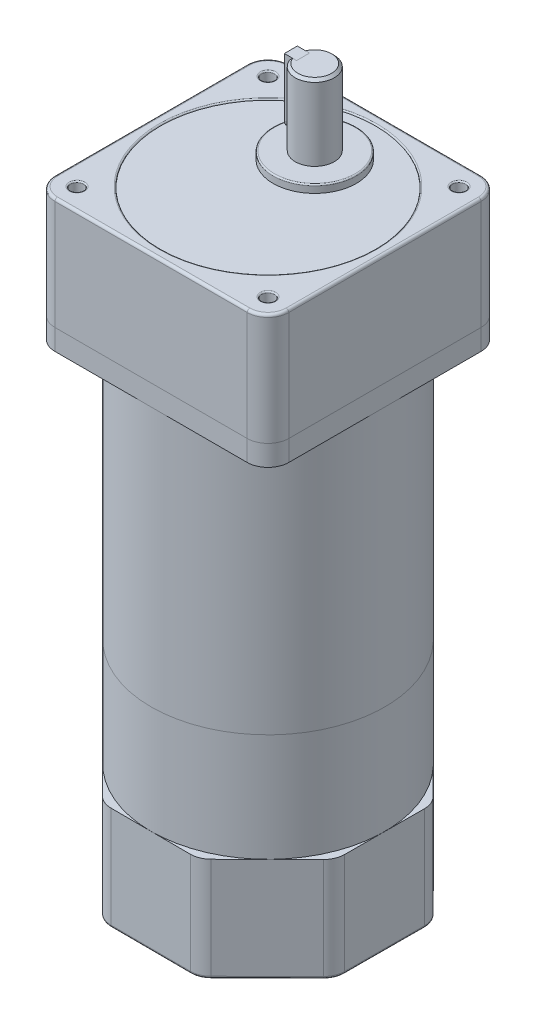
ISO-10303-21;
HEADER;
FILE_DESCRIPTION(('STEP AP214'),'2;1');
FILE_NAME('part.step','',(''),(''),'','','');
FILE_SCHEMA(('AUTOMOTIVE_DESIGN { 1 0 10303 214 1 1 1 1 }'));
ENDSEC;
DATA;
#1=APPLICATION_CONTEXT('core data for automotive mechanical design processes');
#2=APPLICATION_PROTOCOL_DEFINITION('international standard','automotive_design',2000,#1);
#3=PRODUCT_CONTEXT('',#1,'mechanical');
#4=PRODUCT('Part','Part','',(#3));
#5=PRODUCT_RELATED_PRODUCT_CATEGORY('part','',(#4));
#6=PRODUCT_DEFINITION_FORMATION('','',#4);
#7=PRODUCT_DEFINITION_CONTEXT('part definition',#1,'design');
#8=PRODUCT_DEFINITION('design','',#6,#7);
#9=PRODUCT_DEFINITION_SHAPE('','',#8);
#10=(LENGTH_UNIT() NAMED_UNIT(*) SI_UNIT(.MILLI.,.METRE.));
#11=(NAMED_UNIT(*) PLANE_ANGLE_UNIT() SI_UNIT($,.RADIAN.));
#12=(NAMED_UNIT(*) SI_UNIT($,.STERADIAN.) SOLID_ANGLE_UNIT());
#13=UNCERTAINTY_MEASURE_WITH_UNIT(LENGTH_MEASURE(1.E-05),#10,'distance_accuracy_value','');
#14=(GEOMETRIC_REPRESENTATION_CONTEXT(3) GLOBAL_UNCERTAINTY_ASSIGNED_CONTEXT((#13)) GLOBAL_UNIT_ASSIGNED_CONTEXT((#10,
#11,#12)) REPRESENTATION_CONTEXT('',''));
#15=CARTESIAN_POINT('',(0.,0.,0.));
#16=DIRECTION('',(0.,0.,1.));
#17=DIRECTION('',(1.,0.,0.));
#18=AXIS2_PLACEMENT_3D('',#15,#16,#17);
#19=CARTESIAN_POINT('',(-9.5,9.5,-18.));
#20=DIRECTION('',(1.,0.,0.));
#21=DIRECTION('',(0.,0.,-1.));
#22=AXIS2_PLACEMENT_3D('',#19,#20,#21);
#23=CYLINDRICAL_SURFACE('',#22,2.5);
#24=DIRECTION('',(1.,0.,0.));
#25=VECTOR('',#24,1.);
#26=CARTESIAN_POINT('',(-9.5,9.5,-15.5));
#27=LINE('',#26,#25);
#28=CARTESIAN_POINT('',(-9.19999999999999,9.5,-15.5));
#29=VERTEX_POINT('',#28);
#30=CARTESIAN_POINT('',(-4.5,9.5,-15.5));
#31=VERTEX_POINT('',#30);
#32=EDGE_CURVE('E101',#29,#31,#27,.T.);
#33=ORIENTED_EDGE('',*,*,#32,.F.);
#34=CARTESIAN_POINT('',(-9.19999999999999,9.5,-18.));
#35=DIRECTION('',(-1.,0.,0.));
#36=DIRECTION('',(0.,0.,1.));
#37=AXIS2_PLACEMENT_3D('',#34,#35,#36);
#38=CIRCLE('',#37,2.5);
#39=CARTESIAN_POINT('',(-9.19999999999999,9.5,-20.5));
#40=VERTEX_POINT('',#39);
#41=EDGE_CURVE('E59',#29,#40,#38,.F.);
#42=ORIENTED_EDGE('',*,*,#41,.T.);
#43=DIRECTION('',(1.,0.,0.));
#44=VECTOR('',#43,1.);
#45=CARTESIAN_POINT('',(-9.5,9.5,-20.5));
#46=LINE('',#45,#44);
#47=CARTESIAN_POINT('',(-4.5,9.5,-20.5));
#48=VERTEX_POINT('',#47);
#49=EDGE_CURVE('E118',#40,#48,#46,.T.);
#50=ORIENTED_EDGE('',*,*,#49,.T.);
#51=CARTESIAN_POINT('',(-4.5,9.5,-18.));
#52=DIRECTION('',(-1.,0.,0.));
#53=DIRECTION('',(0.,0.,1.));
#54=AXIS2_PLACEMENT_3D('',#51,#52,#53);
#55=CIRCLE('',#54,2.5);
#56=EDGE_CURVE('E114',#48,#31,#55,.T.);
#57=ORIENTED_EDGE('',*,*,#56,.T.);
#58=EDGE_LOOP('',(#33,#42,#50,#57));
#59=FACE_BOUND('',#58,.T.);
#60=ADVANCED_FACE('F50',(#59),#23,.T.);
#61=CARTESIAN_POINT('',(-9.5,32.,-15.5));
#62=DIRECTION('',(0.,0.,-1.));
#63=DIRECTION('',(-1.,0.,0.));
#64=AXIS2_PLACEMENT_3D('',#61,#62,#63);
#65=PLANE('',#64);
#66=DIRECTION('',(1.,0.,0.));
#67=VECTOR('',#66,1.);
#68=CARTESIAN_POINT('',(-9.5,32.,-15.5));
#69=LINE('',#68,#67);
#70=CARTESIAN_POINT('',(-9.19999999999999,32.,-15.5));
#71=VERTEX_POINT('',#70);
#72=CARTESIAN_POINT('',(-4.5,32.,-15.5));
#73=VERTEX_POINT('',#72);
#74=EDGE_CURVE('E108',#71,#73,#69,.T.);
#75=ORIENTED_EDGE('',*,*,#74,.F.);
#76=DIRECTION('',(0.,-1.,0.));
#77=VECTOR('',#76,1.);
#78=CARTESIAN_POINT('',(-9.19999999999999,9.5,-15.5));
#79=LINE('',#78,#77);
#80=EDGE_CURVE('E12',#71,#29,#79,.T.);
#81=ORIENTED_EDGE('',*,*,#80,.T.);
#82=ORIENTED_EDGE('',*,*,#32,.T.);
#83=DIRECTION('',(0.,1.,0.));
#84=VECTOR('',#83,1.);
#85=CARTESIAN_POINT('',(-4.5,32.,-15.5));
#86=LINE('',#85,#84);
#87=EDGE_CURVE('E104',#31,#73,#86,.T.);
#88=ORIENTED_EDGE('',*,*,#87,.T.);
#89=EDGE_LOOP('',(#75,#81,#82,#88));
#90=FACE_BOUND('',#89,.T.);
#91=ADVANCED_FACE('F103',(#90),#65,.F.);
#92=CARTESIAN_POINT('',(-9.5,32.,-20.5));
#93=DIRECTION('',(0.,-1.,0.));
#94=DIRECTION('',(0.,0.,-1.));
#95=AXIS2_PLACEMENT_3D('',#92,#93,#94);
#96=PLANE('',#95);
#97=DIRECTION('',(1.,0.,0.));
#98=VECTOR('',#97,1.);
#99=CARTESIAN_POINT('',(-9.5,32.,-20.5));
#100=LINE('',#99,#98);
#101=CARTESIAN_POINT('',(-9.19999999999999,32.,-20.5));
#102=VERTEX_POINT('',#101);
#103=CARTESIAN_POINT('',(-4.5,32.,-20.5));
#104=VERTEX_POINT('',#103);
#105=EDGE_CURVE('E128',#102,#104,#100,.T.);
#106=ORIENTED_EDGE('',*,*,#105,.F.);
#107=DIRECTION('',(0.,0.,1.));
#108=VECTOR('',#107,1.);
#109=CARTESIAN_POINT('',(-9.19999999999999,32.,-15.5));
#110=LINE('',#109,#108);
#111=EDGE_CURVE('E139',#102,#71,#110,.T.);
#112=ORIENTED_EDGE('',*,*,#111,.T.);
#113=ORIENTED_EDGE('',*,*,#74,.T.);
#114=DIRECTION('',(0.,0.,-1.));
#115=VECTOR('',#114,1.);
#116=CARTESIAN_POINT('',(-4.5,32.,-20.5));
#117=LINE('',#116,#115);
#118=EDGE_CURVE('E116',#73,#104,#117,.T.);
#119=ORIENTED_EDGE('',*,*,#118,.T.);
#120=EDGE_LOOP('',(#106,#112,#113,#119));
#121=FACE_BOUND('',#120,.T.);
#122=ADVANCED_FACE('F168',(#121),#96,.F.);
#123=CARTESIAN_POINT('',(-9.5,9.5,-20.5));
#124=DIRECTION('',(0.,0.,1.));
#125=DIRECTION('',(1.,0.,0.));
#126=AXIS2_PLACEMENT_3D('',#123,#124,#125);
#127=PLANE('',#126);
#128=ORIENTED_EDGE('',*,*,#49,.F.);
#129=DIRECTION('',(0.,1.,0.));
#130=VECTOR('',#129,1.);
#131=CARTESIAN_POINT('',(-9.19999999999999,32.,-20.5));
#132=LINE('',#131,#130);
#133=EDGE_CURVE('E142',#40,#102,#132,.T.);
#134=ORIENTED_EDGE('',*,*,#133,.T.);
#135=ORIENTED_EDGE('',*,*,#105,.T.);
#136=DIRECTION('',(0.,-1.,0.));
#137=VECTOR('',#136,1.);
#138=CARTESIAN_POINT('',(-4.5,9.5,-20.5));
#139=LINE('',#138,#137);
#140=EDGE_CURVE('E125',#104,#48,#139,.T.);
#141=ORIENTED_EDGE('',*,*,#140,.T.);
#142=EDGE_LOOP('',(#128,#134,#135,#141));
#143=FACE_BOUND('',#142,.T.);
#144=ADVANCED_FACE('F170',(#143),#127,.F.);
#145=CARTESIAN_POINT('',(-9.5,9.5,-18.));
#146=DIRECTION('',(-1.,0.,0.));
#147=DIRECTION('',(0.,0.,1.));
#148=AXIS2_PLACEMENT_3D('',#145,#146,#147);
#149=PLANE('',#148);
#150=DIRECTION('',(0.,1.,0.));
#151=VECTOR('',#150,1.);
#152=CARTESIAN_POINT('',(-9.5,32.,-15.8));
#153=LINE('',#152,#151);
#154=CARTESIAN_POINT('',(-9.5,9.5,-15.8));
#155=VERTEX_POINT('',#154);
#156=CARTESIAN_POINT('',(-9.5,31.7,-15.8));
#157=VERTEX_POINT('',#156);
#158=EDGE_CURVE('E107',#155,#157,#153,.T.);
#159=ORIENTED_EDGE('',*,*,#158,.T.);
#160=DIRECTION('',(0.,0.,-1.));
#161=VECTOR('',#160,1.);
#162=CARTESIAN_POINT('',(-9.5,31.7,-20.5));
#163=LINE('',#162,#161);
#164=CARTESIAN_POINT('',(-9.5,31.7,-20.2));
#165=VERTEX_POINT('',#164);
#166=EDGE_CURVE('E136',#157,#165,#163,.T.);
#167=ORIENTED_EDGE('',*,*,#166,.T.);
#168=DIRECTION('',(0.,-1.,0.));
#169=VECTOR('',#168,1.);
#170=CARTESIAN_POINT('',(-9.5,9.5,-20.2));
#171=LINE('',#170,#169);
#172=CARTESIAN_POINT('',(-9.5,9.5,-20.2));
#173=VERTEX_POINT('',#172);
#174=EDGE_CURVE('E134',#165,#173,#171,.T.);
#175=ORIENTED_EDGE('',*,*,#174,.T.);
#176=CARTESIAN_POINT('',(-9.5,9.5,-18.));
#177=DIRECTION('',(-1.,0.,0.));
#178=DIRECTION('',(0.,0.,1.));
#179=AXIS2_PLACEMENT_3D('',#176,#177,#178);
#180=CIRCLE('',#179,2.19999999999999);
#181=EDGE_CURVE('E132',#173,#155,#180,.T.);
#182=ORIENTED_EDGE('',*,*,#181,.T.);
#183=EDGE_LOOP('',(#159,#167,#175,#182));
#184=FACE_BOUND('',#183,.T.);
#185=ADVANCED_FACE('F160',(#184),#149,.T.);
#186=CARTESIAN_POINT('',(-4.5,9.5,-18.));
#187=DIRECTION('',(-1.,0.,0.));
#188=DIRECTION('',(0.,0.,1.));
#189=AXIS2_PLACEMENT_3D('',#186,#187,#188);
#190=PLANE('',#189);
#191=ORIENTED_EDGE('',*,*,#56,.F.);
#192=ORIENTED_EDGE('',*,*,#140,.F.);
#193=ORIENTED_EDGE('',*,*,#118,.F.);
#194=ORIENTED_EDGE('',*,*,#87,.F.);
#195=EDGE_LOOP('',(#191,#192,#193,#194));
#196=FACE_BOUND('',#195,.T.);
#197=ADVANCED_FACE('F112',(#196),#190,.F.);
#198=CARTESIAN_POINT('',(-9.5,9.5,-18.));
#199=DIRECTION('',(1.,0.,0.));
#200=DIRECTION('',(0.,0.,-1.));
#201=AXIS2_PLACEMENT_3D('',#198,#199,#200);
#202=CONICAL_SURFACE('',#201,2.19999999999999,0.785398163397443);
#203=DIRECTION('',(-0.707106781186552,0.,0.707106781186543));
#204=VECTOR('',#203,1.);
#205=CARTESIAN_POINT('',(-9.19999999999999,9.5,-20.5));
#206=LINE('',#205,#204);
#207=EDGE_CURVE('E122',#40,#173,#206,.T.);
#208=ORIENTED_EDGE('',*,*,#207,.F.);
#209=ORIENTED_EDGE('',*,*,#41,.F.);
#210=DIRECTION('',(0.707106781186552,0.,0.707106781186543));
#211=VECTOR('',#210,1.);
#212=CARTESIAN_POINT('',(-9.5,9.5,-15.8));
#213=LINE('',#212,#211);
#214=EDGE_CURVE('E54',#155,#29,#213,.T.);
#215=ORIENTED_EDGE('',*,*,#214,.F.);
#216=ORIENTED_EDGE('',*,*,#181,.F.);
#217=EDGE_LOOP('',(#208,#209,#215,#216));
#218=FACE_BOUND('',#217,.T.);
#219=ADVANCED_FACE('F52',(#218),#202,.T.);
#220=CARTESIAN_POINT('',(-9.5,9.5,-15.8));
#221=DIRECTION('',(-0.707106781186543,0.,0.707106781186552));
#222=DIRECTION('',(0.,-1.,0.));
#223=AXIS2_PLACEMENT_3D('',#220,#221,#222);
#224=PLANE('',#223);
#225=ORIENTED_EDGE('',*,*,#214,.T.);
#226=ORIENTED_EDGE('',*,*,#80,.F.);
#227=DIRECTION('',(-0.577350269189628,-0.577350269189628,-0.577350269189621));
#228=VECTOR('',#227,1.);
#229=CARTESIAN_POINT('',(-16.9000000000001,24.2999999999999,-23.2));
#230=LINE('',#229,#228);
#231=EDGE_CURVE('E147',#157,#71,#230,.F.);
#232=ORIENTED_EDGE('',*,*,#231,.F.);
#233=ORIENTED_EDGE('',*,*,#158,.F.);
#234=EDGE_LOOP('',(#225,#226,#232,#233));
#235=FACE_BOUND('',#234,.T.);
#236=ADVANCED_FACE('F190',(#235),#224,.T.);
#237=CARTESIAN_POINT('',(-9.5,9.5,-20.2));
#238=DIRECTION('',(-0.707106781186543,0.,-0.707106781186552));
#239=DIRECTION('',(0.,1.,0.));
#240=AXIS2_PLACEMENT_3D('',#237,#238,#239);
#241=PLANE('',#240);
#242=ORIENTED_EDGE('',*,*,#207,.T.);
#243=ORIENTED_EDGE('',*,*,#174,.F.);
#244=DIRECTION('',(0.577350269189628,0.577350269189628,-0.577350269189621));
#245=VECTOR('',#244,1.);
#246=CARTESIAN_POINT('',(-16.9000000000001,24.2999999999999,-12.8));
#247=LINE('',#246,#245);
#248=EDGE_CURVE('E145',#102,#165,#247,.F.);
#249=ORIENTED_EDGE('',*,*,#248,.F.);
#250=ORIENTED_EDGE('',*,*,#133,.F.);
#251=EDGE_LOOP('',(#242,#243,#249,#250));
#252=FACE_BOUND('',#251,.T.);
#253=ADVANCED_FACE('F153',(#252),#241,.T.);
#254=CARTESIAN_POINT('',(-9.5,31.7,-18.));
#255=DIRECTION('',(-0.707106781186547,0.707106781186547,0.));
#256=DIRECTION('',(0.,0.,1.));
#257=AXIS2_PLACEMENT_3D('',#254,#255,#256);
#258=PLANE('',#257);
#259=ORIENTED_EDGE('',*,*,#231,.T.);
#260=ORIENTED_EDGE('',*,*,#111,.F.);
#261=ORIENTED_EDGE('',*,*,#248,.T.);
#262=ORIENTED_EDGE('',*,*,#166,.F.);
#263=EDGE_LOOP('',(#259,#260,#261,#262));
#264=FACE_BOUND('',#263,.T.);
#265=ADVANCED_FACE('F164',(#264),#258,.T.);
#266=CLOSED_SHELL('',(#60,#91,#122,#144,#185,#197,#219,#236,#253,#265));
#267=MANIFOLD_SOLID_BREP('B2',#266);
#268=CARTESIAN_POINT('',(0.,32.,-18.));
#269=DIRECTION('',(0.,-1.,0.));
#270=DIRECTION('',(0.,0.,-1.));
#271=AXIS2_PLACEMENT_3D('',#268,#269,#270);
#272=CYLINDRICAL_SURFACE('',#271,7.5);
#273=CARTESIAN_POINT('',(0.,3.,-18.));
#274=DIRECTION('',(0.,1.,0.));
#275=DIRECTION('',(0.,0.,1.));
#276=AXIS2_PLACEMENT_3D('',#273,#274,#275);
#277=CIRCLE('',#276,7.5);
#278=CARTESIAN_POINT('',(0.,3.,-10.5));
#279=VERTEX_POINT('',#278);
#280=EDGE_CURVE('E342',#279,#279,#277,.T.);
#281=ORIENTED_EDGE('',*,*,#280,.T.);
#282=EDGE_LOOP('',(#281));
#283=FACE_BOUND('',#282,.T.);
#284=DIRECTION('',(0.,-1.,0.));
#285=VECTOR('',#284,1.);
#286=CARTESIAN_POINT('',(-7.07106781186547,32.,-20.5));
#287=LINE('',#286,#285);
#288=CARTESIAN_POINT('',(-7.07106781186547,31.,-20.5));
#289=VERTEX_POINT('',#288);
#290=CARTESIAN_POINT('',(-7.07106781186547,9.5,-20.5));
#291=VERTEX_POINT('',#290);
#292=EDGE_CURVE('E331',#289,#291,#287,.T.);
#293=ORIENTED_EDGE('',*,*,#292,.F.);
#294=CARTESIAN_POINT('',(0.,31.,-18.));
#295=DIRECTION('',(0.,1.,0.));
#296=DIRECTION('',(0.,0.,1.));
#297=AXIS2_PLACEMENT_3D('',#294,#295,#296);
#298=CIRCLE('',#297,7.5);
#299=CARTESIAN_POINT('',(-7.07106781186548,31.,-15.5));
#300=VERTEX_POINT('',#299);
#301=EDGE_CURVE('E275',#289,#300,#298,.F.);
#302=ORIENTED_EDGE('',*,*,#301,.T.);
#303=DIRECTION('',(0.,-1.,0.));
#304=VECTOR('',#303,1.);
#305=CARTESIAN_POINT('',(-7.07106781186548,32.,-15.5));
#306=LINE('',#305,#304);
#307=CARTESIAN_POINT('',(-7.07106781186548,9.5,-15.5));
#308=VERTEX_POINT('',#307);
#309=EDGE_CURVE('E333',#308,#300,#306,.F.);
#310=ORIENTED_EDGE('',*,*,#309,.F.);
#311=CARTESIAN_POINT('',(-7.07106781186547,9.5,-20.5));
#312=CARTESIAN_POINT('',(-7.07105693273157,9.43179292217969,-20.5000089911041));
#313=CARTESIAN_POINT('',(-7.07205443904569,9.36359192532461,-20.4972088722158));
#314=CARTESIAN_POINT('',(-7.07598524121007,9.22771896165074,-20.4860604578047));
#315=CARTESIAN_POINT('',(-7.07891801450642,9.16004685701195,-20.477713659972));
#316=CARTESIAN_POINT('',(-7.08662705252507,9.02590951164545,-20.455574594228));
#317=CARTESIAN_POINT('',(-7.09139784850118,8.95944129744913,-20.4417984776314));
#318=CARTESIAN_POINT('',(-7.10262619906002,8.8279917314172,-20.4089418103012));
#319=CARTESIAN_POINT('',(-7.10908381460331,8.7630104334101,-20.3898610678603));
#320=CARTESIAN_POINT('',(-7.13069940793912,8.57103842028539,-20.324915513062));
#321=CARTESIAN_POINT('',(-7.14811243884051,8.44682084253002,-20.2713141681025));
#322=CARTESIAN_POINT('',(-7.1869703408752,8.20912318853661,-20.1451778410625));
#323=CARTESIAN_POINT('',(-7.20841768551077,8.09564976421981,-20.0726312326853));
#324=CARTESIAN_POINT('',(-7.25386182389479,7.87820709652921,-19.9076299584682));
#325=CARTESIAN_POINT('',(-7.27792189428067,7.7747148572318,-19.8145628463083));
#326=CARTESIAN_POINT('',(-7.32534626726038,7.58448289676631,-19.6124707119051));
#327=CARTESIAN_POINT('',(-7.34871044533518,7.49774615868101,-19.5034428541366));
#328=CARTESIAN_POINT('',(-7.39284706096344,7.34130177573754,-19.2690092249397));
#329=CARTESIAN_POINT('',(-7.41353593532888,7.27209769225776,-19.1432502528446));
#330=CARTESIAN_POINT('',(-7.44924021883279,7.1560192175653,-18.8810730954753));
#331=CARTESIAN_POINT('',(-7.46425736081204,7.10913800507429,-18.7446581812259));
#332=CARTESIAN_POINT('',(-7.48647677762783,7.04066072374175,-18.4700733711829));
#333=CARTESIAN_POINT('',(-7.49393272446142,7.01824182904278,-18.3321295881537));
#334=CARTESIAN_POINT('',(-7.50109021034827,6.99670924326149,-18.0542474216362));
#335=CARTESIAN_POINT('',(-7.50079359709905,6.99758999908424,-17.9143095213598));
#336=CARTESIAN_POINT('',(-7.49265096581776,7.0221107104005,-17.6422403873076));
#337=CARTESIAN_POINT('',(-7.48510152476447,7.04485659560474,-17.5100182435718));
#338=CARTESIAN_POINT('',(-7.46367401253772,7.1109829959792,-17.2513898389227));
#339=CARTESIAN_POINT('',(-7.44979559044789,7.15436465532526,-17.1249839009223));
#340=CARTESIAN_POINT('',(-7.41689170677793,7.26105342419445,-16.8796184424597));
#341=CARTESIAN_POINT('',(-7.39780094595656,7.32461511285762,-16.760778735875));
#342=CARTESIAN_POINT('',(-7.35645969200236,7.46964987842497,-16.5351885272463));
#343=CARTESIAN_POINT('',(-7.33420833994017,7.55112782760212,-16.4284413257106));
#344=CARTESIAN_POINT('',(-7.28765679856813,7.73417762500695,-16.2247566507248));
#345=CARTESIAN_POINT('',(-7.26330946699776,7.83651385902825,-16.128515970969));
#346=CARTESIAN_POINT('',(-7.21618726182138,8.05610372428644,-15.9543199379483));
#347=CARTESIAN_POINT('',(-7.19341289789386,8.17336215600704,-15.8763704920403));
#348=CARTESIAN_POINT('',(-7.15175078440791,8.4217004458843,-15.7399916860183));
#349=CARTESIAN_POINT('',(-7.13292537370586,8.55295878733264,-15.6818674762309));
#350=CARTESIAN_POINT('',(-7.10202742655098,8.8241174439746,-15.5888494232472));
#351=CARTESIAN_POINT('',(-7.08994423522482,8.96400373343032,-15.5539189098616));
#352=CARTESIAN_POINT('',(-7.078413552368,9.17104659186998,-15.5208546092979));
#353=CARTESIAN_POINT('',(-7.07566669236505,9.23660347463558,-15.5130373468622));
#354=CARTESIAN_POINT('',(-7.07199258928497,9.36809519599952,-15.502613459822));
#355=CARTESIAN_POINT('',(-7.0710629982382,9.43402943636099,-15.5000001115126));
#356=CARTESIAN_POINT('',(-7.07106781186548,9.5,-15.5));
#357=B_SPLINE_CURVE_WITH_KNOTS('',3,(#311,#312,#313,#314,#315,#316,#317,#318,#319,#320,#321,
#322,#323,#324,#325,#326,#327,#328,#329,#330,#331,#332,#333,#334,#335,#336,#337,#338,#339,#340,
#341,#342,#343,#344,#345,#346,#347,#348,#349,#350,#351,#352,#353,#354,#355,#356),.UNSPECIFIED.,
.F.,.F.,(4,2,2,2,2,2,2,2,2,2,2,2,2,2,2,2,2,2,2,2,2,2,4),(0.,0.204546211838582,0.409037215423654,
0.612924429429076,0.81681901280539,1.22401016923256,1.63145179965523,2.0532786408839,
2.47518051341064,2.90809434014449,3.34087579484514,3.75860278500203,4.17623021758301,
4.57747647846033,4.97874498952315,5.38529148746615,5.79194868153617,6.21771736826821,
6.64362337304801,7.07581676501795,7.50732520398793,7.70536340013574,7.90314555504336),.UNSPECIFIED.);
#358=EDGE_CURVE('E345',#291,#308,#357,.T.);
#359=ORIENTED_EDGE('',*,*,#358,.F.);
#360=EDGE_LOOP('',(#293,#302,#310,#359));
#361=FACE_BOUND('',#360,.T.);
#362=ADVANCED_FACE('F262',(#283,#361),#272,.T.);
#363=CARTESIAN_POINT('',(0.,32.,-18.));
#364=DIRECTION('',(0.,1.,0.));
#365=DIRECTION('',(0.,0.,1.));
#366=AXIS2_PLACEMENT_3D('',#363,#364,#365);
#367=PLANE('',#366);
#368=DIRECTION('',(-1.,0.,0.));
#369=VECTOR('',#368,1.);
#370=CARTESIAN_POINT('',(-4.5,32.,-15.5));
#371=LINE('',#370,#369);
#372=CARTESIAN_POINT('',(-4.5,32.,-15.5));
#373=VERTEX_POINT('',#372);
#374=CARTESIAN_POINT('',(-6.00000000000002,32.,-15.5));
#375=VERTEX_POINT('',#374);
#376=EDGE_CURVE('E337',#373,#375,#371,.T.);
#377=ORIENTED_EDGE('',*,*,#376,.T.);
#378=CARTESIAN_POINT('',(0.,32.,-18.));
#379=DIRECTION('',(0.,1.,0.));
#380=DIRECTION('',(0.,0.,1.));
#381=AXIS2_PLACEMENT_3D('',#378,#379,#380);
#382=CIRCLE('',#381,6.50000000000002);
#383=CARTESIAN_POINT('',(-6.00000000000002,32.,-20.5));
#384=VERTEX_POINT('',#383);
#385=EDGE_CURVE('E351',#375,#384,#382,.T.);
#386=ORIENTED_EDGE('',*,*,#385,.T.);
#387=DIRECTION('',(-1.,0.,0.));
#388=VECTOR('',#387,1.);
#389=CARTESIAN_POINT('',(-4.5,32.,-20.5));
#390=LINE('',#389,#388);
#391=CARTESIAN_POINT('',(-4.5,32.,-20.5));
#392=VERTEX_POINT('',#391);
#393=EDGE_CURVE('E334',#392,#384,#390,.T.);
#394=ORIENTED_EDGE('',*,*,#393,.F.);
#395=DIRECTION('',(0.,0.,1.));
#396=VECTOR('',#395,1.);
#397=CARTESIAN_POINT('',(-4.5,32.,-20.5));
#398=LINE('',#397,#396);
#399=EDGE_CURVE('E318',#392,#373,#398,.T.);
#400=ORIENTED_EDGE('',*,*,#399,.T.);
#401=EDGE_LOOP('',(#377,#386,#394,#400));
#402=FACE_BOUND('',#401,.T.);
#403=ADVANCED_FACE('F361',(#402),#367,.T.);
#404=CARTESIAN_POINT('',(0.,3.,-18.));
#405=DIRECTION('',(0.,1.,0.));
#406=DIRECTION('',(0.,0.,1.));
#407=AXIS2_PLACEMENT_3D('',#404,#405,#406);
#408=PLANE('',#407);
#409=ORIENTED_EDGE('',*,*,#280,.F.);
#410=EDGE_LOOP('',(#409));
#411=FACE_BOUND('',#410,.T.);
#412=ADVANCED_FACE('F359',(#411),#408,.F.);
#413=CARTESIAN_POINT('',(-4.5,9.5,-18.));
#414=DIRECTION('',(-1.,0.,0.));
#415=DIRECTION('',(0.,0.,1.));
#416=AXIS2_PLACEMENT_3D('',#413,#414,#415);
#417=CYLINDRICAL_SURFACE('',#416,2.5);
#418=DIRECTION('',(-1.,0.,0.));
#419=VECTOR('',#418,1.);
#420=CARTESIAN_POINT('',(-4.5,9.5,-20.5));
#421=LINE('',#420,#419);
#422=CARTESIAN_POINT('',(-4.5,9.5,-20.5));
#423=VERTEX_POINT('',#422);
#424=EDGE_CURVE('E326',#423,#291,#421,.T.);
#425=ORIENTED_EDGE('',*,*,#424,.T.);
#426=ORIENTED_EDGE('',*,*,#358,.T.);
#427=DIRECTION('',(-1.,0.,0.));
#428=VECTOR('',#427,1.);
#429=CARTESIAN_POINT('',(-4.5,9.5,-15.5));
#430=LINE('',#429,#428);
#431=CARTESIAN_POINT('',(-4.5,9.5,-15.5));
#432=VERTEX_POINT('',#431);
#433=EDGE_CURVE('E328',#432,#308,#430,.T.);
#434=ORIENTED_EDGE('',*,*,#433,.F.);
#435=CARTESIAN_POINT('',(-4.5,9.5,-18.));
#436=DIRECTION('',(1.,0.,0.));
#437=DIRECTION('',(0.,0.,-1.));
#438=AXIS2_PLACEMENT_3D('',#435,#436,#437);
#439=CIRCLE('',#438,2.5);
#440=EDGE_CURVE('E316',#432,#423,#439,.T.);
#441=ORIENTED_EDGE('',*,*,#440,.T.);
#442=EDGE_LOOP('',(#425,#426,#434,#441));
#443=FACE_BOUND('',#442,.T.);
#444=ADVANCED_FACE('F325',(#443),#417,.F.);
#445=CARTESIAN_POINT('',(-4.5,9.5,-20.5));
#446=DIRECTION('',(0.,0.,1.));
#447=DIRECTION('',(1.,0.,0.));
#448=AXIS2_PLACEMENT_3D('',#445,#446,#447);
#449=PLANE('',#448);
#450=ORIENTED_EDGE('',*,*,#393,.T.);
#451=CARTESIAN_POINT('',(-6.00000000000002,32.,-20.5));
#452=CARTESIAN_POINT('',(-6.0897273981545,31.9171731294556,-20.5));
#453=CARTESIAN_POINT('',(-6.17931930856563,31.8341996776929,-20.5));
#454=CARTESIAN_POINT('',(-6.35825867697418,31.6679908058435,-20.5));
#455=CARTESIAN_POINT('',(-6.44760613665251,31.5847553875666,-20.5));
#456=CARTESIAN_POINT('',(-6.62608424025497,31.4180527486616,-20.5));
#457=CARTESIAN_POINT('',(-6.7152148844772,31.3345855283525,-20.5));
#458=CARTESIAN_POINT('',(-6.89328182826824,31.1674427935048,-20.5));
#459=CARTESIAN_POINT('',(-6.98221812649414,31.0837672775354,-20.5));
#460=CARTESIAN_POINT('',(-7.07106781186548,31.,-20.5));
#461=B_SPLINE_CURVE_WITH_KNOTS('',3,(#451,#452,#453,#454,#455,#456,#457,#458,#459,#460),
.UNSPECIFIED.,.F.,.F.,(4,2,2,2,4),(0.,0.366335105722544,0.732667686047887,1.09899976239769,
1.46533436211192),.UNSPECIFIED.);
#462=EDGE_CURVE('E289',#384,#289,#461,.T.);
#463=ORIENTED_EDGE('',*,*,#462,.T.);
#464=ORIENTED_EDGE('',*,*,#292,.T.);
#465=ORIENTED_EDGE('',*,*,#424,.F.);
#466=DIRECTION('',(0.,1.,0.));
#467=VECTOR('',#466,1.);
#468=CARTESIAN_POINT('',(-4.5,9.5,-20.5));
#469=LINE('',#468,#467);
#470=EDGE_CURVE('E313',#423,#392,#469,.T.);
#471=ORIENTED_EDGE('',*,*,#470,.T.);
#472=EDGE_LOOP('',(#450,#463,#464,#465,#471));
#473=FACE_BOUND('',#472,.T.);
#474=ADVANCED_FACE('F330',(#473),#449,.T.);
#475=CARTESIAN_POINT('',(-4.5,32.,-15.5));
#476=DIRECTION('',(0.,0.,-1.));
#477=DIRECTION('',(-1.,0.,0.));
#478=AXIS2_PLACEMENT_3D('',#475,#476,#477);
#479=PLANE('',#478);
#480=ORIENTED_EDGE('',*,*,#309,.T.);
#481=CARTESIAN_POINT('',(-7.07106781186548,31.,-15.5));
#482=CARTESIAN_POINT('',(-6.98221812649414,31.0837672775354,-15.5));
#483=CARTESIAN_POINT('',(-6.89328182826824,31.1674427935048,-15.5));
#484=CARTESIAN_POINT('',(-6.7152148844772,31.3345855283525,-15.5));
#485=CARTESIAN_POINT('',(-6.62608424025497,31.4180527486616,-15.5));
#486=CARTESIAN_POINT('',(-6.44760613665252,31.5847553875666,-15.5));
#487=CARTESIAN_POINT('',(-6.35825867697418,31.6679908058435,-15.5));
#488=CARTESIAN_POINT('',(-6.17931930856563,31.8341996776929,-15.5));
#489=CARTESIAN_POINT('',(-6.0897273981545,31.9171731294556,-15.5));
#490=CARTESIAN_POINT('',(-6.00000000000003,32.,-15.5));
#491=B_SPLINE_CURVE_WITH_KNOTS('',3,(#481,#482,#483,#484,#485,#486,#487,#488,#489,#490),
.UNSPECIFIED.,.F.,.F.,(4,2,2,2,4),(0.,0.36633459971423,0.732666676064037,1.09899925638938,
1.46533436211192),.UNSPECIFIED.);
#492=EDGE_CURVE('E48',#300,#375,#491,.T.);
#493=ORIENTED_EDGE('',*,*,#492,.T.);
#494=ORIENTED_EDGE('',*,*,#376,.F.);
#495=DIRECTION('',(0.,-1.,0.));
#496=VECTOR('',#495,1.);
#497=CARTESIAN_POINT('',(-4.5,32.,-15.5));
#498=LINE('',#497,#496);
#499=EDGE_CURVE('E383',#373,#432,#498,.T.);
#500=ORIENTED_EDGE('',*,*,#499,.T.);
#501=ORIENTED_EDGE('',*,*,#433,.T.);
#502=EDGE_LOOP('',(#480,#493,#494,#500,#501));
#503=FACE_BOUND('',#502,.T.);
#504=ADVANCED_FACE('F387',(#503),#479,.T.);
#505=CARTESIAN_POINT('',(-4.5,9.5,-18.));
#506=DIRECTION('',(1.,0.,0.));
#507=DIRECTION('',(0.,0.,-1.));
#508=AXIS2_PLACEMENT_3D('',#505,#506,#507);
#509=PLANE('',#508);
#510=ORIENTED_EDGE('',*,*,#440,.F.);
#511=ORIENTED_EDGE('',*,*,#499,.F.);
#512=ORIENTED_EDGE('',*,*,#399,.F.);
#513=ORIENTED_EDGE('',*,*,#470,.F.);
#514=EDGE_LOOP('',(#510,#511,#512,#513));
#515=FACE_BOUND('',#514,.T.);
#516=ADVANCED_FACE('F315',(#515),#509,.F.);
#517=CARTESIAN_POINT('',(0.,32.,-18.));
#518=DIRECTION('',(0.,-1.,0.));
#519=DIRECTION('',(0.,0.,-1.));
#520=AXIS2_PLACEMENT_3D('',#517,#518,#519);
#521=CONICAL_SURFACE('',#520,6.50000000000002,0.785398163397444);
#522=ORIENTED_EDGE('',*,*,#492,.F.);
#523=ORIENTED_EDGE('',*,*,#301,.F.);
#524=ORIENTED_EDGE('',*,*,#462,.F.);
#525=ORIENTED_EDGE('',*,*,#385,.F.);
#526=EDGE_LOOP('',(#522,#523,#524,#525));
#527=FACE_BOUND('',#526,.T.);
#528=ADVANCED_FACE('F264',(#527),#521,.T.);
#529=CLOSED_SHELL('',(#362,#403,#412,#444,#474,#504,#516,#528));
#530=MANIFOLD_SOLID_BREP('B6',#529);
#531=CARTESIAN_POINT('',(0.,3.,-18.));
#532=DIRECTION('',(0.,-1.,0.));
#533=DIRECTION('',(0.,0.,-1.));
#534=AXIS2_PLACEMENT_3D('',#531,#532,#533);
#535=CYLINDRICAL_SURFACE('',#534,16.);
#536=CARTESIAN_POINT('',(0.,2.5,-18.));
#537=DIRECTION('',(0.,1.,0.));
#538=DIRECTION('',(0.,0.,1.));
#539=AXIS2_PLACEMENT_3D('',#536,#537,#538);
#540=CIRCLE('',#539,16.);
#541=CARTESIAN_POINT('',(0.,2.5,-2.));
#542=VERTEX_POINT('',#541);
#543=EDGE_CURVE('E261',#542,#542,#540,.F.);
#544=ORIENTED_EDGE('',*,*,#543,.T.);
#545=EDGE_LOOP('',(#544));
#546=FACE_BOUND('',#545,.T.);
#547=CARTESIAN_POINT('',(0.,0.,-18.));
#548=DIRECTION('',(0.,1.,0.));
#549=DIRECTION('',(0.,0.,1.));
#550=AXIS2_PLACEMENT_3D('',#547,#548,#549);
#551=CIRCLE('',#550,16.);
#552=CARTESIAN_POINT('',(0.,0.,-2.));
#553=VERTEX_POINT('',#552);
#554=EDGE_CURVE('E463',#553,#553,#551,.T.);
#555=ORIENTED_EDGE('',*,*,#554,.T.);
#556=EDGE_LOOP('',(#555));
#557=FACE_BOUND('',#556,.T.);
#558=ADVANCED_FACE('F452',(#546,#557),#535,.T.);
#559=CARTESIAN_POINT('',(0.,3.,-18.));
#560=DIRECTION('',(0.,1.,0.));
#561=DIRECTION('',(0.,0.,1.));
#562=AXIS2_PLACEMENT_3D('',#559,#560,#561);
#563=PLANE('',#562);
#564=CARTESIAN_POINT('',(0.,3.,-18.));
#565=DIRECTION('',(0.,1.,0.));
#566=DIRECTION('',(0.,0.,1.));
#567=AXIS2_PLACEMENT_3D('',#564,#565,#566);
#568=CIRCLE('',#567,15.5);
#569=CARTESIAN_POINT('',(0.,3.,-2.5));
#570=VERTEX_POINT('',#569);
#571=EDGE_CURVE('E459',#570,#570,#568,.T.);
#572=ORIENTED_EDGE('',*,*,#571,.T.);
#573=EDGE_LOOP('',(#572));
#574=FACE_BOUND('',#573,.T.);
#575=ADVANCED_FACE('F473',(#574),#563,.T.);
#576=CARTESIAN_POINT('',(0.,0.,-18.));
#577=DIRECTION('',(0.,1.,0.));
#578=DIRECTION('',(0.,0.,1.));
#579=AXIS2_PLACEMENT_3D('',#576,#577,#578);
#580=PLANE('',#579);
#581=ORIENTED_EDGE('',*,*,#554,.F.);
#582=EDGE_LOOP('',(#581));
#583=FACE_BOUND('',#582,.T.);
#584=ADVANCED_FACE('F471',(#583),#580,.F.);
#585=CARTESIAN_POINT('',(0.,2.5,-18.));
#586=DIRECTION('',(0.,1.,0.));
#587=DIRECTION('',(0.,0.,1.));
#588=AXIS2_PLACEMENT_3D('',#585,#586,#587);
#589=TOROIDAL_SURFACE('',#588,15.5,0.5);
#590=ORIENTED_EDGE('',*,*,#543,.F.);
#591=EDGE_LOOP('',(#590));
#592=FACE_BOUND('',#591,.T.);
#593=ORIENTED_EDGE('',*,*,#571,.F.);
#594=EDGE_LOOP('',(#593));
#595=FACE_BOUND('',#594,.T.);
#596=ADVANCED_FACE('F454',(#592,#595),#589,.T.);
#597=CLOSED_SHELL('',(#558,#575,#584,#596));
#598=MANIFOLD_SOLID_BREP('B42',#597);
#599=CARTESIAN_POINT('',(36.9458082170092,-232.5,15.4560836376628));
#600=DIRECTION('',(0.,1.,0.));
#601=DIRECTION('',(0.,0.,1.));
#602=AXIS2_PLACEMENT_3D('',#599,#600,#601);
#603=CYLINDRICAL_SURFACE('',#602,8.);
#604=DIRECTION('',(0.,1.,0.));
#605=VECTOR('',#604,1.);
#606=CARTESIAN_POINT('',(42.5827096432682,-232.5,21.1328205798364));
#607=LINE('',#606,#605);
#608=CARTESIAN_POINT('',(42.5827096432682,-231.5,21.1328205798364));
#609=VERTEX_POINT('',#608);
#610=CARTESIAN_POINT('',(42.5827096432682,-192.5,21.1328205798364));
#611=VERTEX_POINT('',#610);
#612=EDGE_CURVE('E676',#609,#611,#607,.T.);
#613=ORIENTED_EDGE('',*,*,#612,.F.);
#614=CARTESIAN_POINT('',(36.9458082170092,-231.5,15.4560836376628));
#615=DIRECTION('',(0.,-1.,0.));
#616=DIRECTION('',(0.,0.,-1.));
#617=AXIS2_PLACEMENT_3D('',#614,#615,#616);
#618=CIRCLE('',#617,8.);
#619=CARTESIAN_POINT('',(44.9457586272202,-231.5,15.484251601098));
#620=VERTEX_POINT('',#619);
#621=EDGE_CURVE('E450',#609,#620,#618,.F.);
#622=ORIENTED_EDGE('',*,*,#621,.T.);
#623=DIRECTION('',(0.,1.,0.));
#624=VECTOR('',#623,1.);
#625=CARTESIAN_POINT('',(44.9457586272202,-232.5,15.484251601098));
#626=LINE('',#625,#624);
#627=CARTESIAN_POINT('',(44.9457586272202,-192.5,15.484251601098));
#628=VERTEX_POINT('',#627);
#629=EDGE_CURVE('E697',#620,#628,#626,.T.);
#630=ORIENTED_EDGE('',*,*,#629,.T.);
#631=CARTESIAN_POINT('',(36.9458082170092,-192.5,15.4560836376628));
#632=DIRECTION('',(0.,-1.,0.));
#633=DIRECTION('',(0.,0.,-1.));
#634=AXIS2_PLACEMENT_3D('',#631,#632,#633);
#635=CIRCLE('',#634,8.);
#636=EDGE_CURVE('E691',#628,#611,#635,.T.);
#637=ORIENTED_EDGE('',*,*,#636,.T.);
#638=EDGE_LOOP('',(#613,#622,#630,#637));
#639=FACE_BOUND('',#638,.T.);
#640=ADVANCED_FACE('F516',(#639),#603,.T.);
#641=CARTESIAN_POINT('',(42.5827096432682,-232.5,21.1328205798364));
#642=DIRECTION('',(-0.704612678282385,0.,-0.709592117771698));
#643=DIRECTION('',(-0.709592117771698,0.,0.704612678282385));
#644=AXIS2_PLACEMENT_3D('',#641,#642,#643);
#645=PLANE('',#644);
#646=DIRECTION('',(0.,1.,0.));
#647=VECTOR('',#646,1.);
#648=CARTESIAN_POINT('',(20.8324314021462,-232.5,42.7304700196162));
#649=LINE('',#648,#647);
#650=CARTESIAN_POINT('',(20.8324314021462,-231.5,42.7304700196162));
#651=VERTEX_POINT('',#650);
#652=CARTESIAN_POINT('',(20.8324314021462,-192.5,42.7304700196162));
#653=VERTEX_POINT('',#652);
#654=EDGE_CURVE('E685',#651,#653,#649,.T.);
#655=ORIENTED_EDGE('',*,*,#654,.F.);
#656=DIRECTION('',(-0.709592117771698,0.,0.704612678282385));
#657=VECTOR('',#656,1.);
#658=CARTESIAN_POINT('',(42.5827096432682,-231.5,21.1328205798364));
#659=LINE('',#658,#657);
#660=EDGE_CURVE('E525',#651,#609,#659,.F.);
#661=ORIENTED_EDGE('',*,*,#660,.T.);
#662=ORIENTED_EDGE('',*,*,#612,.T.);
#663=DIRECTION('',(-0.709592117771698,0.,0.704612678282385));
#664=VECTOR('',#663,1.);
#665=CARTESIAN_POINT('',(42.5827096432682,-192.5,21.1328205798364));
#666=LINE('',#665,#664);
#667=EDGE_CURVE('E679',#611,#653,#666,.T.);
#668=ORIENTED_EDGE('',*,*,#667,.T.);
#669=EDGE_LOOP('',(#655,#661,#662,#668));
#670=FACE_BOUND('',#669,.T.);
#671=ADVANCED_FACE('F678',(#670),#645,.F.);
#672=CARTESIAN_POINT('',(15.1955299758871,-232.5,37.0537330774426));
#673=DIRECTION('',(0.,1.,0.));
#674=DIRECTION('',(0.,0.,1.));
#675=AXIS2_PLACEMENT_3D('',#672,#673,#674);
#676=CYLINDRICAL_SURFACE('',#675,8.);
#677=DIRECTION('',(0.,1.,0.));
#678=VECTOR('',#677,1.);
#679=CARTESIAN_POINT('',(15.1673620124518,-232.5,45.0536834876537));
#680=LINE('',#679,#678);
#681=CARTESIAN_POINT('',(15.1673620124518,-231.5,45.0536834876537));
#682=VERTEX_POINT('',#681);
#683=CARTESIAN_POINT('',(15.1673620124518,-192.5,45.0536834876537));
#684=VERTEX_POINT('',#683);
#685=EDGE_CURVE('E767',#682,#684,#680,.T.);
#686=ORIENTED_EDGE('',*,*,#685,.F.);
#687=CARTESIAN_POINT('',(15.1955299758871,-231.5,37.0537330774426));
#688=DIRECTION('',(0.,-1.,0.));
#689=DIRECTION('',(0.,0.,-1.));
#690=AXIS2_PLACEMENT_3D('',#687,#688,#689);
#691=CIRCLE('',#690,8.);
#692=EDGE_CURVE('E540',#682,#651,#691,.F.);
#693=ORIENTED_EDGE('',*,*,#692,.T.);
#694=ORIENTED_EDGE('',*,*,#654,.T.);
#695=CARTESIAN_POINT('',(15.1955299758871,-192.5,37.0537330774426));
#696=DIRECTION('',(0.,-1.,0.));
#697=DIRECTION('',(0.,0.,1.));
#698=AXIS2_PLACEMENT_3D('',#695,#696,#697);
#699=CIRCLE('',#698,8.);
#700=EDGE_CURVE('E694',#653,#684,#699,.T.);
#701=ORIENTED_EDGE('',*,*,#700,.T.);
#702=EDGE_LOOP('',(#686,#693,#694,#701));
#703=FACE_BOUND('',#702,.T.);
#704=ADVANCED_FACE('F1005',(#703),#676,.T.);
#705=CARTESIAN_POINT('',(15.1673620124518,-232.5,45.0536834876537));
#706=DIRECTION('',(0.00352099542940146,0.,-0.999993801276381));
#707=DIRECTION('',(-0.999993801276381,0.,-0.00352099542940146));
#708=AXIS2_PLACEMENT_3D('',#705,#706,#707);
#709=PLANE('',#708);
#710=DIRECTION('',(0.,1.,0.));
#711=VECTOR('',#710,1.);
#712=CARTESIAN_POINT('',(-15.4842516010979,-232.5,44.9457586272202));
#713=LINE('',#712,#711);
#714=CARTESIAN_POINT('',(-15.4842516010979,-231.5,44.9457586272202));
#715=VERTEX_POINT('',#714);
#716=CARTESIAN_POINT('',(-15.4842516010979,-192.5,44.9457586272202));
#717=VERTEX_POINT('',#716);
#718=EDGE_CURVE('E765',#715,#717,#713,.T.);
#719=ORIENTED_EDGE('',*,*,#718,.F.);
#720=DIRECTION('',(-0.999993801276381,0.,-0.00352099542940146));
#721=VECTOR('',#720,1.);
#722=CARTESIAN_POINT('',(15.1673620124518,-231.5,45.0536834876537));
#723=LINE('',#722,#721);
#724=EDGE_CURVE('E827',#715,#682,#723,.F.);
#725=ORIENTED_EDGE('',*,*,#724,.T.);
#726=ORIENTED_EDGE('',*,*,#685,.T.);
#727=DIRECTION('',(-0.999993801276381,0.,-0.00352099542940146));
#728=VECTOR('',#727,1.);
#729=CARTESIAN_POINT('',(15.1673620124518,-192.5,45.0536834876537));
#730=LINE('',#729,#728);
#731=EDGE_CURVE('E704',#684,#717,#730,.T.);
#732=ORIENTED_EDGE('',*,*,#731,.T.);
#733=EDGE_LOOP('',(#719,#725,#726,#732));
#734=FACE_BOUND('',#733,.T.);
#735=ADVANCED_FACE('F901',(#734),#709,.F.);
#736=CARTESIAN_POINT('',(-15.4560836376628,-232.5,36.9458082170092));
#737=DIRECTION('',(0.,1.,0.));
#738=DIRECTION('',(0.,0.,1.));
#739=AXIS2_PLACEMENT_3D('',#736,#737,#738);
#740=CYLINDRICAL_SURFACE('',#739,8.);
#741=DIRECTION('',(0.,1.,0.));
#742=VECTOR('',#741,1.);
#743=CARTESIAN_POINT('',(-21.1328205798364,-232.5,42.5827096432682));
#744=LINE('',#743,#742);
#745=CARTESIAN_POINT('',(-21.1328205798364,-231.5,42.5827096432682));
#746=VERTEX_POINT('',#745);
#747=CARTESIAN_POINT('',(-21.1328205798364,-192.5,42.5827096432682));
#748=VERTEX_POINT('',#747);
#749=EDGE_CURVE('E763',#746,#748,#744,.T.);
#750=ORIENTED_EDGE('',*,*,#749,.F.);
#751=CARTESIAN_POINT('',(-15.4560836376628,-231.5,36.9458082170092));
#752=DIRECTION('',(0.,-1.,0.));
#753=DIRECTION('',(0.,0.,-1.));
#754=AXIS2_PLACEMENT_3D('',#751,#752,#753);
#755=CIRCLE('',#754,8.);
#756=EDGE_CURVE('E825',#746,#715,#755,.F.);
#757=ORIENTED_EDGE('',*,*,#756,.T.);
#758=ORIENTED_EDGE('',*,*,#718,.T.);
#759=CARTESIAN_POINT('',(-15.4560836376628,-192.5,36.9458082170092));
#760=DIRECTION('',(0.,-1.,0.));
#761=DIRECTION('',(0.,0.,-1.));
#762=AXIS2_PLACEMENT_3D('',#759,#760,#761);
#763=CIRCLE('',#762,8.);
#764=EDGE_CURVE('E707',#717,#748,#763,.T.);
#765=ORIENTED_EDGE('',*,*,#764,.T.);
#766=EDGE_LOOP('',(#750,#757,#758,#765));
#767=FACE_BOUND('',#766,.T.);
#768=ADVANCED_FACE('F899',(#767),#740,.T.);
#769=CARTESIAN_POINT('',(-21.1328205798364,-232.5,42.5827096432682));
#770=DIRECTION('',(0.709592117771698,0.,-0.704612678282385));
#771=DIRECTION('',(-0.704612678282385,0.,-0.709592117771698));
#772=AXIS2_PLACEMENT_3D('',#769,#770,#771);
#773=PLANE('',#772);
#774=DIRECTION('',(0.,1.,0.));
#775=VECTOR('',#774,1.);
#776=CARTESIAN_POINT('',(-42.7304700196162,-232.5,20.8324314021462));
#777=LINE('',#776,#775);
#778=CARTESIAN_POINT('',(-42.7304700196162,-231.5,20.8324314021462));
#779=VERTEX_POINT('',#778);
#780=CARTESIAN_POINT('',(-42.7304700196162,-192.5,20.8324314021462));
#781=VERTEX_POINT('',#780);
#782=EDGE_CURVE('E761',#779,#781,#777,.T.);
#783=ORIENTED_EDGE('',*,*,#782,.F.);
#784=DIRECTION('',(-0.704612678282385,0.,-0.709592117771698));
#785=VECTOR('',#784,1.);
#786=CARTESIAN_POINT('',(-21.1328205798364,-231.5,42.5827096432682));
#787=LINE('',#786,#785);
#788=EDGE_CURVE('E823',#779,#746,#787,.F.);
#789=ORIENTED_EDGE('',*,*,#788,.T.);
#790=ORIENTED_EDGE('',*,*,#749,.T.);
#791=DIRECTION('',(-0.704612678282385,0.,-0.709592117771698));
#792=VECTOR('',#791,1.);
#793=CARTESIAN_POINT('',(-21.1328205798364,-192.5,42.5827096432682));
#794=LINE('',#793,#792);
#795=EDGE_CURVE('E710',#748,#781,#794,.T.);
#796=ORIENTED_EDGE('',*,*,#795,.T.);
#797=EDGE_LOOP('',(#783,#789,#790,#796));
#798=FACE_BOUND('',#797,.T.);
#799=ADVANCED_FACE('F908',(#798),#773,.F.);
#800=CARTESIAN_POINT('',(-37.0537330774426,-232.5,15.1955299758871));
#801=DIRECTION('',(0.,1.,0.));
#802=DIRECTION('',(0.,0.,1.));
#803=AXIS2_PLACEMENT_3D('',#800,#801,#802);
#804=CYLINDRICAL_SURFACE('',#803,8.);
#805=DIRECTION('',(0.,1.,0.));
#806=VECTOR('',#805,1.);
#807=CARTESIAN_POINT('',(-45.0536834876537,-232.5,15.1673620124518));
#808=LINE('',#807,#806);
#809=CARTESIAN_POINT('',(-45.0536834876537,-231.5,15.1673620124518));
#810=VERTEX_POINT('',#809);
#811=CARTESIAN_POINT('',(-45.0536834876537,-192.5,15.1673620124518));
#812=VERTEX_POINT('',#811);
#813=EDGE_CURVE('E759',#810,#812,#808,.T.);
#814=ORIENTED_EDGE('',*,*,#813,.F.);
#815=CARTESIAN_POINT('',(-37.0537330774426,-231.5,15.1955299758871));
#816=DIRECTION('',(0.,-1.,0.));
#817=DIRECTION('',(0.,0.,-1.));
#818=AXIS2_PLACEMENT_3D('',#815,#816,#817);
#819=CIRCLE('',#818,8.);
#820=EDGE_CURVE('E821',#810,#779,#819,.F.);
#821=ORIENTED_EDGE('',*,*,#820,.T.);
#822=ORIENTED_EDGE('',*,*,#782,.T.);
#823=CARTESIAN_POINT('',(-37.0537330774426,-192.5,15.1955299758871));
#824=DIRECTION('',(0.,-1.,0.));
#825=DIRECTION('',(0.,0.,-1.));
#826=AXIS2_PLACEMENT_3D('',#823,#824,#825);
#827=CIRCLE('',#826,8.);
#828=EDGE_CURVE('E713',#781,#812,#827,.T.);
#829=ORIENTED_EDGE('',*,*,#828,.T.);
#830=EDGE_LOOP('',(#814,#821,#822,#829));
#831=FACE_BOUND('',#830,.T.);
#832=ADVANCED_FACE('F911',(#831),#804,.T.);
#833=CARTESIAN_POINT('',(-45.0536834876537,-232.5,15.1673620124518));
#834=DIRECTION('',(0.999993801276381,0.,0.00352099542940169));
#835=DIRECTION('',(0.00352099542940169,0.,-0.999993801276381));
#836=AXIS2_PLACEMENT_3D('',#833,#834,#835);
#837=PLANE('',#836);
#838=DIRECTION('',(0.,1.,0.));
#839=VECTOR('',#838,1.);
#840=CARTESIAN_POINT('',(-44.9457586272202,-232.5,-15.4842516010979));
#841=LINE('',#840,#839);
#842=CARTESIAN_POINT('',(-44.9457586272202,-231.5,-15.4842516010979));
#843=VERTEX_POINT('',#842);
#844=CARTESIAN_POINT('',(-44.9457586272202,-192.5,-15.4842516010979));
#845=VERTEX_POINT('',#844);
#846=EDGE_CURVE('E757',#843,#845,#841,.T.);
#847=ORIENTED_EDGE('',*,*,#846,.F.);
#848=DIRECTION('',(0.00352099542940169,0.,-0.999993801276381));
#849=VECTOR('',#848,1.);
#850=CARTESIAN_POINT('',(-45.0536834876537,-231.5,15.1673620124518));
#851=LINE('',#850,#849);
#852=EDGE_CURVE('E819',#843,#810,#851,.F.);
#853=ORIENTED_EDGE('',*,*,#852,.T.);
#854=ORIENTED_EDGE('',*,*,#813,.T.);
#855=DIRECTION('',(0.00352099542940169,0.,-0.999993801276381));
#856=VECTOR('',#855,1.);
#857=CARTESIAN_POINT('',(-45.0536834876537,-192.5,15.1673620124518));
#858=LINE('',#857,#856);
#859=EDGE_CURVE('E716',#812,#845,#858,.T.);
#860=ORIENTED_EDGE('',*,*,#859,.T.);
#861=EDGE_LOOP('',(#847,#853,#854,#860));
#862=FACE_BOUND('',#861,.T.);
#863=ADVANCED_FACE('F914',(#862),#837,.F.);
#864=CARTESIAN_POINT('',(-36.9458082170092,-232.5,-15.4560836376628));
#865=DIRECTION('',(0.,1.,0.));
#866=DIRECTION('',(0.,0.,1.));
#867=AXIS2_PLACEMENT_3D('',#864,#865,#866);
#868=CYLINDRICAL_SURFACE('',#867,8.);
#869=DIRECTION('',(0.,1.,0.));
#870=VECTOR('',#869,1.);
#871=CARTESIAN_POINT('',(-42.5827096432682,-232.5,-21.1328205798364));
#872=LINE('',#871,#870);
#873=CARTESIAN_POINT('',(-42.5827096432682,-231.5,-21.1328205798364));
#874=VERTEX_POINT('',#873);
#875=CARTESIAN_POINT('',(-42.5827096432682,-192.5,-21.1328205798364));
#876=VERTEX_POINT('',#875);
#877=EDGE_CURVE('E755',#874,#876,#872,.T.);
#878=ORIENTED_EDGE('',*,*,#877,.F.);
#879=CARTESIAN_POINT('',(-36.9458082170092,-231.5,-15.4560836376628));
#880=DIRECTION('',(0.,-1.,0.));
#881=DIRECTION('',(0.,0.,-1.));
#882=AXIS2_PLACEMENT_3D('',#879,#880,#881);
#883=CIRCLE('',#882,8.);
#884=EDGE_CURVE('E817',#874,#843,#883,.F.);
#885=ORIENTED_EDGE('',*,*,#884,.T.);
#886=ORIENTED_EDGE('',*,*,#846,.T.);
#887=CARTESIAN_POINT('',(-36.9458082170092,-192.5,-15.4560836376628));
#888=DIRECTION('',(0.,-1.,0.));
#889=DIRECTION('',(0.,0.,-1.));
#890=AXIS2_PLACEMENT_3D('',#887,#888,#889);
#891=CIRCLE('',#890,8.);
#892=EDGE_CURVE('E719',#845,#876,#891,.T.);
#893=ORIENTED_EDGE('',*,*,#892,.T.);
#894=EDGE_LOOP('',(#878,#885,#886,#893));
#895=FACE_BOUND('',#894,.T.);
#896=ADVANCED_FACE('F918',(#895),#868,.T.);
#897=CARTESIAN_POINT('',(-42.5827096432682,-232.5,-21.1328205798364));
#898=DIRECTION('',(0.704612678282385,0.,0.709592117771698));
#899=DIRECTION('',(0.709592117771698,0.,-0.704612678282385));
#900=AXIS2_PLACEMENT_3D('',#897,#898,#899);
#901=PLANE('',#900);
#902=DIRECTION('',(0.,1.,0.));
#903=VECTOR('',#902,1.);
#904=CARTESIAN_POINT('',(-20.8324314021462,-232.5,-42.7304700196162));
#905=LINE('',#904,#903);
#906=CARTESIAN_POINT('',(-20.8324314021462,-231.5,-42.7304700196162));
#907=VERTEX_POINT('',#906);
#908=CARTESIAN_POINT('',(-20.8324314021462,-192.5,-42.7304700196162));
#909=VERTEX_POINT('',#908);
#910=EDGE_CURVE('E753',#907,#909,#905,.T.);
#911=ORIENTED_EDGE('',*,*,#910,.F.);
#912=DIRECTION('',(0.709592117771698,0.,-0.704612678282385));
#913=VECTOR('',#912,1.);
#914=CARTESIAN_POINT('',(-42.5827096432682,-231.5,-21.1328205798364));
#915=LINE('',#914,#913);
#916=EDGE_CURVE('E815',#907,#874,#915,.F.);
#917=ORIENTED_EDGE('',*,*,#916,.T.);
#918=ORIENTED_EDGE('',*,*,#877,.T.);
#919=DIRECTION('',(0.709592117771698,0.,-0.704612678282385));
#920=VECTOR('',#919,1.);
#921=CARTESIAN_POINT('',(-42.5827096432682,-192.5,-21.1328205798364));
#922=LINE('',#921,#920);
#923=EDGE_CURVE('E722',#876,#909,#922,.T.);
#924=ORIENTED_EDGE('',*,*,#923,.T.);
#925=EDGE_LOOP('',(#911,#917,#918,#924));
#926=FACE_BOUND('',#925,.T.);
#927=ADVANCED_FACE('F991',(#926),#901,.F.);
#928=CARTESIAN_POINT('',(-15.1955299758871,-232.5,-37.0537330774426));
#929=DIRECTION('',(0.,1.,0.));
#930=DIRECTION('',(0.,0.,1.));
#931=AXIS2_PLACEMENT_3D('',#928,#929,#930);
#932=CYLINDRICAL_SURFACE('',#931,8.);
#933=DIRECTION('',(0.,1.,0.));
#934=VECTOR('',#933,1.);
#935=CARTESIAN_POINT('',(-15.1673620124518,-232.5,-45.0536834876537));
#936=LINE('',#935,#934);
#937=CARTESIAN_POINT('',(-15.1673620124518,-231.5,-45.0536834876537));
#938=VERTEX_POINT('',#937);
#939=CARTESIAN_POINT('',(-15.1673620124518,-192.5,-45.0536834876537));
#940=VERTEX_POINT('',#939);
#941=EDGE_CURVE('E751',#938,#940,#936,.T.);
#942=ORIENTED_EDGE('',*,*,#941,.F.);
#943=CARTESIAN_POINT('',(-15.1955299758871,-231.5,-37.0537330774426));
#944=DIRECTION('',(0.,-1.,0.));
#945=DIRECTION('',(0.,0.,-1.));
#946=AXIS2_PLACEMENT_3D('',#943,#944,#945);
#947=CIRCLE('',#946,8.);
#948=EDGE_CURVE('E813',#938,#907,#947,.F.);
#949=ORIENTED_EDGE('',*,*,#948,.T.);
#950=ORIENTED_EDGE('',*,*,#910,.T.);
#951=CARTESIAN_POINT('',(-15.1955299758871,-192.5,-37.0537330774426));
#952=DIRECTION('',(0.,-1.,0.));
#953=DIRECTION('',(0.,0.,-1.));
#954=AXIS2_PLACEMENT_3D('',#951,#952,#953);
#955=CIRCLE('',#954,8.);
#956=EDGE_CURVE('E725',#909,#940,#955,.T.);
#957=ORIENTED_EDGE('',*,*,#956,.T.);
#958=EDGE_LOOP('',(#942,#949,#950,#957));
#959=FACE_BOUND('',#958,.T.);
#960=ADVANCED_FACE('F988',(#959),#932,.T.);
#961=CARTESIAN_POINT('',(-15.1673620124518,-232.5,-45.0536834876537));
#962=DIRECTION('',(-0.00352099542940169,0.,0.999993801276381));
#963=DIRECTION('',(0.999993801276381,0.,0.00352099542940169));
#964=AXIS2_PLACEMENT_3D('',#961,#962,#963);
#965=PLANE('',#964);
#966=DIRECTION('',(0.,1.,0.));
#967=VECTOR('',#966,1.);
#968=CARTESIAN_POINT('',(15.4842516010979,-232.5,-44.9457586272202));
#969=LINE('',#968,#967);
#970=CARTESIAN_POINT('',(15.4842516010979,-231.5,-44.9457586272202));
#971=VERTEX_POINT('',#970);
#972=CARTESIAN_POINT('',(15.4842516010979,-192.5,-44.9457586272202));
#973=VERTEX_POINT('',#972);
#974=EDGE_CURVE('E749',#971,#973,#969,.T.);
#975=ORIENTED_EDGE('',*,*,#974,.F.);
#976=DIRECTION('',(0.999993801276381,0.,0.00352099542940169));
#977=VECTOR('',#976,1.);
#978=CARTESIAN_POINT('',(-15.1673620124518,-231.5,-45.0536834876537));
#979=LINE('',#978,#977);
#980=EDGE_CURVE('E811',#971,#938,#979,.F.);
#981=ORIENTED_EDGE('',*,*,#980,.T.);
#982=ORIENTED_EDGE('',*,*,#941,.T.);
#983=DIRECTION('',(0.999993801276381,0.,0.00352099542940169));
#984=VECTOR('',#983,1.);
#985=CARTESIAN_POINT('',(-15.1673620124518,-192.5,-45.0536834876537));
#986=LINE('',#985,#984);
#987=EDGE_CURVE('E728',#940,#973,#986,.T.);
#988=ORIENTED_EDGE('',*,*,#987,.T.);
#989=EDGE_LOOP('',(#975,#981,#982,#988));
#990=FACE_BOUND('',#989,.T.);
#991=ADVANCED_FACE('F985',(#990),#965,.F.);
#992=CARTESIAN_POINT('',(15.4560836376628,-232.5,-36.9458082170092));
#993=DIRECTION('',(0.,1.,0.));
#994=DIRECTION('',(0.,0.,1.));
#995=AXIS2_PLACEMENT_3D('',#992,#993,#994);
#996=CYLINDRICAL_SURFACE('',#995,8.);
#997=DIRECTION('',(0.,1.,0.));
#998=VECTOR('',#997,1.);
#999=CARTESIAN_POINT('',(21.1328205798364,-232.5,-42.5827096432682));
#1000=LINE('',#999,#998);
#1001=CARTESIAN_POINT('',(21.1328205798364,-231.5,-42.5827096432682));
#1002=VERTEX_POINT('',#1001);
#1003=CARTESIAN_POINT('',(21.1328205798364,-192.5,-42.5827096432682));
#1004=VERTEX_POINT('',#1003);
#1005=EDGE_CURVE('E747',#1002,#1004,#1000,.T.);
#1006=ORIENTED_EDGE('',*,*,#1005,.F.);
#1007=CARTESIAN_POINT('',(15.4560836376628,-231.5,-36.9458082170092));
#1008=DIRECTION('',(0.,-1.,0.));
#1009=DIRECTION('',(0.,0.,-1.));
#1010=AXIS2_PLACEMENT_3D('',#1007,#1008,#1009);
#1011=CIRCLE('',#1010,8.);
#1012=EDGE_CURVE('E809',#1002,#971,#1011,.F.);
#1013=ORIENTED_EDGE('',*,*,#1012,.T.);
#1014=ORIENTED_EDGE('',*,*,#974,.T.);
#1015=CARTESIAN_POINT('',(15.4560836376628,-192.5,-36.9458082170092));
#1016=DIRECTION('',(0.,-1.,0.));
#1017=DIRECTION('',(0.,0.,-1.));
#1018=AXIS2_PLACEMENT_3D('',#1015,#1016,#1017);
#1019=CIRCLE('',#1018,8.);
#1020=EDGE_CURVE('E731',#973,#1004,#1019,.T.);
#1021=ORIENTED_EDGE('',*,*,#1020,.T.);
#1022=EDGE_LOOP('',(#1006,#1013,#1014,#1021));
#1023=FACE_BOUND('',#1022,.T.);
#1024=ADVANCED_FACE('F980',(#1023),#996,.T.);
#1025=CARTESIAN_POINT('',(21.1328205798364,-232.5,-42.5827096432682));
#1026=DIRECTION('',(-0.709592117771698,0.,0.704612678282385));
#1027=DIRECTION('',(0.704612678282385,0.,0.709592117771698));
#1028=AXIS2_PLACEMENT_3D('',#1025,#1026,#1027);
#1029=PLANE('',#1028);
#1030=DIRECTION('',(0.,1.,0.));
#1031=VECTOR('',#1030,1.);
#1032=CARTESIAN_POINT('',(42.7304700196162,-232.5,-20.8324314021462));
#1033=LINE('',#1032,#1031);
#1034=CARTESIAN_POINT('',(42.7304700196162,-231.5,-20.8324314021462));
#1035=VERTEX_POINT('',#1034);
#1036=CARTESIAN_POINT('',(42.7304700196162,-192.5,-20.8324314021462));
#1037=VERTEX_POINT('',#1036);
#1038=EDGE_CURVE('E745',#1035,#1037,#1033,.T.);
#1039=ORIENTED_EDGE('',*,*,#1038,.F.);
#1040=DIRECTION('',(0.704612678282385,0.,0.709592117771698));
#1041=VECTOR('',#1040,1.);
#1042=CARTESIAN_POINT('',(21.1328205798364,-231.5,-42.5827096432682));
#1043=LINE('',#1042,#1041);
#1044=EDGE_CURVE('E807',#1035,#1002,#1043,.F.);
#1045=ORIENTED_EDGE('',*,*,#1044,.T.);
#1046=ORIENTED_EDGE('',*,*,#1005,.T.);
#1047=DIRECTION('',(0.704612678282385,0.,0.709592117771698));
#1048=VECTOR('',#1047,1.);
#1049=CARTESIAN_POINT('',(21.1328205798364,-192.5,-42.5827096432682));
#1050=LINE('',#1049,#1048);
#1051=EDGE_CURVE('E734',#1004,#1037,#1050,.T.);
#1052=ORIENTED_EDGE('',*,*,#1051,.T.);
#1053=EDGE_LOOP('',(#1039,#1045,#1046,#1052));
#1054=FACE_BOUND('',#1053,.T.);
#1055=ADVANCED_FACE('F977',(#1054),#1029,.F.);
#1056=CARTESIAN_POINT('',(37.0537330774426,-232.5,-15.1955299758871));
#1057=DIRECTION('',(0.,1.,0.));
#1058=DIRECTION('',(0.,0.,1.));
#1059=AXIS2_PLACEMENT_3D('',#1056,#1057,#1058);
#1060=CYLINDRICAL_SURFACE('',#1059,8.);
#1061=DIRECTION('',(0.,1.,0.));
#1062=VECTOR('',#1061,1.);
#1063=CARTESIAN_POINT('',(45.0536834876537,-232.5,-15.1673620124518));
#1064=LINE('',#1063,#1062);
#1065=CARTESIAN_POINT('',(45.0536834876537,-231.5,-15.1673620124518));
#1066=VERTEX_POINT('',#1065);
#1067=CARTESIAN_POINT('',(45.0536834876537,-192.5,-15.1673620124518));
#1068=VERTEX_POINT('',#1067);
#1069=EDGE_CURVE('E743',#1066,#1068,#1064,.T.);
#1070=ORIENTED_EDGE('',*,*,#1069,.F.);
#1071=CARTESIAN_POINT('',(37.0537330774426,-231.5,-15.1955299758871));
#1072=DIRECTION('',(0.,-1.,0.));
#1073=DIRECTION('',(0.,0.,-1.));
#1074=AXIS2_PLACEMENT_3D('',#1071,#1072,#1073);
#1075=CIRCLE('',#1074,8.);
#1076=EDGE_CURVE('E805',#1066,#1035,#1075,.F.);
#1077=ORIENTED_EDGE('',*,*,#1076,.T.);
#1078=ORIENTED_EDGE('',*,*,#1038,.T.);
#1079=CARTESIAN_POINT('',(37.0537330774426,-192.5,-15.1955299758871));
#1080=DIRECTION('',(0.,-1.,0.));
#1081=DIRECTION('',(0.,0.,-1.));
#1082=AXIS2_PLACEMENT_3D('',#1079,#1080,#1081);
#1083=CIRCLE('',#1082,8.);
#1084=EDGE_CURVE('E737',#1037,#1068,#1083,.T.);
#1085=ORIENTED_EDGE('',*,*,#1084,.T.);
#1086=EDGE_LOOP('',(#1070,#1077,#1078,#1085));
#1087=FACE_BOUND('',#1086,.T.);
#1088=ADVANCED_FACE('F974',(#1087),#1060,.T.);
#1089=CARTESIAN_POINT('',(45.0536834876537,-232.5,-15.1673620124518));
#1090=DIRECTION('',(-0.999993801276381,0.,-0.00352099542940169));
#1091=DIRECTION('',(-0.00352099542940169,0.,0.999993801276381));
#1092=AXIS2_PLACEMENT_3D('',#1089,#1090,#1091);
#1093=PLANE('',#1092);
#1094=ORIENTED_EDGE('',*,*,#629,.F.);
#1095=DIRECTION('',(-0.00352099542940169,0.,0.999993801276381));
#1096=VECTOR('',#1095,1.);
#1097=CARTESIAN_POINT('',(45.0536834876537,-231.5,-15.1673620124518));
#1098=LINE('',#1097,#1096);
#1099=EDGE_CURVE('E802',#620,#1066,#1098,.F.);
#1100=ORIENTED_EDGE('',*,*,#1099,.T.);
#1101=ORIENTED_EDGE('',*,*,#1069,.T.);
#1102=DIRECTION('',(-0.00352099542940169,0.,0.999993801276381));
#1103=VECTOR('',#1102,1.);
#1104=CARTESIAN_POINT('',(45.0536834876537,-192.5,-15.1673620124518));
#1105=LINE('',#1104,#1103);
#1106=EDGE_CURVE('E740',#1068,#628,#1105,.T.);
#1107=ORIENTED_EDGE('',*,*,#1106,.T.);
#1108=EDGE_LOOP('',(#1094,#1100,#1101,#1107));
#1109=FACE_BOUND('',#1108,.T.);
#1110=ADVANCED_FACE('F968',(#1109),#1093,.F.);
#1111=CARTESIAN_POINT('',(36.9458082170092,-232.5,15.4560836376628));
#1112=DIRECTION('',(0.,-1.,0.));
#1113=DIRECTION('',(0.,0.,-1.));
#1114=AXIS2_PLACEMENT_3D('',#1111,#1112,#1113);
#1115=PLANE('',#1114);
#1116=CARTESIAN_POINT('',(37.0537330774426,-232.5,-15.1955299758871));
#1117=DIRECTION('',(0.,-1.,0.));
#1118=DIRECTION('',(0.,0.,-1.));
#1119=AXIS2_PLACEMENT_3D('',#1116,#1117,#1118);
#1120=CIRCLE('',#1119,7.);
#1121=CARTESIAN_POINT('',(42.0208779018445,-232.5,-20.1278187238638));
#1122=VERTEX_POINT('',#1121);
#1123=CARTESIAN_POINT('',(44.0536896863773,-232.5,-15.1708830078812));
#1124=VERTEX_POINT('',#1123);
#1125=EDGE_CURVE('E797',#1122,#1124,#1120,.T.);
#1126=ORIENTED_EDGE('',*,*,#1125,.T.);
#1127=DIRECTION('',(-0.00352099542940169,0.,0.999993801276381));
#1128=VECTOR('',#1127,1.);
#1129=CARTESIAN_POINT('',(43.9457648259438,-232.5,15.4807306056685));
#1130=LINE('',#1129,#1128);
#1131=CARTESIAN_POINT('',(43.9457648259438,-232.5,15.4807306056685));
#1132=VERTEX_POINT('',#1131);
#1133=EDGE_CURVE('E799',#1124,#1132,#1130,.T.);
#1134=ORIENTED_EDGE('',*,*,#1133,.T.);
#1135=CARTESIAN_POINT('',(36.9458082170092,-232.5,15.4560836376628));
#1136=DIRECTION('',(0.,-1.,0.));
#1137=DIRECTION('',(0.,0.,-1.));
#1138=AXIS2_PLACEMENT_3D('',#1135,#1136,#1137);
#1139=CIRCLE('',#1138,7.);
#1140=CARTESIAN_POINT('',(41.8780969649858,-232.5,20.4232284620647));
#1141=VERTEX_POINT('',#1140);
#1142=EDGE_CURVE('E684',#1132,#1141,#1139,.T.);
#1143=ORIENTED_EDGE('',*,*,#1142,.T.);
#1144=DIRECTION('',(-0.709592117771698,0.,0.704612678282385));
#1145=VECTOR('',#1144,1.);
#1146=CARTESIAN_POINT('',(20.1278187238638,-232.5,42.0208779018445));
#1147=LINE('',#1146,#1145);
#1148=CARTESIAN_POINT('',(20.1278187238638,-232.5,42.0208779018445));
#1149=VERTEX_POINT('',#1148);
#1150=EDGE_CURVE('E771',#1141,#1149,#1147,.T.);
#1151=ORIENTED_EDGE('',*,*,#1150,.T.);
#1152=CARTESIAN_POINT('',(15.1955299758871,-232.5,37.0537330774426));
#1153=DIRECTION('',(0.,-1.,0.));
#1154=DIRECTION('',(0.,0.,-1.));
#1155=AXIS2_PLACEMENT_3D('',#1152,#1153,#1154);
#1156=CIRCLE('',#1155,7.);
#1157=CARTESIAN_POINT('',(15.1708830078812,-232.5,44.0536896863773));
#1158=VERTEX_POINT('',#1157);
#1159=EDGE_CURVE('E773',#1149,#1158,#1156,.T.);
#1160=ORIENTED_EDGE('',*,*,#1159,.T.);
#1161=DIRECTION('',(-0.999993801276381,0.,-0.00352099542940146));
#1162=VECTOR('',#1161,1.);
#1163=CARTESIAN_POINT('',(-15.4807306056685,-232.5,43.9457648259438));
#1164=LINE('',#1163,#1162);
#1165=CARTESIAN_POINT('',(-15.4807306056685,-232.5,43.9457648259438));
#1166=VERTEX_POINT('',#1165);
#1167=EDGE_CURVE('E775',#1158,#1166,#1164,.T.);
#1168=ORIENTED_EDGE('',*,*,#1167,.T.);
#1169=CARTESIAN_POINT('',(-15.4560836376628,-232.5,36.9458082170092));
#1170=DIRECTION('',(0.,-1.,0.));
#1171=DIRECTION('',(0.,0.,-1.));
#1172=AXIS2_PLACEMENT_3D('',#1169,#1170,#1171);
#1173=CIRCLE('',#1172,7.);
#1174=CARTESIAN_POINT('',(-20.4232284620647,-232.5,41.8780969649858));
#1175=VERTEX_POINT('',#1174);
#1176=EDGE_CURVE('E777',#1166,#1175,#1173,.T.);
#1177=ORIENTED_EDGE('',*,*,#1176,.T.);
#1178=DIRECTION('',(-0.704612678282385,0.,-0.709592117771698));
#1179=VECTOR('',#1178,1.);
#1180=CARTESIAN_POINT('',(-42.0208779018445,-232.5,20.1278187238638));
#1181=LINE('',#1180,#1179);
#1182=CARTESIAN_POINT('',(-42.0208779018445,-232.5,20.1278187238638));
#1183=VERTEX_POINT('',#1182);
#1184=EDGE_CURVE('E779',#1175,#1183,#1181,.T.);
#1185=ORIENTED_EDGE('',*,*,#1184,.T.);
#1186=CARTESIAN_POINT('',(-37.0537330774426,-232.5,15.1955299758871));
#1187=DIRECTION('',(0.,-1.,0.));
#1188=DIRECTION('',(0.,0.,-1.));
#1189=AXIS2_PLACEMENT_3D('',#1186,#1187,#1188);
#1190=CIRCLE('',#1189,7.);
#1191=CARTESIAN_POINT('',(-44.0536896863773,-232.5,15.1708830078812));
#1192=VERTEX_POINT('',#1191);
#1193=EDGE_CURVE('E781',#1183,#1192,#1190,.T.);
#1194=ORIENTED_EDGE('',*,*,#1193,.T.);
#1195=DIRECTION('',(0.00352099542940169,0.,-0.999993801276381));
#1196=VECTOR('',#1195,1.);
#1197=CARTESIAN_POINT('',(-43.9457648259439,-232.5,-15.4807306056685));
#1198=LINE('',#1197,#1196);
#1199=CARTESIAN_POINT('',(-43.9457648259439,-232.5,-15.4807306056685));
#1200=VERTEX_POINT('',#1199);
#1201=EDGE_CURVE('E783',#1192,#1200,#1198,.T.);
#1202=ORIENTED_EDGE('',*,*,#1201,.T.);
#1203=CARTESIAN_POINT('',(-36.9458082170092,-232.5,-15.4560836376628));
#1204=DIRECTION('',(0.,-1.,0.));
#1205=DIRECTION('',(0.,0.,-1.));
#1206=AXIS2_PLACEMENT_3D('',#1203,#1204,#1205);
#1207=CIRCLE('',#1206,7.);
#1208=CARTESIAN_POINT('',(-41.8780969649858,-232.5,-20.4232284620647));
#1209=VERTEX_POINT('',#1208);
#1210=EDGE_CURVE('E785',#1200,#1209,#1207,.T.);
#1211=ORIENTED_EDGE('',*,*,#1210,.T.);
#1212=DIRECTION('',(0.709592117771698,0.,-0.704612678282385));
#1213=VECTOR('',#1212,1.);
#1214=CARTESIAN_POINT('',(-20.1278187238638,-232.5,-42.0208779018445));
#1215=LINE('',#1214,#1213);
#1216=CARTESIAN_POINT('',(-20.1278187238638,-232.5,-42.0208779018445));
#1217=VERTEX_POINT('',#1216);
#1218=EDGE_CURVE('E787',#1209,#1217,#1215,.T.);
#1219=ORIENTED_EDGE('',*,*,#1218,.T.);
#1220=CARTESIAN_POINT('',(-15.1955299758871,-232.5,-37.0537330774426));
#1221=DIRECTION('',(0.,-1.,0.));
#1222=DIRECTION('',(0.,0.,-1.));
#1223=AXIS2_PLACEMENT_3D('',#1220,#1221,#1222);
#1224=CIRCLE('',#1223,7.);
#1225=CARTESIAN_POINT('',(-15.1708830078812,-232.5,-44.0536896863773));
#1226=VERTEX_POINT('',#1225);
#1227=EDGE_CURVE('E789',#1217,#1226,#1224,.T.);
#1228=ORIENTED_EDGE('',*,*,#1227,.T.);
#1229=DIRECTION('',(0.999993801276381,0.,0.00352099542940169));
#1230=VECTOR('',#1229,1.);
#1231=CARTESIAN_POINT('',(15.4807306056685,-232.5,-43.9457648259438));
#1232=LINE('',#1231,#1230);
#1233=CARTESIAN_POINT('',(15.4807306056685,-232.5,-43.9457648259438));
#1234=VERTEX_POINT('',#1233);
#1235=EDGE_CURVE('E791',#1226,#1234,#1232,.T.);
#1236=ORIENTED_EDGE('',*,*,#1235,.T.);
#1237=CARTESIAN_POINT('',(15.4560836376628,-232.5,-36.9458082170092));
#1238=DIRECTION('',(0.,-1.,0.));
#1239=DIRECTION('',(0.,0.,-1.));
#1240=AXIS2_PLACEMENT_3D('',#1237,#1238,#1239);
#1241=CIRCLE('',#1240,7.);
#1242=CARTESIAN_POINT('',(20.4232284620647,-232.5,-41.8780969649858));
#1243=VERTEX_POINT('',#1242);
#1244=EDGE_CURVE('E793',#1234,#1243,#1241,.T.);
#1245=ORIENTED_EDGE('',*,*,#1244,.T.);
#1246=DIRECTION('',(0.704612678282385,0.,0.709592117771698));
#1247=VECTOR('',#1246,1.);
#1248=CARTESIAN_POINT('',(42.0208779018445,-232.5,-20.1278187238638));
#1249=LINE('',#1248,#1247);
#1250=EDGE_CURVE('E795',#1243,#1122,#1249,.T.);
#1251=ORIENTED_EDGE('',*,*,#1250,.T.);
#1252=EDGE_LOOP('',(#1126,#1134,#1143,#1151,#1160,#1168,#1177,#1185,#1194,#1202,#1211,#1219,
#1228,#1236,#1245,#1251));
#1253=FACE_BOUND('',#1252,.T.);
#1254=ADVANCED_FACE('F883',(#1253),#1115,.T.);
#1255=CARTESIAN_POINT('',(36.9458082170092,-192.5,15.4560836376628));
#1256=DIRECTION('',(0.,-1.,0.));
#1257=DIRECTION('',(0.,0.,-1.));
#1258=AXIS2_PLACEMENT_3D('',#1255,#1256,#1257);
#1259=PLANE('',#1258);
#1260=ORIENTED_EDGE('',*,*,#636,.F.);
#1261=ORIENTED_EDGE('',*,*,#1106,.F.);
#1262=ORIENTED_EDGE('',*,*,#1084,.F.);
#1263=ORIENTED_EDGE('',*,*,#1051,.F.);
#1264=ORIENTED_EDGE('',*,*,#1020,.F.);
#1265=ORIENTED_EDGE('',*,*,#987,.F.);
#1266=ORIENTED_EDGE('',*,*,#956,.F.);
#1267=ORIENTED_EDGE('',*,*,#923,.F.);
#1268=ORIENTED_EDGE('',*,*,#892,.F.);
#1269=ORIENTED_EDGE('',*,*,#859,.F.);
#1270=ORIENTED_EDGE('',*,*,#828,.F.);
#1271=ORIENTED_EDGE('',*,*,#795,.F.);
#1272=ORIENTED_EDGE('',*,*,#764,.F.);
#1273=ORIENTED_EDGE('',*,*,#731,.F.);
#1274=ORIENTED_EDGE('',*,*,#700,.F.);
#1275=ORIENTED_EDGE('',*,*,#667,.F.);
#1276=EDGE_LOOP('',(#1260,#1261,#1262,#1263,#1264,#1265,#1266,#1267,#1268,#1269,#1270,#1271,
#1272,#1273,#1274,#1275));
#1277=FACE_BOUND('',#1276,.T.);
#1278=ADVANCED_FACE('F689',(#1277),#1259,.F.);
#1279=CARTESIAN_POINT('',(-44.0536896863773,-231.5,15.1708830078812));
#1280=DIRECTION('',(-0.00352099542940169,0.,0.999993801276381));
#1281=DIRECTION('',(0.999993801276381,0.,0.00352099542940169));
#1282=AXIS2_PLACEMENT_3D('',#1279,#1280,#1281);
#1283=CYLINDRICAL_SURFACE('',#1282,1.);
#1284=CARTESIAN_POINT('',(-44.0536896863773,-231.5,15.1708830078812));
#1285=DIRECTION('',(-0.00352099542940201,0.,0.999993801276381));
#1286=DIRECTION('',(0.999993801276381,0.,0.00352099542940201));
#1287=AXIS2_PLACEMENT_3D('',#1284,#1285,#1286);
#1288=CIRCLE('',#1287,1.);
#1289=EDGE_CURVE('E701',#810,#1192,#1288,.T.);
#1290=ORIENTED_EDGE('',*,*,#1289,.F.);
#1291=ORIENTED_EDGE('',*,*,#852,.F.);
#1292=CARTESIAN_POINT('',(-43.9457648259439,-231.5,-15.4807306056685));
#1293=DIRECTION('',(0.00352099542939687,0.,-0.999993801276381));
#1294=DIRECTION('',(-0.999993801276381,0.,-0.00352099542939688));
#1295=AXIS2_PLACEMENT_3D('',#1292,#1293,#1294);
#1296=CIRCLE('',#1295,1.);
#1297=EDGE_CURVE('E520',#1200,#843,#1296,.T.);
#1298=ORIENTED_EDGE('',*,*,#1297,.F.);
#1299=ORIENTED_EDGE('',*,*,#1201,.F.);
#1300=EDGE_LOOP('',(#1290,#1291,#1298,#1299));
#1301=FACE_BOUND('',#1300,.T.);
#1302=ADVANCED_FACE('F518',(#1301),#1283,.T.);
#1303=CARTESIAN_POINT('',(-36.9458082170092,-231.5,-15.4560836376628));
#1304=DIRECTION('',(0.,-1.,0.));
#1305=DIRECTION('',(0.,0.,-1.));
#1306=AXIS2_PLACEMENT_3D('',#1303,#1304,#1305);
#1307=TOROIDAL_SURFACE('',#1306,7.,1.);
#1308=ORIENTED_EDGE('',*,*,#1297,.T.);
#1309=ORIENTED_EDGE('',*,*,#884,.F.);
#1310=CARTESIAN_POINT('',(-41.8780969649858,-231.5,-20.4232284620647));
#1311=DIRECTION('',(0.709592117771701,0.,-0.704612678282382));
#1312=DIRECTION('',(-0.704612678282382,0.,-0.709592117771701));
#1313=AXIS2_PLACEMENT_3D('',#1310,#1311,#1312);
#1314=CIRCLE('',#1313,1.);
#1315=EDGE_CURVE('E868',#1209,#874,#1314,.T.);
#1316=ORIENTED_EDGE('',*,*,#1315,.F.);
#1317=ORIENTED_EDGE('',*,*,#1210,.F.);
#1318=EDGE_LOOP('',(#1308,#1309,#1316,#1317));
#1319=FACE_BOUND('',#1318,.T.);
#1320=ADVANCED_FACE('F922',(#1319),#1307,.T.);
#1321=CARTESIAN_POINT('',(-37.0537330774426,-231.5,15.1955299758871));
#1322=DIRECTION('',(0.,-1.,0.));
#1323=DIRECTION('',(0.,0.,-1.));
#1324=AXIS2_PLACEMENT_3D('',#1321,#1322,#1323);
#1325=TOROIDAL_SURFACE('',#1324,7.,1.);
#1326=ORIENTED_EDGE('',*,*,#1289,.T.);
#1327=ORIENTED_EDGE('',*,*,#1193,.F.);
#1328=CARTESIAN_POINT('',(-42.0208779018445,-231.5,20.1278187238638));
#1329=DIRECTION('',(0.704612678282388,0.,0.709592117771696));
#1330=DIRECTION('',(0.709592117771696,0.,-0.704612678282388));
#1331=AXIS2_PLACEMENT_3D('',#1328,#1329,#1330);
#1332=CIRCLE('',#1331,1.);
#1333=EDGE_CURVE('E865',#779,#1183,#1332,.T.);
#1334=ORIENTED_EDGE('',*,*,#1333,.F.);
#1335=ORIENTED_EDGE('',*,*,#820,.F.);
#1336=EDGE_LOOP('',(#1326,#1327,#1334,#1335));
#1337=FACE_BOUND('',#1336,.T.);
#1338=ADVANCED_FACE('F875',(#1337),#1325,.T.);
#1339=CARTESIAN_POINT('',(-20.1278187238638,-231.5,-42.0208779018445));
#1340=DIRECTION('',(-0.709592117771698,0.,0.704612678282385));
#1341=DIRECTION('',(0.704612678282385,0.,0.709592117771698));
#1342=AXIS2_PLACEMENT_3D('',#1339,#1340,#1341);
#1343=CYLINDRICAL_SURFACE('',#1342,1.);
#1344=ORIENTED_EDGE('',*,*,#1315,.T.);
#1345=ORIENTED_EDGE('',*,*,#916,.F.);
#1346=CARTESIAN_POINT('',(-20.1278187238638,-231.5,-42.0208779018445));
#1347=DIRECTION('',(0.709592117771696,0.,-0.704612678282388));
#1348=DIRECTION('',(-0.704612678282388,0.,-0.709592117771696));
#1349=AXIS2_PLACEMENT_3D('',#1346,#1347,#1348);
#1350=CIRCLE('',#1349,1.);
#1351=EDGE_CURVE('E862',#1217,#907,#1350,.T.);
#1352=ORIENTED_EDGE('',*,*,#1351,.F.);
#1353=ORIENTED_EDGE('',*,*,#1218,.F.);
#1354=EDGE_LOOP('',(#1344,#1345,#1352,#1353));
#1355=FACE_BOUND('',#1354,.T.);
#1356=ADVANCED_FACE('F926',(#1355),#1343,.T.);
#1357=CARTESIAN_POINT('',(-5.15138408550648,-231.5,57.2578662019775));
#1358=DIRECTION('',(0.704612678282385,0.,0.709592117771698));
#1359=DIRECTION('',(0.709592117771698,0.,-0.704612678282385));
#1360=AXIS2_PLACEMENT_3D('',#1357,#1358,#1359);
#1361=CYLINDRICAL_SURFACE('',#1360,1.);
#1362=ORIENTED_EDGE('',*,*,#1333,.T.);
#1363=ORIENTED_EDGE('',*,*,#1184,.F.);
#1364=CARTESIAN_POINT('',(-20.4232284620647,-231.5,41.8780969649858));
#1365=DIRECTION('',(0.704612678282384,0.,0.709592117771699));
#1366=DIRECTION('',(0.709592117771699,0.,-0.704612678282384));
#1367=AXIS2_PLACEMENT_3D('',#1364,#1365,#1366);
#1368=CIRCLE('',#1367,1.);
#1369=EDGE_CURVE('E859',#746,#1175,#1368,.T.);
#1370=ORIENTED_EDGE('',*,*,#1369,.F.);
#1371=ORIENTED_EDGE('',*,*,#788,.F.);
#1372=EDGE_LOOP('',(#1362,#1363,#1370,#1371));
#1373=FACE_BOUND('',#1372,.T.);
#1374=ADVANCED_FACE('F889',(#1373),#1361,.T.);
#1375=CARTESIAN_POINT('',(-15.1955299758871,-231.5,-37.0537330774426));
#1376=DIRECTION('',(0.,-1.,0.));
#1377=DIRECTION('',(0.,0.,-1.));
#1378=AXIS2_PLACEMENT_3D('',#1375,#1376,#1377);
#1379=TOROIDAL_SURFACE('',#1378,7.,1.);
#1380=ORIENTED_EDGE('',*,*,#1351,.T.);
#1381=ORIENTED_EDGE('',*,*,#948,.F.);
#1382=CARTESIAN_POINT('',(-15.1708830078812,-231.5,-44.0536896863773));
#1383=DIRECTION('',(0.999993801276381,0.,0.00352099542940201));
#1384=DIRECTION('',(0.00352099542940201,0.,-0.999993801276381));
#1385=AXIS2_PLACEMENT_3D('',#1382,#1383,#1384);
#1386=CIRCLE('',#1385,1.);
#1387=EDGE_CURVE('E856',#1226,#938,#1386,.T.);
#1388=ORIENTED_EDGE('',*,*,#1387,.F.);
#1389=ORIENTED_EDGE('',*,*,#1227,.F.);
#1390=EDGE_LOOP('',(#1380,#1381,#1388,#1389));
#1391=FACE_BOUND('',#1390,.T.);
#1392=ADVANCED_FACE('F934',(#1391),#1379,.T.);
#1393=CARTESIAN_POINT('',(-15.4560836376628,-231.5,36.9458082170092));
#1394=DIRECTION('',(0.,-1.,0.));
#1395=DIRECTION('',(0.,0.,-1.));
#1396=AXIS2_PLACEMENT_3D('',#1393,#1394,#1395);
#1397=TOROIDAL_SURFACE('',#1396,7.,1.);
#1398=ORIENTED_EDGE('',*,*,#1369,.T.);
#1399=ORIENTED_EDGE('',*,*,#1176,.F.);
#1400=CARTESIAN_POINT('',(-15.4807306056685,-231.5,43.9457648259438));
#1401=DIRECTION('',(0.999993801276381,0.,0.0035209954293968));
#1402=DIRECTION('',(0.0035209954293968,0.,-0.999993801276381));
#1403=AXIS2_PLACEMENT_3D('',#1400,#1401,#1402);
#1404=CIRCLE('',#1403,1.);
#1405=EDGE_CURVE('E853',#715,#1166,#1404,.T.);
#1406=ORIENTED_EDGE('',*,*,#1405,.F.);
#1407=ORIENTED_EDGE('',*,*,#756,.F.);
#1408=EDGE_LOOP('',(#1398,#1399,#1406,#1407));
#1409=FACE_BOUND('',#1408,.T.);
#1410=ADVANCED_FACE('F893',(#1409),#1397,.T.);
#1411=CARTESIAN_POINT('',(37.1546944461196,-231.5,-43.8694504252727));
#1412=DIRECTION('',(-0.999993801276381,0.,-0.00352099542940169));
#1413=DIRECTION('',(-0.00352099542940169,0.,0.999993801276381));
#1414=AXIS2_PLACEMENT_3D('',#1411,#1412,#1413);
#1415=CYLINDRICAL_SURFACE('',#1414,1.);
#1416=ORIENTED_EDGE('',*,*,#1387,.T.);
#1417=ORIENTED_EDGE('',*,*,#980,.F.);
#1418=CARTESIAN_POINT('',(15.4807306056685,-231.5,-43.9457648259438));
#1419=DIRECTION('',(0.999993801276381,0.,0.00352099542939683));
#1420=DIRECTION('',(0.00352099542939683,0.,-0.999993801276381));
#1421=AXIS2_PLACEMENT_3D('',#1418,#1419,#1420);
#1422=CIRCLE('',#1421,1.);
#1423=EDGE_CURVE('E850',#1234,#971,#1422,.T.);
#1424=ORIENTED_EDGE('',*,*,#1423,.F.);
#1425=ORIENTED_EDGE('',*,*,#1235,.F.);
#1426=EDGE_LOOP('',(#1416,#1417,#1424,#1425));
#1427=FACE_BOUND('',#1426,.T.);
#1428=ADVANCED_FACE('F937',(#1427),#1415,.T.);
#1429=CARTESIAN_POINT('',(36.8448468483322,-231.5,44.1300040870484));
#1430=DIRECTION('',(0.999993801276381,0.,0.00352099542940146));
#1431=DIRECTION('',(0.00352099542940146,0.,-0.999993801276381));
#1432=AXIS2_PLACEMENT_3D('',#1429,#1430,#1431);
#1433=CYLINDRICAL_SURFACE('',#1432,1.);
#1434=ORIENTED_EDGE('',*,*,#1405,.T.);
#1435=ORIENTED_EDGE('',*,*,#1167,.F.);
#1436=CARTESIAN_POINT('',(15.1708830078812,-231.5,44.0536896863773));
#1437=DIRECTION('',(0.999993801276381,0.,0.00352099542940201));
#1438=DIRECTION('',(0.00352099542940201,0.,-0.999993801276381));
#1439=AXIS2_PLACEMENT_3D('',#1436,#1437,#1438);
#1440=CIRCLE('',#1439,1.);
#1441=EDGE_CURVE('E847',#682,#1158,#1440,.T.);
#1442=ORIENTED_EDGE('',*,*,#1441,.F.);
#1443=ORIENTED_EDGE('',*,*,#724,.F.);
#1444=EDGE_LOOP('',(#1434,#1435,#1442,#1443));
#1445=FACE_BOUND('',#1444,.T.);
#1446=ADVANCED_FACE('F1025',(#1445),#1433,.T.);
#1447=CARTESIAN_POINT('',(15.4560836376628,-231.5,-36.9458082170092));
#1448=DIRECTION('',(0.,-1.,0.));
#1449=DIRECTION('',(0.,0.,-1.));
#1450=AXIS2_PLACEMENT_3D('',#1447,#1448,#1449);
#1451=TOROIDAL_SURFACE('',#1450,7.,1.);
#1452=ORIENTED_EDGE('',*,*,#1423,.T.);
#1453=ORIENTED_EDGE('',*,*,#1012,.F.);
#1454=CARTESIAN_POINT('',(20.4232284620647,-231.5,-41.8780969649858));
#1455=DIRECTION('',(0.704612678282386,0.,0.709592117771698));
#1456=DIRECTION('',(0.709592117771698,0.,-0.704612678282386));
#1457=AXIS2_PLACEMENT_3D('',#1454,#1455,#1456);
#1458=CIRCLE('',#1457,1.);
#1459=EDGE_CURVE('E844',#1243,#1002,#1458,.T.);
#1460=ORIENTED_EDGE('',*,*,#1459,.F.);
#1461=ORIENTED_EDGE('',*,*,#1244,.F.);
#1462=EDGE_LOOP('',(#1452,#1453,#1460,#1461));
#1463=FACE_BOUND('',#1462,.T.);
#1464=ADVANCED_FACE('F942',(#1463),#1451,.T.);
#1465=CARTESIAN_POINT('',(15.1955299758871,-231.5,37.0537330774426));
#1466=DIRECTION('',(0.,-1.,0.));
#1467=DIRECTION('',(0.,0.,-1.));
#1468=AXIS2_PLACEMENT_3D('',#1465,#1466,#1467);
#1469=TOROIDAL_SURFACE('',#1468,7.,1.);
#1470=ORIENTED_EDGE('',*,*,#1441,.T.);
#1471=ORIENTED_EDGE('',*,*,#1159,.F.);
#1472=CARTESIAN_POINT('',(20.1278187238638,-231.5,42.0208779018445));
#1473=DIRECTION('',(0.709592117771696,0.,-0.704612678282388));
#1474=DIRECTION('',(-0.704612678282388,0.,-0.709592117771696));
#1475=AXIS2_PLACEMENT_3D('',#1472,#1473,#1474);
#1476=CIRCLE('',#1475,1.);
#1477=EDGE_CURVE('E841',#651,#1149,#1476,.T.);
#1478=ORIENTED_EDGE('',*,*,#1477,.F.);
#1479=ORIENTED_EDGE('',*,*,#692,.F.);
#1480=EDGE_LOOP('',(#1470,#1471,#1478,#1479));
#1481=FACE_BOUND('',#1480,.T.);
#1482=ADVANCED_FACE('F1019',(#1481),#1469,.T.);
#1483=CARTESIAN_POINT('',(57.2927222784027,-231.5,-4.74804948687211));
#1484=DIRECTION('',(-0.704612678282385,0.,-0.709592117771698));
#1485=DIRECTION('',(-0.709592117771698,0.,0.704612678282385));
#1486=AXIS2_PLACEMENT_3D('',#1483,#1484,#1485);
#1487=CYLINDRICAL_SURFACE('',#1486,1.);
#1488=ORIENTED_EDGE('',*,*,#1459,.T.);
#1489=ORIENTED_EDGE('',*,*,#1044,.F.);
#1490=CARTESIAN_POINT('',(42.0208779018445,-231.5,-20.1278187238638));
#1491=DIRECTION('',(0.704612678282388,0.,0.709592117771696));
#1492=DIRECTION('',(0.709592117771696,0.,-0.704612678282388));
#1493=AXIS2_PLACEMENT_3D('',#1490,#1491,#1492);
#1494=CIRCLE('',#1493,1.);
#1495=EDGE_CURVE('E838',#1122,#1035,#1494,.T.);
#1496=ORIENTED_EDGE('',*,*,#1495,.F.);
#1497=ORIENTED_EDGE('',*,*,#1250,.F.);
#1498=EDGE_LOOP('',(#1488,#1489,#1496,#1497));
#1499=FACE_BOUND('',#1498,.T.);
#1500=ADVANCED_FACE('F949',(#1499),#1487,.T.);
#1501=CARTESIAN_POINT('',(41.8780969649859,-231.5,20.4232284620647));
#1502=DIRECTION('',(0.709592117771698,0.,-0.704612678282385));
#1503=DIRECTION('',(-0.704612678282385,0.,-0.709592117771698));
#1504=AXIS2_PLACEMENT_3D('',#1501,#1502,#1503);
#1505=CYLINDRICAL_SURFACE('',#1504,1.);
#1506=ORIENTED_EDGE('',*,*,#1477,.T.);
#1507=ORIENTED_EDGE('',*,*,#1150,.F.);
#1508=CARTESIAN_POINT('',(41.8780969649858,-231.5,20.4232284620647));
#1509=DIRECTION('',(0.709592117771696,0.,-0.704612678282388));
#1510=DIRECTION('',(-0.704612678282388,0.,-0.709592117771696));
#1511=AXIS2_PLACEMENT_3D('',#1508,#1509,#1510);
#1512=CIRCLE('',#1511,1.);
#1513=EDGE_CURVE('E835',#609,#1141,#1512,.T.);
#1514=ORIENTED_EDGE('',*,*,#1513,.F.);
#1515=ORIENTED_EDGE('',*,*,#660,.F.);
#1516=EDGE_LOOP('',(#1506,#1507,#1514,#1515));
#1517=FACE_BOUND('',#1516,.T.);
#1518=ADVANCED_FACE('F963',(#1517),#1505,.T.);
#1519=CARTESIAN_POINT('',(37.0537330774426,-231.5,-15.1955299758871));
#1520=DIRECTION('',(0.,-1.,0.));
#1521=DIRECTION('',(0.,0.,-1.));
#1522=AXIS2_PLACEMENT_3D('',#1519,#1520,#1521);
#1523=TOROIDAL_SURFACE('',#1522,7.,1.);
#1524=ORIENTED_EDGE('',*,*,#1495,.T.);
#1525=ORIENTED_EDGE('',*,*,#1076,.F.);
#1526=CARTESIAN_POINT('',(44.0536896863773,-231.5,-15.1708830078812));
#1527=DIRECTION('',(-0.00352099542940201,0.,0.999993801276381));
#1528=DIRECTION('',(0.999993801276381,0.,0.00352099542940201));
#1529=AXIS2_PLACEMENT_3D('',#1526,#1527,#1528);
#1530=CIRCLE('',#1529,1.);
#1531=EDGE_CURVE('E833',#1124,#1066,#1530,.T.);
#1532=ORIENTED_EDGE('',*,*,#1531,.F.);
#1533=ORIENTED_EDGE('',*,*,#1125,.F.);
#1534=EDGE_LOOP('',(#1524,#1525,#1532,#1533));
#1535=FACE_BOUND('',#1534,.T.);
#1536=ADVANCED_FACE('F952',(#1535),#1523,.T.);
#1537=CARTESIAN_POINT('',(36.9458082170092,-231.5,15.4560836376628));
#1538=DIRECTION('',(0.,-1.,0.));
#1539=DIRECTION('',(0.,0.,-1.));
#1540=AXIS2_PLACEMENT_3D('',#1537,#1538,#1539);
#1541=TOROIDAL_SURFACE('',#1540,7.,1.);
#1542=ORIENTED_EDGE('',*,*,#1513,.T.);
#1543=ORIENTED_EDGE('',*,*,#1142,.F.);
#1544=CARTESIAN_POINT('',(43.9457648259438,-231.5,15.4807306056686));
#1545=DIRECTION('',(0.0035209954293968,0.,-0.999993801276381));
#1546=DIRECTION('',(-0.999993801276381,0.,-0.0035209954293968));
#1547=AXIS2_PLACEMENT_3D('',#1544,#1545,#1546);
#1548=CIRCLE('',#1547,1.);
#1549=EDGE_CURVE('E831',#620,#1132,#1548,.T.);
#1550=ORIENTED_EDGE('',*,*,#1549,.F.);
#1551=ORIENTED_EDGE('',*,*,#621,.F.);
#1552=EDGE_LOOP('',(#1542,#1543,#1550,#1551));
#1553=FACE_BOUND('',#1552,.T.);
#1554=ADVANCED_FACE('F966',(#1553),#1541,.T.);
#1555=CARTESIAN_POINT('',(43.9457648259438,-231.5,15.4807306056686));
#1556=DIRECTION('',(0.00352099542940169,0.,-0.999993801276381));
#1557=DIRECTION('',(-0.999993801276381,0.,-0.00352099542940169));
#1558=AXIS2_PLACEMENT_3D('',#1555,#1556,#1557);
#1559=CYLINDRICAL_SURFACE('',#1558,1.);
#1560=ORIENTED_EDGE('',*,*,#1531,.T.);
#1561=ORIENTED_EDGE('',*,*,#1099,.F.);
#1562=ORIENTED_EDGE('',*,*,#1549,.T.);
#1563=ORIENTED_EDGE('',*,*,#1133,.F.);
#1564=EDGE_LOOP('',(#1560,#1561,#1562,#1563));
#1565=FACE_BOUND('',#1564,.T.);
#1566=ADVANCED_FACE('F956',(#1565),#1559,.T.);
#1567=CLOSED_SHELL('',(#640,#671,#704,#735,#768,#799,#832,#863,#896,#927,#960,#991,#1024,#1055,
#1088,#1110,#1254,#1278,#1302,#1320,#1338,#1356,#1374,#1392,#1410,#1428,#1446,#1464,#1482,#1500,
#1518,#1536,#1554,#1566));
#1568=MANIFOLD_SOLID_BREP('B256',#1567);
#1569=CARTESIAN_POINT('',(0.,-192.5,0.));
#1570=DIRECTION('',(0.,1.,0.));
#1571=DIRECTION('',(0.,0.,1.));
#1572=AXIS2_PLACEMENT_3D('',#1569,#1570,#1571);
#1573=CYLINDRICAL_SURFACE('',#1572,45.);
#1574=CARTESIAN_POINT('',(0.,-192.5,0.));
#1575=DIRECTION('',(0.,-1.,0.));
#1576=DIRECTION('',(0.,0.,-1.));
#1577=AXIS2_PLACEMENT_3D('',#1574,#1575,#1576);
#1578=CIRCLE('',#1577,45.);
#1579=CARTESIAN_POINT('',(0.,-192.5,-45.));
#1580=VERTEX_POINT('',#1579);
#1581=EDGE_CURVE('E515',#1580,#1580,#1578,.T.);
#1582=ORIENTED_EDGE('',*,*,#1581,.F.);
#1583=EDGE_LOOP('',(#1582));
#1584=FACE_BOUND('',#1583,.T.);
#1585=CARTESIAN_POINT('',(0.,-151.,0.));
#1586=DIRECTION('',(0.,-1.,0.));
#1587=DIRECTION('',(0.,0.,-1.));
#1588=AXIS2_PLACEMENT_3D('',#1585,#1586,#1587);
#1589=CIRCLE('',#1588,45.);
#1590=CARTESIAN_POINT('',(0.,-151.,-45.));
#1591=VERTEX_POINT('',#1590);
#1592=EDGE_CURVE('E1283',#1591,#1591,#1589,.T.);
#1593=ORIENTED_EDGE('',*,*,#1592,.T.);
#1594=EDGE_LOOP('',(#1593));
#1595=FACE_BOUND('',#1594,.T.);
#1596=ADVANCED_FACE('F1280',(#1584,#1595),#1573,.T.);
#1597=CARTESIAN_POINT('',(0.,-192.5,0.));
#1598=DIRECTION('',(0.,-1.,0.));
#1599=DIRECTION('',(0.,0.,-1.));
#1600=AXIS2_PLACEMENT_3D('',#1597,#1598,#1599);
#1601=PLANE('',#1600);
#1602=ORIENTED_EDGE('',*,*,#1581,.T.);
#1603=EDGE_LOOP('',(#1602));
#1604=FACE_BOUND('',#1603,.T.);
#1605=ADVANCED_FACE('F1295',(#1604),#1601,.T.);
#1606=CARTESIAN_POINT('',(0.,-151.,0.));
#1607=DIRECTION('',(0.,-1.,0.));
#1608=DIRECTION('',(0.,0.,-1.));
#1609=AXIS2_PLACEMENT_3D('',#1606,#1607,#1608);
#1610=PLANE('',#1609);
#1611=ORIENTED_EDGE('',*,*,#1592,.F.);
#1612=EDGE_LOOP('',(#1611));
#1613=FACE_BOUND('',#1612,.T.);
#1614=ADVANCED_FACE('F1293',(#1613),#1610,.F.);
#1615=CLOSED_SHELL('',(#1596,#1605,#1614));
#1616=MANIFOLD_SOLID_BREP('B444',#1615);
#1617=CARTESIAN_POINT('',(0.,-151.,0.));
#1618=DIRECTION('',(0.,1.,0.));
#1619=DIRECTION('',(0.,0.,1.));
#1620=AXIS2_PLACEMENT_3D('',#1617,#1618,#1619);
#1621=CYLINDRICAL_SURFACE('',#1620,45.);
#1622=CARTESIAN_POINT('',(0.,-151.,0.));
#1623=DIRECTION('',(0.,-1.,0.));
#1624=DIRECTION('',(0.,0.,-1.));
#1625=AXIS2_PLACEMENT_3D('',#1622,#1623,#1624);
#1626=CIRCLE('',#1625,45.);
#1627=CARTESIAN_POINT('',(0.,-151.,-45.));
#1628=VERTEX_POINT('',#1627);
#1629=EDGE_CURVE('E1279',#1628,#1628,#1626,.T.);
#1630=ORIENTED_EDGE('',*,*,#1629,.F.);
#1631=EDGE_LOOP('',(#1630));
#1632=FACE_BOUND('',#1631,.T.);
#1633=CARTESIAN_POINT('',(0.,-51.,0.));
#1634=DIRECTION('',(0.,-1.,0.));
#1635=DIRECTION('',(0.,0.,-1.));
#1636=AXIS2_PLACEMENT_3D('',#1633,#1634,#1635);
#1637=CIRCLE('',#1636,45.);
#1638=CARTESIAN_POINT('',(0.,-51.,-45.));
#1639=VERTEX_POINT('',#1638);
#1640=EDGE_CURVE('E1333',#1639,#1639,#1637,.T.);
#1641=ORIENTED_EDGE('',*,*,#1640,.T.);
#1642=EDGE_LOOP('',(#1641));
#1643=FACE_BOUND('',#1642,.T.);
#1644=ADVANCED_FACE('F1330',(#1632,#1643),#1621,.T.);
#1645=CARTESIAN_POINT('',(0.,-151.,0.));
#1646=DIRECTION('',(0.,-1.,0.));
#1647=DIRECTION('',(0.,0.,-1.));
#1648=AXIS2_PLACEMENT_3D('',#1645,#1646,#1647);
#1649=PLANE('',#1648);
#1650=ORIENTED_EDGE('',*,*,#1629,.T.);
#1651=EDGE_LOOP('',(#1650));
#1652=FACE_BOUND('',#1651,.T.);
#1653=ADVANCED_FACE('F1345',(#1652),#1649,.T.);
#1654=CARTESIAN_POINT('',(0.,-51.,0.));
#1655=DIRECTION('',(0.,-1.,0.));
#1656=DIRECTION('',(0.,0.,-1.));
#1657=AXIS2_PLACEMENT_3D('',#1654,#1655,#1656);
#1658=PLANE('',#1657);
#1659=ORIENTED_EDGE('',*,*,#1640,.F.);
#1660=EDGE_LOOP('',(#1659));
#1661=FACE_BOUND('',#1660,.T.);
#1662=ADVANCED_FACE('F1343',(#1661),#1658,.F.);
#1663=CLOSED_SHELL('',(#1644,#1653,#1662));
#1664=MANIFOLD_SOLID_BREP('B510',#1663);
#1665=CARTESIAN_POINT('',(-37.,-51.,-37.));
#1666=DIRECTION('',(0.,1.,0.));
#1667=DIRECTION('',(0.,0.,1.));
#1668=AXIS2_PLACEMENT_3D('',#1665,#1666,#1667);
#1669=CYLINDRICAL_SURFACE('',#1668,8.);
#1670=CARTESIAN_POINT('',(-37.,-43.,-37.));
#1671=DIRECTION('',(0.,-1.,0.));
#1672=DIRECTION('',(0.,0.,1.));
#1673=AXIS2_PLACEMENT_3D('',#1670,#1671,#1672);
#1674=CIRCLE('',#1673,8.);
#1675=CARTESIAN_POINT('',(-45.,-43.,-36.9999999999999));
#1676=VERTEX_POINT('',#1675);
#1677=CARTESIAN_POINT('',(-36.9999999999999,-43.,-45.));
#1678=VERTEX_POINT('',#1677);
#1679=EDGE_CURVE('E1477',#1676,#1678,#1674,.T.);
#1680=ORIENTED_EDGE('',*,*,#1679,.T.);
#1681=DIRECTION('',(0.,1.,0.));
#1682=VECTOR('',#1681,1.);
#1683=CARTESIAN_POINT('',(-36.9999999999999,-51.,-45.));
#1684=LINE('',#1683,#1682);
#1685=CARTESIAN_POINT('',(-36.9999999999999,-51.,-45.));
#1686=VERTEX_POINT('',#1685);
#1687=EDGE_CURVE('E1328',#1686,#1678,#1684,.T.);
#1688=ORIENTED_EDGE('',*,*,#1687,.F.);
#1689=CARTESIAN_POINT('',(-37.,-51.,-37.));
#1690=DIRECTION('',(0.,-1.,0.));
#1691=DIRECTION('',(0.,0.,1.));
#1692=AXIS2_PLACEMENT_3D('',#1689,#1690,#1691);
#1693=CIRCLE('',#1692,8.);
#1694=CARTESIAN_POINT('',(-45.,-51.,-36.9999999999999));
#1695=VERTEX_POINT('',#1694);
#1696=EDGE_CURVE('E1491',#1695,#1686,#1693,.T.);
#1697=ORIENTED_EDGE('',*,*,#1696,.F.);
#1698=DIRECTION('',(0.,1.,0.));
#1699=VECTOR('',#1698,1.);
#1700=CARTESIAN_POINT('',(-45.,-51.,-36.9999999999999));
#1701=LINE('',#1700,#1699);
#1702=EDGE_CURVE('E1473',#1695,#1676,#1701,.T.);
#1703=ORIENTED_EDGE('',*,*,#1702,.T.);
#1704=EDGE_LOOP('',(#1680,#1688,#1697,#1703));
#1705=FACE_BOUND('',#1704,.T.);
#1706=ADVANCED_FACE('F1379',(#1705),#1669,.T.);
#1707=CARTESIAN_POINT('',(-36.9999999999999,-51.,-45.));
#1708=DIRECTION('',(0.,0.,1.));
#1709=DIRECTION('',(1.,0.,0.));
#1710=AXIS2_PLACEMENT_3D('',#1707,#1708,#1709);
#1711=PLANE('',#1710);
#1712=DIRECTION('',(1.,0.,0.));
#1713=VECTOR('',#1712,1.);
#1714=CARTESIAN_POINT('',(-36.9999999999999,-43.,-45.));
#1715=LINE('',#1714,#1713);
#1716=CARTESIAN_POINT('',(36.9999999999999,-43.,-45.));
#1717=VERTEX_POINT('',#1716);
#1718=EDGE_CURVE('E1480',#1678,#1717,#1715,.T.);
#1719=ORIENTED_EDGE('',*,*,#1718,.T.);
#1720=DIRECTION('',(0.,1.,0.));
#1721=VECTOR('',#1720,1.);
#1722=CARTESIAN_POINT('',(36.9999999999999,-51.,-45.));
#1723=LINE('',#1722,#1721);
#1724=CARTESIAN_POINT('',(36.9999999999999,-51.,-45.));
#1725=VERTEX_POINT('',#1724);
#1726=EDGE_CURVE('E1388',#1725,#1717,#1723,.T.);
#1727=ORIENTED_EDGE('',*,*,#1726,.F.);
#1728=DIRECTION('',(1.,0.,0.));
#1729=VECTOR('',#1728,1.);
#1730=CARTESIAN_POINT('',(-36.9999999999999,-51.,-45.));
#1731=LINE('',#1730,#1729);
#1732=EDGE_CURVE('E1440',#1686,#1725,#1731,.T.);
#1733=ORIENTED_EDGE('',*,*,#1732,.F.);
#1734=ORIENTED_EDGE('',*,*,#1687,.T.);
#1735=EDGE_LOOP('',(#1719,#1727,#1733,#1734));
#1736=FACE_BOUND('',#1735,.T.);
#1737=ADVANCED_FACE('F1545',(#1736),#1711,.F.);
#1738=CARTESIAN_POINT('',(37.,-51.,-37.));
#1739=DIRECTION('',(0.,1.,0.));
#1740=DIRECTION('',(0.,0.,1.));
#1741=AXIS2_PLACEMENT_3D('',#1738,#1739,#1740);
#1742=CYLINDRICAL_SURFACE('',#1741,8.);
#1743=CARTESIAN_POINT('',(37.,-43.,-37.));
#1744=DIRECTION('',(0.,-1.,0.));
#1745=DIRECTION('',(0.,0.,-1.));
#1746=AXIS2_PLACEMENT_3D('',#1743,#1744,#1745);
#1747=CIRCLE('',#1746,8.);
#1748=CARTESIAN_POINT('',(45.,-43.,-36.9999999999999));
#1749=VERTEX_POINT('',#1748);
#1750=EDGE_CURVE('E1482',#1717,#1749,#1747,.T.);
#1751=ORIENTED_EDGE('',*,*,#1750,.T.);
#1752=DIRECTION('',(0.,1.,0.));
#1753=VECTOR('',#1752,1.);
#1754=CARTESIAN_POINT('',(45.,-51.,-36.9999999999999));
#1755=LINE('',#1754,#1753);
#1756=CARTESIAN_POINT('',(45.,-51.,-36.9999999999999));
#1757=VERTEX_POINT('',#1756);
#1758=EDGE_CURVE('E1498',#1757,#1749,#1755,.T.);
#1759=ORIENTED_EDGE('',*,*,#1758,.F.);
#1760=CARTESIAN_POINT('',(37.,-51.,-37.));
#1761=DIRECTION('',(0.,-1.,0.));
#1762=DIRECTION('',(0.,0.,-1.));
#1763=AXIS2_PLACEMENT_3D('',#1760,#1761,#1762);
#1764=CIRCLE('',#1763,8.);
#1765=EDGE_CURVE('E1646',#1725,#1757,#1764,.T.);
#1766=ORIENTED_EDGE('',*,*,#1765,.F.);
#1767=ORIENTED_EDGE('',*,*,#1726,.T.);
#1768=EDGE_LOOP('',(#1751,#1759,#1766,#1767));
#1769=FACE_BOUND('',#1768,.T.);
#1770=ADVANCED_FACE('F1549',(#1769),#1742,.T.);
#1771=CARTESIAN_POINT('',(45.,-51.,-36.9999999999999));
#1772=DIRECTION('',(-1.,0.,0.));
#1773=DIRECTION('',(0.,0.,1.));
#1774=AXIS2_PLACEMENT_3D('',#1771,#1772,#1773);
#1775=PLANE('',#1774);
#1776=DIRECTION('',(0.,0.,1.));
#1777=VECTOR('',#1776,1.);
#1778=CARTESIAN_POINT('',(45.,-43.,-36.9999999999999));
#1779=LINE('',#1778,#1777);
#1780=CARTESIAN_POINT('',(45.,-43.,36.9999999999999));
#1781=VERTEX_POINT('',#1780);
#1782=EDGE_CURVE('E1484',#1749,#1781,#1779,.T.);
#1783=ORIENTED_EDGE('',*,*,#1782,.T.);
#1784=DIRECTION('',(0.,1.,0.));
#1785=VECTOR('',#1784,1.);
#1786=CARTESIAN_POINT('',(45.,-51.,36.9999999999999));
#1787=LINE('',#1786,#1785);
#1788=CARTESIAN_POINT('',(45.,-51.,36.9999999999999));
#1789=VERTEX_POINT('',#1788);
#1790=EDGE_CURVE('E1495',#1789,#1781,#1787,.T.);
#1791=ORIENTED_EDGE('',*,*,#1790,.F.);
#1792=DIRECTION('',(0.,0.,1.));
#1793=VECTOR('',#1792,1.);
#1794=CARTESIAN_POINT('',(45.,-51.,-36.9999999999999));
#1795=LINE('',#1794,#1793);
#1796=EDGE_CURVE('E1648',#1757,#1789,#1795,.T.);
#1797=ORIENTED_EDGE('',*,*,#1796,.F.);
#1798=ORIENTED_EDGE('',*,*,#1758,.T.);
#1799=EDGE_LOOP('',(#1783,#1791,#1797,#1798));
#1800=FACE_BOUND('',#1799,.T.);
#1801=ADVANCED_FACE('F1553',(#1800),#1775,.F.);
#1802=CARTESIAN_POINT('',(37.,-51.,37.));
#1803=DIRECTION('',(0.,1.,0.));
#1804=DIRECTION('',(0.,0.,1.));
#1805=AXIS2_PLACEMENT_3D('',#1802,#1803,#1804);
#1806=CYLINDRICAL_SURFACE('',#1805,8.);
#1807=CARTESIAN_POINT('',(37.,-43.,37.));
#1808=DIRECTION('',(0.,-1.,0.));
#1809=DIRECTION('',(0.,0.,1.));
#1810=AXIS2_PLACEMENT_3D('',#1807,#1808,#1809);
#1811=CIRCLE('',#1810,8.);
#1812=CARTESIAN_POINT('',(36.9999999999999,-43.,45.));
#1813=VERTEX_POINT('',#1812);
#1814=EDGE_CURVE('E1486',#1781,#1813,#1811,.T.);
#1815=ORIENTED_EDGE('',*,*,#1814,.T.);
#1816=DIRECTION('',(0.,1.,0.));
#1817=VECTOR('',#1816,1.);
#1818=CARTESIAN_POINT('',(36.9999999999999,-51.,45.));
#1819=LINE('',#1818,#1817);
#1820=CARTESIAN_POINT('',(36.9999999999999,-51.,45.));
#1821=VERTEX_POINT('',#1820);
#1822=EDGE_CURVE('E1468',#1821,#1813,#1819,.T.);
#1823=ORIENTED_EDGE('',*,*,#1822,.F.);
#1824=CARTESIAN_POINT('',(37.,-51.,37.));
#1825=DIRECTION('',(0.,-1.,0.));
#1826=DIRECTION('',(0.,0.,1.));
#1827=AXIS2_PLACEMENT_3D('',#1824,#1825,#1826);
#1828=CIRCLE('',#1827,8.);
#1829=EDGE_CURVE('E1459',#1789,#1821,#1828,.T.);
#1830=ORIENTED_EDGE('',*,*,#1829,.F.);
#1831=ORIENTED_EDGE('',*,*,#1790,.T.);
#1832=EDGE_LOOP('',(#1815,#1823,#1830,#1831));
#1833=FACE_BOUND('',#1832,.T.);
#1834=ADVANCED_FACE('F1559',(#1833),#1806,.T.);
#1835=CARTESIAN_POINT('',(-36.9999999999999,-51.,45.));
#1836=DIRECTION('',(0.,0.,-1.));
#1837=DIRECTION('',(-1.,0.,0.));
#1838=AXIS2_PLACEMENT_3D('',#1835,#1836,#1837);
#1839=PLANE('',#1838);
#1840=DIRECTION('',(-1.,0.,0.));
#1841=VECTOR('',#1840,1.);
#1842=CARTESIAN_POINT('',(-36.9999999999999,-43.,45.));
#1843=LINE('',#1842,#1841);
#1844=CARTESIAN_POINT('',(-36.9999999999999,-43.,45.));
#1845=VERTEX_POINT('',#1844);
#1846=EDGE_CURVE('E1467',#1813,#1845,#1843,.T.);
#1847=ORIENTED_EDGE('',*,*,#1846,.T.);
#1848=DIRECTION('',(0.,1.,0.));
#1849=VECTOR('',#1848,1.);
#1850=CARTESIAN_POINT('',(-36.9999999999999,-51.,45.));
#1851=LINE('',#1850,#1849);
#1852=CARTESIAN_POINT('',(-36.9999999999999,-51.,45.));
#1853=VERTEX_POINT('',#1852);
#1854=EDGE_CURVE('E1464',#1853,#1845,#1851,.T.);
#1855=ORIENTED_EDGE('',*,*,#1854,.F.);
#1856=DIRECTION('',(-1.,0.,0.));
#1857=VECTOR('',#1856,1.);
#1858=CARTESIAN_POINT('',(-36.9999999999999,-51.,45.));
#1859=LINE('',#1858,#1857);
#1860=EDGE_CURVE('E1453',#1821,#1853,#1859,.T.);
#1861=ORIENTED_EDGE('',*,*,#1860,.F.);
#1862=ORIENTED_EDGE('',*,*,#1822,.T.);
#1863=EDGE_LOOP('',(#1847,#1855,#1861,#1862));
#1864=FACE_BOUND('',#1863,.T.);
#1865=ADVANCED_FACE('F1465',(#1864),#1839,.F.);
#1866=CARTESIAN_POINT('',(-37.,-51.,37.));
#1867=DIRECTION('',(0.,1.,0.));
#1868=DIRECTION('',(0.,0.,1.));
#1869=AXIS2_PLACEMENT_3D('',#1866,#1867,#1868);
#1870=CYLINDRICAL_SURFACE('',#1869,8.);
#1871=CARTESIAN_POINT('',(-37.,-43.,37.));
#1872=DIRECTION('',(0.,-1.,0.));
#1873=DIRECTION('',(0.,0.,1.));
#1874=AXIS2_PLACEMENT_3D('',#1871,#1872,#1873);
#1875=CIRCLE('',#1874,8.);
#1876=CARTESIAN_POINT('',(-45.,-43.,36.9999999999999));
#1877=VERTEX_POINT('',#1876);
#1878=EDGE_CURVE('E1426',#1845,#1877,#1875,.T.);
#1879=ORIENTED_EDGE('',*,*,#1878,.T.);
#1880=DIRECTION('',(0.,1.,0.));
#1881=VECTOR('',#1880,1.);
#1882=CARTESIAN_POINT('',(-45.,-51.,36.9999999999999));
#1883=LINE('',#1882,#1881);
#1884=CARTESIAN_POINT('',(-45.,-51.,36.9999999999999));
#1885=VERTEX_POINT('',#1884);
#1886=EDGE_CURVE('E1469',#1885,#1877,#1883,.T.);
#1887=ORIENTED_EDGE('',*,*,#1886,.F.);
#1888=CARTESIAN_POINT('',(-37.,-51.,37.));
#1889=DIRECTION('',(0.,-1.,0.));
#1890=DIRECTION('',(0.,0.,1.));
#1891=AXIS2_PLACEMENT_3D('',#1888,#1889,#1890);
#1892=CIRCLE('',#1891,8.);
#1893=EDGE_CURVE('E1457',#1853,#1885,#1892,.T.);
#1894=ORIENTED_EDGE('',*,*,#1893,.F.);
#1895=ORIENTED_EDGE('',*,*,#1854,.T.);
#1896=EDGE_LOOP('',(#1879,#1887,#1894,#1895));
#1897=FACE_BOUND('',#1896,.T.);
#1898=ADVANCED_FACE('F1471',(#1897),#1870,.T.);
#1899=CARTESIAN_POINT('',(-45.,-51.,-36.9999999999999));
#1900=DIRECTION('',(1.,0.,0.));
#1901=DIRECTION('',(0.,0.,-1.));
#1902=AXIS2_PLACEMENT_3D('',#1899,#1900,#1901);
#1903=PLANE('',#1902);
#1904=DIRECTION('',(0.,0.,-1.));
#1905=VECTOR('',#1904,1.);
#1906=CARTESIAN_POINT('',(-45.,-43.,-36.9999999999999));
#1907=LINE('',#1906,#1905);
#1908=EDGE_CURVE('E1432',#1877,#1676,#1907,.T.);
#1909=ORIENTED_EDGE('',*,*,#1908,.T.);
#1910=ORIENTED_EDGE('',*,*,#1702,.F.);
#1911=DIRECTION('',(0.,0.,-1.));
#1912=VECTOR('',#1911,1.);
#1913=CARTESIAN_POINT('',(-45.,-51.,-36.9999999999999));
#1914=LINE('',#1913,#1912);
#1915=EDGE_CURVE('E1397',#1885,#1695,#1914,.T.);
#1916=ORIENTED_EDGE('',*,*,#1915,.F.);
#1917=ORIENTED_EDGE('',*,*,#1886,.T.);
#1918=EDGE_LOOP('',(#1909,#1910,#1916,#1917));
#1919=FACE_BOUND('',#1918,.T.);
#1920=ADVANCED_FACE('F1534',(#1919),#1903,.F.);
#1921=CARTESIAN_POINT('',(-37.,-51.,-37.));
#1922=DIRECTION('',(0.,1.,0.));
#1923=DIRECTION('',(0.,0.,1.));
#1924=AXIS2_PLACEMENT_3D('',#1921,#1922,#1923);
#1925=PLANE('',#1924);
#1926=CARTESIAN_POINT('',(-36.7695526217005,-51.,36.7695526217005));
#1927=DIRECTION('',(0.,-1.,0.));
#1928=DIRECTION('',(0.,0.,-1.));
#1929=AXIS2_PLACEMENT_3D('',#1926,#1927,#1928);
#1930=CIRCLE('',#1929,3.5);
#1931=CARTESIAN_POINT('',(-36.7695526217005,-51.,33.2695526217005));
#1932=VERTEX_POINT('',#1931);
#1933=EDGE_CURVE('E1507',#1932,#1932,#1930,.T.);
#1934=ORIENTED_EDGE('',*,*,#1933,.F.);
#1935=EDGE_LOOP('',(#1934));
#1936=FACE_BOUND('',#1935,.T.);
#1937=CARTESIAN_POINT('',(36.7695526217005,-51.,36.7695526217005));
#1938=DIRECTION('',(0.,-1.,0.));
#1939=DIRECTION('',(0.,0.,-1.));
#1940=AXIS2_PLACEMENT_3D('',#1937,#1938,#1939);
#1941=CIRCLE('',#1940,3.5);
#1942=CARTESIAN_POINT('',(36.7695526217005,-51.,33.2695526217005));
#1943=VERTEX_POINT('',#1942);
#1944=EDGE_CURVE('E1632',#1943,#1943,#1941,.T.);
#1945=ORIENTED_EDGE('',*,*,#1944,.F.);
#1946=EDGE_LOOP('',(#1945));
#1947=FACE_BOUND('',#1946,.T.);
#1948=CARTESIAN_POINT('',(36.7695526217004,-51.,-36.7695526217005));
#1949=DIRECTION('',(0.,-1.,0.));
#1950=DIRECTION('',(0.,0.,-1.));
#1951=AXIS2_PLACEMENT_3D('',#1948,#1949,#1950);
#1952=CIRCLE('',#1951,3.5);
#1953=CARTESIAN_POINT('',(36.7695526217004,-51.,-40.2695526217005));
#1954=VERTEX_POINT('',#1953);
#1955=EDGE_CURVE('E1634',#1954,#1954,#1952,.T.);
#1956=ORIENTED_EDGE('',*,*,#1955,.F.);
#1957=EDGE_LOOP('',(#1956));
#1958=FACE_BOUND('',#1957,.T.);
#1959=CARTESIAN_POINT('',(-36.7695526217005,-51.,-36.7695526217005));
#1960=DIRECTION('',(0.,-1.,0.));
#1961=DIRECTION('',(0.,0.,-1.));
#1962=AXIS2_PLACEMENT_3D('',#1959,#1960,#1961);
#1963=CIRCLE('',#1962,3.5);
#1964=CARTESIAN_POINT('',(-36.7695526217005,-51.,-40.2695526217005));
#1965=VERTEX_POINT('',#1964);
#1966=EDGE_CURVE('E1639',#1965,#1965,#1963,.T.);
#1967=ORIENTED_EDGE('',*,*,#1966,.F.);
#1968=EDGE_LOOP('',(#1967));
#1969=FACE_BOUND('',#1968,.T.);
#1970=ORIENTED_EDGE('',*,*,#1696,.T.);
#1971=ORIENTED_EDGE('',*,*,#1732,.T.);
#1972=ORIENTED_EDGE('',*,*,#1765,.T.);
#1973=ORIENTED_EDGE('',*,*,#1796,.T.);
#1974=ORIENTED_EDGE('',*,*,#1829,.T.);
#1975=ORIENTED_EDGE('',*,*,#1860,.T.);
#1976=ORIENTED_EDGE('',*,*,#1893,.T.);
#1977=ORIENTED_EDGE('',*,*,#1915,.T.);
#1978=EDGE_LOOP('',(#1970,#1971,#1972,#1973,#1974,#1975,#1976,#1977));
#1979=FACE_BOUND('',#1978,.T.);
#1980=ADVANCED_FACE('F1455',(#1936,#1947,#1958,#1969,#1979),#1925,.F.);
#1981=CARTESIAN_POINT('',(-37.,-43.,-37.));
#1982=DIRECTION('',(0.,1.,0.));
#1983=DIRECTION('',(0.,0.,1.));
#1984=AXIS2_PLACEMENT_3D('',#1981,#1982,#1983);
#1985=PLANE('',#1984);
#1986=CARTESIAN_POINT('',(-36.7695526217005,-43.,36.7695526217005));
#1987=DIRECTION('',(0.,1.,0.));
#1988=DIRECTION('',(0.,0.,1.));
#1989=AXIS2_PLACEMENT_3D('',#1986,#1987,#1988);
#1990=CIRCLE('',#1989,3.5);
#1991=CARTESIAN_POINT('',(-36.7695526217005,-43.,40.2695526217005));
#1992=VERTEX_POINT('',#1991);
#1993=EDGE_CURVE('E1382',#1992,#1992,#1990,.T.);
#1994=ORIENTED_EDGE('',*,*,#1993,.F.);
#1995=EDGE_LOOP('',(#1994));
#1996=FACE_BOUND('',#1995,.T.);
#1997=CARTESIAN_POINT('',(36.7695526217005,-43.,36.7695526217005));
#1998=DIRECTION('',(0.,1.,0.));
#1999=DIRECTION('',(0.,0.,1.));
#2000=AXIS2_PLACEMENT_3D('',#1997,#1998,#1999);
#2001=CIRCLE('',#2000,3.5);
#2002=CARTESIAN_POINT('',(36.7695526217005,-43.,40.2695526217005));
#2003=VERTEX_POINT('',#2002);
#2004=EDGE_CURVE('E1509',#2003,#2003,#2001,.T.);
#2005=ORIENTED_EDGE('',*,*,#2004,.F.);
#2006=EDGE_LOOP('',(#2005));
#2007=FACE_BOUND('',#2006,.T.);
#2008=CARTESIAN_POINT('',(36.7695526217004,-43.,-36.7695526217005));
#2009=DIRECTION('',(0.,1.,0.));
#2010=DIRECTION('',(0.,0.,1.));
#2011=AXIS2_PLACEMENT_3D('',#2008,#2009,#2010);
#2012=CIRCLE('',#2011,3.5);
#2013=CARTESIAN_POINT('',(36.7695526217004,-43.,-33.2695526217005));
#2014=VERTEX_POINT('',#2013);
#2015=EDGE_CURVE('E1506',#2014,#2014,#2012,.T.);
#2016=ORIENTED_EDGE('',*,*,#2015,.F.);
#2017=EDGE_LOOP('',(#2016));
#2018=FACE_BOUND('',#2017,.T.);
#2019=CARTESIAN_POINT('',(-36.7695526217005,-43.,-36.7695526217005));
#2020=DIRECTION('',(0.,1.,0.));
#2021=DIRECTION('',(0.,0.,1.));
#2022=AXIS2_PLACEMENT_3D('',#2019,#2020,#2021);
#2023=CIRCLE('',#2022,3.5);
#2024=CARTESIAN_POINT('',(-36.7695526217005,-43.,-33.2695526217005));
#2025=VERTEX_POINT('',#2024);
#2026=EDGE_CURVE('E1503',#2025,#2025,#2023,.T.);
#2027=ORIENTED_EDGE('',*,*,#2026,.F.);
#2028=EDGE_LOOP('',(#2027));
#2029=FACE_BOUND('',#2028,.T.);
#2030=ORIENTED_EDGE('',*,*,#1679,.F.);
#2031=ORIENTED_EDGE('',*,*,#1908,.F.);
#2032=ORIENTED_EDGE('',*,*,#1878,.F.);
#2033=ORIENTED_EDGE('',*,*,#1846,.F.);
#2034=ORIENTED_EDGE('',*,*,#1814,.F.);
#2035=ORIENTED_EDGE('',*,*,#1782,.F.);
#2036=ORIENTED_EDGE('',*,*,#1750,.F.);
#2037=ORIENTED_EDGE('',*,*,#1718,.F.);
#2038=EDGE_LOOP('',(#2030,#2031,#2032,#2033,#2034,#2035,#2036,#2037));
#2039=FACE_BOUND('',#2038,.T.);
#2040=ADVANCED_FACE('F1519',(#1996,#2007,#2018,#2029,#2039),#1985,.T.);
#2041=CARTESIAN_POINT('',(-36.7695526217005,-17.,-36.7695526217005));
#2042=DIRECTION('',(0.,-1.,0.));
#2043=DIRECTION('',(0.,0.,-1.));
#2044=AXIS2_PLACEMENT_3D('',#2041,#2042,#2043);
#2045=CYLINDRICAL_SURFACE('',#2044,3.5);
#2046=ORIENTED_EDGE('',*,*,#2026,.T.);
#2047=EDGE_LOOP('',(#2046));
#2048=FACE_BOUND('',#2047,.T.);
#2049=ORIENTED_EDGE('',*,*,#1966,.T.);
#2050=EDGE_LOOP('',(#2049));
#2051=FACE_BOUND('',#2050,.T.);
#2052=ADVANCED_FACE('F1522',(#2048,#2051),#2045,.F.);
#2053=CARTESIAN_POINT('',(36.7695526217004,-17.,-36.7695526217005));
#2054=DIRECTION('',(0.,-1.,0.));
#2055=DIRECTION('',(0.,0.,-1.));
#2056=AXIS2_PLACEMENT_3D('',#2053,#2054,#2055);
#2057=CYLINDRICAL_SURFACE('',#2056,3.5);
#2058=ORIENTED_EDGE('',*,*,#2015,.T.);
#2059=EDGE_LOOP('',(#2058));
#2060=FACE_BOUND('',#2059,.T.);
#2061=ORIENTED_EDGE('',*,*,#1955,.T.);
#2062=EDGE_LOOP('',(#2061));
#2063=FACE_BOUND('',#2062,.T.);
#2064=ADVANCED_FACE('F1598',(#2060,#2063),#2057,.F.);
#2065=CARTESIAN_POINT('',(36.7695526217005,-17.,36.7695526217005));
#2066=DIRECTION('',(0.,-1.,0.));
#2067=DIRECTION('',(0.,0.,-1.));
#2068=AXIS2_PLACEMENT_3D('',#2065,#2066,#2067);
#2069=CYLINDRICAL_SURFACE('',#2068,3.5);
#2070=ORIENTED_EDGE('',*,*,#2004,.T.);
#2071=EDGE_LOOP('',(#2070));
#2072=FACE_BOUND('',#2071,.T.);
#2073=ORIENTED_EDGE('',*,*,#1944,.T.);
#2074=EDGE_LOOP('',(#2073));
#2075=FACE_BOUND('',#2074,.T.);
#2076=ADVANCED_FACE('F1608',(#2072,#2075),#2069,.F.);
#2077=CARTESIAN_POINT('',(-36.7695526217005,-17.,36.7695526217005));
#2078=DIRECTION('',(0.,-1.,0.));
#2079=DIRECTION('',(0.,0.,-1.));
#2080=AXIS2_PLACEMENT_3D('',#2077,#2078,#2079);
#2081=CYLINDRICAL_SURFACE('',#2080,3.5);
#2082=ORIENTED_EDGE('',*,*,#1993,.T.);
#2083=EDGE_LOOP('',(#2082));
#2084=FACE_BOUND('',#2083,.T.);
#2085=ORIENTED_EDGE('',*,*,#1933,.T.);
#2086=EDGE_LOOP('',(#2085));
#2087=FACE_BOUND('',#2086,.T.);
#2088=ADVANCED_FACE('F1516',(#2084,#2087),#2081,.F.);
#2089=CLOSED_SHELL('',(#1706,#1737,#1770,#1801,#1834,#1865,#1898,#1920,#1980,#2040,#2052,#2064,
#2076,#2088));
#2090=MANIFOLD_SOLID_BREP('B1274',#2089);
#2091=CARTESIAN_POINT('',(-37.,-43.,-37.));
#2092=DIRECTION('',(0.,1.,0.));
#2093=DIRECTION('',(0.,0.,1.));
#2094=AXIS2_PLACEMENT_3D('',#2091,#2092,#2093);
#2095=CYLINDRICAL_SURFACE('',#2094,8.);
#2096=DIRECTION('',(0.,1.,0.));
#2097=VECTOR('',#2096,1.);
#2098=CARTESIAN_POINT('',(-45.,-43.,-36.9999999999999));
#2099=LINE('',#2098,#2097);
#2100=CARTESIAN_POINT('',(-45.,-43.,-36.9999999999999));
#2101=VERTEX_POINT('',#2100);
#2102=CARTESIAN_POINT('',(-45.,-1.,-36.9999999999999));
#2103=VERTEX_POINT('',#2102);
#2104=EDGE_CURVE('E1778',#2101,#2103,#2099,.T.);
#2105=ORIENTED_EDGE('',*,*,#2104,.T.);
#2106=CARTESIAN_POINT('',(-37.,-1.,-37.));
#2107=DIRECTION('',(0.,-1.,0.));
#2108=DIRECTION('',(0.,0.,-1.));
#2109=AXIS2_PLACEMENT_3D('',#2106,#2107,#2108);
#2110=CIRCLE('',#2109,8.);
#2111=CARTESIAN_POINT('',(-37.,-1.,-45.));
#2112=VERTEX_POINT('',#2111);
#2113=EDGE_CURVE('E1870',#2103,#2112,#2110,.T.);
#2114=ORIENTED_EDGE('',*,*,#2113,.T.);
#2115=DIRECTION('',(0.,1.,0.));
#2116=VECTOR('',#2115,1.);
#2117=CARTESIAN_POINT('',(-37.,-43.,-45.));
#2118=LINE('',#2117,#2116);
#2119=CARTESIAN_POINT('',(-37.,-43.,-45.));
#2120=VERTEX_POINT('',#2119);
#2121=EDGE_CURVE('E1800',#2120,#2112,#2118,.T.);
#2122=ORIENTED_EDGE('',*,*,#2121,.F.);
#2123=CARTESIAN_POINT('',(-37.,-43.,-37.));
#2124=DIRECTION('',(0.,1.,0.));
#2125=DIRECTION('',(0.,0.,-1.));
#2126=AXIS2_PLACEMENT_3D('',#2123,#2124,#2125);
#2127=CIRCLE('',#2126,8.);
#2128=EDGE_CURVE('E1793',#2120,#2101,#2127,.T.);
#2129=ORIENTED_EDGE('',*,*,#2128,.T.);
#2130=EDGE_LOOP('',(#2105,#2114,#2122,#2129));
#2131=FACE_BOUND('',#2130,.T.);
#2132=ADVANCED_FACE('F1690',(#2131),#2095,.T.);
#2133=CARTESIAN_POINT('',(-37.,-43.,-45.));
#2134=DIRECTION('',(0.,0.,-1.));
#2135=DIRECTION('',(-1.,0.,0.));
#2136=AXIS2_PLACEMENT_3D('',#2133,#2134,#2135);
#2137=PLANE('',#2136);
#2138=ORIENTED_EDGE('',*,*,#2121,.T.);
#2139=DIRECTION('',(-1.,0.,0.));
#2140=VECTOR('',#2139,1.);
#2141=CARTESIAN_POINT('',(36.9999999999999,-1.,-45.));
#2142=LINE('',#2141,#2140);
#2143=CARTESIAN_POINT('',(36.9999999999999,-1.,-45.));
#2144=VERTEX_POINT('',#2143);
#2145=EDGE_CURVE('E1857',#2112,#2144,#2142,.F.);
#2146=ORIENTED_EDGE('',*,*,#2145,.T.);
#2147=DIRECTION('',(0.,1.,0.));
#2148=VECTOR('',#2147,1.);
#2149=CARTESIAN_POINT('',(36.9999999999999,-43.,-45.));
#2150=LINE('',#2149,#2148);
#2151=CARTESIAN_POINT('',(36.9999999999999,-43.,-45.));
#2152=VERTEX_POINT('',#2151);
#2153=EDGE_CURVE('E1826',#2152,#2144,#2150,.T.);
#2154=ORIENTED_EDGE('',*,*,#2153,.F.);
#2155=DIRECTION('',(-1.,0.,0.));
#2156=VECTOR('',#2155,1.);
#2157=CARTESIAN_POINT('',(-37.,-43.,-45.));
#2158=LINE('',#2157,#2156);
#2159=EDGE_CURVE('E1786',#2152,#2120,#2158,.T.);
#2160=ORIENTED_EDGE('',*,*,#2159,.T.);
#2161=EDGE_LOOP('',(#2138,#2146,#2154,#2160));
#2162=FACE_BOUND('',#2161,.T.);
#2163=ADVANCED_FACE('F1944',(#2162),#2137,.T.);
#2164=CARTESIAN_POINT('',(37.,-43.,-37.));
#2165=DIRECTION('',(0.,1.,0.));
#2166=DIRECTION('',(0.,0.,1.));
#2167=AXIS2_PLACEMENT_3D('',#2164,#2165,#2166);
#2168=CYLINDRICAL_SURFACE('',#2167,8.);
#2169=ORIENTED_EDGE('',*,*,#2153,.T.);
#2170=CARTESIAN_POINT('',(37.,-1.,-37.));
#2171=DIRECTION('',(0.,-1.,0.));
#2172=DIRECTION('',(0.,0.,-1.));
#2173=AXIS2_PLACEMENT_3D('',#2170,#2171,#2172);
#2174=CIRCLE('',#2173,8.);
#2175=CARTESIAN_POINT('',(45.,-1.,-36.9999999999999));
#2176=VERTEX_POINT('',#2175);
#2177=EDGE_CURVE('E1860',#2144,#2176,#2174,.T.);
#2178=ORIENTED_EDGE('',*,*,#2177,.T.);
#2179=DIRECTION('',(0.,1.,0.));
#2180=VECTOR('',#2179,1.);
#2181=CARTESIAN_POINT('',(45.,-43.,-36.9999999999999));
#2182=LINE('',#2181,#2180);
#2183=CARTESIAN_POINT('',(45.,-43.,-36.9999999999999));
#2184=VERTEX_POINT('',#2183);
#2185=EDGE_CURVE('E1829',#2184,#2176,#2182,.T.);
#2186=ORIENTED_EDGE('',*,*,#2185,.F.);
#2187=CARTESIAN_POINT('',(37.,-43.,-37.));
#2188=DIRECTION('',(0.,1.,0.));
#2189=DIRECTION('',(0.,0.,-1.));
#2190=AXIS2_PLACEMENT_3D('',#2187,#2188,#2189);
#2191=CIRCLE('',#2190,8.);
#2192=EDGE_CURVE('E1820',#2184,#2152,#2191,.T.);
#2193=ORIENTED_EDGE('',*,*,#2192,.T.);
#2194=EDGE_LOOP('',(#2169,#2178,#2186,#2193));
#2195=FACE_BOUND('',#2194,.T.);
#2196=ADVANCED_FACE('F1949',(#2195),#2168,.T.);
#2197=CARTESIAN_POINT('',(45.,-43.,36.9999999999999));
#2198=DIRECTION('',(1.,0.,0.));
#2199=DIRECTION('',(0.,0.,-1.));
#2200=AXIS2_PLACEMENT_3D('',#2197,#2198,#2199);
#2201=PLANE('',#2200);
#2202=ORIENTED_EDGE('',*,*,#2185,.T.);
#2203=DIRECTION('',(0.,0.,-1.));
#2204=VECTOR('',#2203,1.);
#2205=CARTESIAN_POINT('',(45.,-1.,36.9999999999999));
#2206=LINE('',#2205,#2204);
#2207=CARTESIAN_POINT('',(45.,-1.,36.9999999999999));
#2208=VERTEX_POINT('',#2207);
#2209=EDGE_CURVE('E1862',#2176,#2208,#2206,.F.);
#2210=ORIENTED_EDGE('',*,*,#2209,.T.);
#2211=DIRECTION('',(0.,1.,0.));
#2212=VECTOR('',#2211,1.);
#2213=CARTESIAN_POINT('',(45.,-43.,36.9999999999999));
#2214=LINE('',#2213,#2212);
#2215=CARTESIAN_POINT('',(45.,-43.,36.9999999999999));
#2216=VERTEX_POINT('',#2215);
#2217=EDGE_CURVE('E1832',#2216,#2208,#2214,.T.);
#2218=ORIENTED_EDGE('',*,*,#2217,.F.);
#2219=DIRECTION('',(0.,0.,-1.));
#2220=VECTOR('',#2219,1.);
#2221=CARTESIAN_POINT('',(45.,-43.,36.9999999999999));
#2222=LINE('',#2221,#2220);
#2223=EDGE_CURVE('E1817',#2216,#2184,#2222,.T.);
#2224=ORIENTED_EDGE('',*,*,#2223,.T.);
#2225=EDGE_LOOP('',(#2202,#2210,#2218,#2224));
#2226=FACE_BOUND('',#2225,.T.);
#2227=ADVANCED_FACE('F2072',(#2226),#2201,.T.);
#2228=CARTESIAN_POINT('',(37.,-43.,37.));
#2229=DIRECTION('',(0.,1.,0.));
#2230=DIRECTION('',(0.,0.,1.));
#2231=AXIS2_PLACEMENT_3D('',#2228,#2229,#2230);
#2232=CYLINDRICAL_SURFACE('',#2231,8.);
#2233=ORIENTED_EDGE('',*,*,#2217,.T.);
#2234=CARTESIAN_POINT('',(37.,-1.,37.));
#2235=DIRECTION('',(0.,-1.,0.));
#2236=DIRECTION('',(0.,0.,-1.));
#2237=AXIS2_PLACEMENT_3D('',#2234,#2235,#2236);
#2238=CIRCLE('',#2237,8.);
#2239=CARTESIAN_POINT('',(36.9999999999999,-1.,45.));
#2240=VERTEX_POINT('',#2239);
#2241=EDGE_CURVE('E1864',#2208,#2240,#2238,.T.);
#2242=ORIENTED_EDGE('',*,*,#2241,.T.);
#2243=DIRECTION('',(0.,1.,0.));
#2244=VECTOR('',#2243,1.);
#2245=CARTESIAN_POINT('',(36.9999999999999,-43.,45.));
#2246=LINE('',#2245,#2244);
#2247=CARTESIAN_POINT('',(36.9999999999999,-43.,45.));
#2248=VERTEX_POINT('',#2247);
#2249=EDGE_CURVE('E1835',#2248,#2240,#2246,.T.);
#2250=ORIENTED_EDGE('',*,*,#2249,.F.);
#2251=CARTESIAN_POINT('',(37.,-43.,37.));
#2252=DIRECTION('',(0.,1.,0.));
#2253=DIRECTION('',(0.,0.,1.));
#2254=AXIS2_PLACEMENT_3D('',#2251,#2252,#2253);
#2255=CIRCLE('',#2254,8.);
#2256=EDGE_CURVE('E1814',#2248,#2216,#2255,.T.);
#2257=ORIENTED_EDGE('',*,*,#2256,.T.);
#2258=EDGE_LOOP('',(#2233,#2242,#2250,#2257));
#2259=FACE_BOUND('',#2258,.T.);
#2260=ADVANCED_FACE('F2075',(#2259),#2232,.T.);
#2261=CARTESIAN_POINT('',(-37.,-43.,45.));
#2262=DIRECTION('',(0.,0.,1.));
#2263=DIRECTION('',(1.,0.,0.));
#2264=AXIS2_PLACEMENT_3D('',#2261,#2262,#2263);
#2265=PLANE('',#2264);
#2266=ORIENTED_EDGE('',*,*,#2249,.T.);
#2267=DIRECTION('',(1.,0.,0.));
#2268=VECTOR('',#2267,1.);
#2269=CARTESIAN_POINT('',(-37.,-1.,45.));
#2270=LINE('',#2269,#2268);
#2271=CARTESIAN_POINT('',(-37.,-1.,45.));
#2272=VERTEX_POINT('',#2271);
#2273=EDGE_CURVE('E1866',#2240,#2272,#2270,.F.);
#2274=ORIENTED_EDGE('',*,*,#2273,.T.);
#2275=DIRECTION('',(0.,1.,0.));
#2276=VECTOR('',#2275,1.);
#2277=CARTESIAN_POINT('',(-37.,-43.,45.));
#2278=LINE('',#2277,#2276);
#2279=CARTESIAN_POINT('',(-37.,-43.,45.));
#2280=VERTEX_POINT('',#2279);
#2281=EDGE_CURVE('E1838',#2280,#2272,#2278,.T.);
#2282=ORIENTED_EDGE('',*,*,#2281,.F.);
#2283=DIRECTION('',(1.,0.,0.));
#2284=VECTOR('',#2283,1.);
#2285=CARTESIAN_POINT('',(-37.,-43.,45.));
#2286=LINE('',#2285,#2284);
#2287=EDGE_CURVE('E1811',#2280,#2248,#2286,.T.);
#2288=ORIENTED_EDGE('',*,*,#2287,.T.);
#2289=EDGE_LOOP('',(#2266,#2274,#2282,#2288));
#2290=FACE_BOUND('',#2289,.T.);
#2291=ADVANCED_FACE('F2079',(#2290),#2265,.T.);
#2292=CARTESIAN_POINT('',(-37.,-43.,37.));
#2293=DIRECTION('',(0.,1.,0.));
#2294=DIRECTION('',(0.,0.,1.));
#2295=AXIS2_PLACEMENT_3D('',#2292,#2293,#2294);
#2296=CYLINDRICAL_SURFACE('',#2295,8.);
#2297=ORIENTED_EDGE('',*,*,#2281,.T.);
#2298=CARTESIAN_POINT('',(-37.,-1.,37.));
#2299=DIRECTION('',(0.,-1.,0.));
#2300=DIRECTION('',(0.,0.,-1.));
#2301=AXIS2_PLACEMENT_3D('',#2298,#2299,#2300);
#2302=CIRCLE('',#2301,8.);
#2303=CARTESIAN_POINT('',(-45.,-1.,36.9999999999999));
#2304=VERTEX_POINT('',#2303);
#2305=EDGE_CURVE('E1713',#2272,#2304,#2302,.T.);
#2306=ORIENTED_EDGE('',*,*,#2305,.T.);
#2307=DIRECTION('',(0.,1.,0.));
#2308=VECTOR('',#2307,1.);
#2309=CARTESIAN_POINT('',(-45.,-43.,36.9999999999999));
#2310=LINE('',#2309,#2308);
#2311=CARTESIAN_POINT('',(-45.,-43.,36.9999999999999));
#2312=VERTEX_POINT('',#2311);
#2313=EDGE_CURVE('E1785',#2312,#2304,#2310,.T.);
#2314=ORIENTED_EDGE('',*,*,#2313,.F.);
#2315=CARTESIAN_POINT('',(-37.,-43.,37.));
#2316=DIRECTION('',(0.,1.,0.));
#2317=DIRECTION('',(0.,0.,-1.));
#2318=AXIS2_PLACEMENT_3D('',#2315,#2316,#2317);
#2319=CIRCLE('',#2318,8.);
#2320=EDGE_CURVE('E1797',#2312,#2280,#2319,.T.);
#2321=ORIENTED_EDGE('',*,*,#2320,.T.);
#2322=EDGE_LOOP('',(#2297,#2306,#2314,#2321));
#2323=FACE_BOUND('',#2322,.T.);
#2324=ADVANCED_FACE('F2080',(#2323),#2296,.T.);
#2325=CARTESIAN_POINT('',(-45.,-43.,36.9999999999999));
#2326=DIRECTION('',(-1.,0.,0.));
#2327=DIRECTION('',(0.,0.,1.));
#2328=AXIS2_PLACEMENT_3D('',#2325,#2326,#2327);
#2329=PLANE('',#2328);
#2330=ORIENTED_EDGE('',*,*,#2313,.T.);
#2331=DIRECTION('',(0.,0.,1.));
#2332=VECTOR('',#2331,1.);
#2333=CARTESIAN_POINT('',(-45.,-1.,-36.9999999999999));
#2334=LINE('',#2333,#2332);
#2335=EDGE_CURVE('E1705',#2304,#2103,#2334,.F.);
#2336=ORIENTED_EDGE('',*,*,#2335,.T.);
#2337=ORIENTED_EDGE('',*,*,#2104,.F.);
#2338=DIRECTION('',(0.,0.,1.));
#2339=VECTOR('',#2338,1.);
#2340=CARTESIAN_POINT('',(-45.,-43.,36.9999999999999));
#2341=LINE('',#2340,#2339);
#2342=EDGE_CURVE('E1781',#2101,#2312,#2341,.T.);
#2343=ORIENTED_EDGE('',*,*,#2342,.T.);
#2344=EDGE_LOOP('',(#2330,#2336,#2337,#2343));
#2345=FACE_BOUND('',#2344,.T.);
#2346=ADVANCED_FACE('F1780',(#2345),#2329,.T.);
#2347=CARTESIAN_POINT('',(-37.,-43.,-37.));
#2348=DIRECTION('',(0.,-1.,0.));
#2349=DIRECTION('',(0.,0.,-1.));
#2350=AXIS2_PLACEMENT_3D('',#2347,#2348,#2349);
#2351=PLANE('',#2350);
#2352=CARTESIAN_POINT('',(-36.7695526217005,-43.,36.7695526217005));
#2353=DIRECTION('',(0.,-1.,0.));
#2354=DIRECTION('',(0.,0.,-1.));
#2355=AXIS2_PLACEMENT_3D('',#2352,#2353,#2354);
#2356=CIRCLE('',#2355,3.5);
#2357=CARTESIAN_POINT('',(-36.7695526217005,-43.,33.2695526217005));
#2358=VERTEX_POINT('',#2357);
#2359=EDGE_CURVE('E1876',#2358,#2358,#2356,.T.);
#2360=ORIENTED_EDGE('',*,*,#2359,.F.);
#2361=EDGE_LOOP('',(#2360));
#2362=FACE_BOUND('',#2361,.T.);
#2363=CARTESIAN_POINT('',(36.7695526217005,-43.,36.7695526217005));
#2364=DIRECTION('',(0.,-1.,0.));
#2365=DIRECTION('',(0.,0.,-1.));
#2366=AXIS2_PLACEMENT_3D('',#2363,#2364,#2365);
#2367=CIRCLE('',#2366,3.5);
#2368=CARTESIAN_POINT('',(36.7695526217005,-43.,33.2695526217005));
#2369=VERTEX_POINT('',#2368);
#2370=EDGE_CURVE('E1898',#2369,#2369,#2367,.T.);
#2371=ORIENTED_EDGE('',*,*,#2370,.F.);
#2372=EDGE_LOOP('',(#2371));
#2373=FACE_BOUND('',#2372,.T.);
#2374=CARTESIAN_POINT('',(36.7695526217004,-43.,-36.7695526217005));
#2375=DIRECTION('',(0.,-1.,0.));
#2376=DIRECTION('',(0.,0.,-1.));
#2377=AXIS2_PLACEMENT_3D('',#2374,#2375,#2376);
#2378=CIRCLE('',#2377,3.5);
#2379=CARTESIAN_POINT('',(36.7695526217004,-43.,-40.2695526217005));
#2380=VERTEX_POINT('',#2379);
#2381=EDGE_CURVE('E1895',#2380,#2380,#2378,.T.);
#2382=ORIENTED_EDGE('',*,*,#2381,.F.);
#2383=EDGE_LOOP('',(#2382));
#2384=FACE_BOUND('',#2383,.T.);
#2385=CARTESIAN_POINT('',(-36.7695526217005,-43.,-36.7695526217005));
#2386=DIRECTION('',(0.,-1.,0.));
#2387=DIRECTION('',(0.,0.,-1.));
#2388=AXIS2_PLACEMENT_3D('',#2385,#2386,#2387);
#2389=CIRCLE('',#2388,3.5);
#2390=CARTESIAN_POINT('',(-36.7695526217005,-43.,-40.2695526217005));
#2391=VERTEX_POINT('',#2390);
#2392=EDGE_CURVE('E1892',#2391,#2391,#2389,.T.);
#2393=ORIENTED_EDGE('',*,*,#2392,.F.);
#2394=EDGE_LOOP('',(#2393));
#2395=FACE_BOUND('',#2394,.T.);
#2396=ORIENTED_EDGE('',*,*,#2128,.F.);
#2397=ORIENTED_EDGE('',*,*,#2159,.F.);
#2398=ORIENTED_EDGE('',*,*,#2192,.F.);
#2399=ORIENTED_EDGE('',*,*,#2223,.F.);
#2400=ORIENTED_EDGE('',*,*,#2256,.F.);
#2401=ORIENTED_EDGE('',*,*,#2287,.F.);
#2402=ORIENTED_EDGE('',*,*,#2320,.F.);
#2403=ORIENTED_EDGE('',*,*,#2342,.F.);
#2404=EDGE_LOOP('',(#2396,#2397,#2398,#2399,#2400,#2401,#2402,#2403));
#2405=FACE_BOUND('',#2404,.T.);
#2406=ADVANCED_FACE('F1791',(#2362,#2373,#2384,#2395,#2405),#2351,.T.);
#2407=CARTESIAN_POINT('',(-37.,0.,-37.));
#2408=DIRECTION('',(0.,-1.,0.));
#2409=DIRECTION('',(0.,0.,-1.));
#2410=AXIS2_PLACEMENT_3D('',#2407,#2408,#2409);
#2411=PLANE('',#2410);
#2412=CARTESIAN_POINT('',(0.,0.,0.));
#2413=DIRECTION('',(0.,-1.,0.));
#2414=DIRECTION('',(0.,0.,-1.));
#2415=AXIS2_PLACEMENT_3D('',#2412,#2413,#2414);
#2416=CIRCLE('',#2415,41.9);
#2417=CARTESIAN_POINT('',(0.,0.,-41.9));
#2418=VERTEX_POINT('',#2417);
#2419=EDGE_CURVE('E1377',#2418,#2418,#2416,.T.);
#2420=ORIENTED_EDGE('',*,*,#2419,.T.);
#2421=EDGE_LOOP('',(#2420));
#2422=FACE_BOUND('',#2421,.T.);
#2423=CARTESIAN_POINT('',(36.7695526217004,0.,-36.7695526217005));
#2424=DIRECTION('',(0.,-1.,0.));
#2425=DIRECTION('',(0.,0.,-1.));
#2426=AXIS2_PLACEMENT_3D('',#2423,#2424,#2425);
#2427=CIRCLE('',#2426,2.99999999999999);
#2428=CARTESIAN_POINT('',(36.7695526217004,0.,-39.7695526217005));
#2429=VERTEX_POINT('',#2428);
#2430=EDGE_CURVE('E1914',#2429,#2429,#2427,.T.);
#2431=ORIENTED_EDGE('',*,*,#2430,.T.);
#2432=EDGE_LOOP('',(#2431));
#2433=FACE_BOUND('',#2432,.T.);
#2434=CARTESIAN_POINT('',(-36.7695526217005,0.,-36.7695526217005));
#2435=DIRECTION('',(0.,-1.,0.));
#2436=DIRECTION('',(0.,0.,-1.));
#2437=AXIS2_PLACEMENT_3D('',#2434,#2435,#2436);
#2438=CIRCLE('',#2437,2.99999999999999);
#2439=CARTESIAN_POINT('',(-36.7695526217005,0.,-39.7695526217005));
#2440=VERTEX_POINT('',#2439);
#2441=EDGE_CURVE('E1911',#2440,#2440,#2438,.T.);
#2442=ORIENTED_EDGE('',*,*,#2441,.T.);
#2443=EDGE_LOOP('',(#2442));
#2444=FACE_BOUND('',#2443,.T.);
#2445=CARTESIAN_POINT('',(-36.7695526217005,0.,36.7695526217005));
#2446=DIRECTION('',(0.,-1.,0.));
#2447=DIRECTION('',(0.,0.,-1.));
#2448=AXIS2_PLACEMENT_3D('',#2445,#2446,#2447);
#2449=CIRCLE('',#2448,2.99999999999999);
#2450=CARTESIAN_POINT('',(-36.7695526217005,0.,33.7695526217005));
#2451=VERTEX_POINT('',#2450);
#2452=EDGE_CURVE('E1908',#2451,#2451,#2449,.T.);
#2453=ORIENTED_EDGE('',*,*,#2452,.T.);
#2454=EDGE_LOOP('',(#2453));
#2455=FACE_BOUND('',#2454,.T.);
#2456=CARTESIAN_POINT('',(36.7695526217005,0.,36.7695526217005));
#2457=DIRECTION('',(0.,-1.,0.));
#2458=DIRECTION('',(0.,0.,-1.));
#2459=AXIS2_PLACEMENT_3D('',#2456,#2457,#2458);
#2460=CIRCLE('',#2459,2.99999999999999);
#2461=CARTESIAN_POINT('',(36.7695526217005,0.,33.7695526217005));
#2462=VERTEX_POINT('',#2461);
#2463=EDGE_CURVE('E1905',#2462,#2462,#2460,.T.);
#2464=ORIENTED_EDGE('',*,*,#2463,.T.);
#2465=EDGE_LOOP('',(#2464));
#2466=FACE_BOUND('',#2465,.T.);
#2467=CARTESIAN_POINT('',(37.,0.,-37.));
#2468=DIRECTION('',(0.,-1.,0.));
#2469=DIRECTION('',(0.,0.,-1.));
#2470=AXIS2_PLACEMENT_3D('',#2467,#2468,#2469);
#2471=CIRCLE('',#2470,7.);
#2472=CARTESIAN_POINT('',(44.,0.,-37.));
#2473=VERTEX_POINT('',#2472);
#2474=CARTESIAN_POINT('',(36.9999999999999,0.,-44.));
#2475=VERTEX_POINT('',#2474);
#2476=EDGE_CURVE('E1852',#2473,#2475,#2471,.F.);
#2477=ORIENTED_EDGE('',*,*,#2476,.T.);
#2478=DIRECTION('',(-1.,0.,0.));
#2479=VECTOR('',#2478,1.);
#2480=CARTESIAN_POINT('',(-37.,0.,-44.));
#2481=LINE('',#2480,#2479);
#2482=CARTESIAN_POINT('',(-37.,0.,-44.));
#2483=VERTEX_POINT('',#2482);
#2484=EDGE_CURVE('E1854',#2475,#2483,#2481,.T.);
#2485=ORIENTED_EDGE('',*,*,#2484,.T.);
#2486=CARTESIAN_POINT('',(-37.,0.,-37.));
#2487=DIRECTION('',(0.,-1.,0.));
#2488=DIRECTION('',(0.,0.,-1.));
#2489=AXIS2_PLACEMENT_3D('',#2486,#2487,#2488);
#2490=CIRCLE('',#2489,7.);
#2491=CARTESIAN_POINT('',(-44.,0.,-36.9999999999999));
#2492=VERTEX_POINT('',#2491);
#2493=EDGE_CURVE('E1825',#2483,#2492,#2490,.F.);
#2494=ORIENTED_EDGE('',*,*,#2493,.T.);
#2495=DIRECTION('',(0.,0.,1.));
#2496=VECTOR('',#2495,1.);
#2497=CARTESIAN_POINT('',(-44.,0.,36.9999999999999));
#2498=LINE('',#2497,#2496);
#2499=CARTESIAN_POINT('',(-44.,0.,37.));
#2500=VERTEX_POINT('',#2499);
#2501=EDGE_CURVE('E1842',#2492,#2500,#2498,.T.);
#2502=ORIENTED_EDGE('',*,*,#2501,.T.);
#2503=CARTESIAN_POINT('',(-37.,0.,37.));
#2504=DIRECTION('',(0.,-1.,0.));
#2505=DIRECTION('',(0.,0.,-1.));
#2506=AXIS2_PLACEMENT_3D('',#2503,#2504,#2505);
#2507=CIRCLE('',#2506,7.);
#2508=CARTESIAN_POINT('',(-37.,0.,44.));
#2509=VERTEX_POINT('',#2508);
#2510=EDGE_CURVE('E1844',#2500,#2509,#2507,.F.);
#2511=ORIENTED_EDGE('',*,*,#2510,.T.);
#2512=DIRECTION('',(1.,0.,0.));
#2513=VECTOR('',#2512,1.);
#2514=CARTESIAN_POINT('',(36.9999999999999,0.,44.));
#2515=LINE('',#2514,#2513);
#2516=CARTESIAN_POINT('',(36.9999999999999,0.,44.));
#2517=VERTEX_POINT('',#2516);
#2518=EDGE_CURVE('E1846',#2509,#2517,#2515,.T.);
#2519=ORIENTED_EDGE('',*,*,#2518,.T.);
#2520=CARTESIAN_POINT('',(37.,0.,37.));
#2521=DIRECTION('',(0.,-1.,0.));
#2522=DIRECTION('',(0.,0.,-1.));
#2523=AXIS2_PLACEMENT_3D('',#2520,#2521,#2522);
#2524=CIRCLE('',#2523,7.);
#2525=CARTESIAN_POINT('',(44.,0.,36.9999999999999));
#2526=VERTEX_POINT('',#2525);
#2527=EDGE_CURVE('E1848',#2517,#2526,#2524,.F.);
#2528=ORIENTED_EDGE('',*,*,#2527,.T.);
#2529=DIRECTION('',(0.,0.,-1.));
#2530=VECTOR('',#2529,1.);
#2531=CARTESIAN_POINT('',(44.,0.,-36.9999999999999));
#2532=LINE('',#2531,#2530);
#2533=EDGE_CURVE('E1850',#2526,#2473,#2532,.T.);
#2534=ORIENTED_EDGE('',*,*,#2533,.T.);
#2535=EDGE_LOOP('',(#2477,#2485,#2494,#2502,#2511,#2519,#2528,#2534));
#2536=FACE_BOUND('',#2535,.T.);
#2537=ADVANCED_FACE('F1987',(#2422,#2433,#2444,#2455,#2466,#2536),#2411,.F.);
#2538=CARTESIAN_POINT('',(-37.,-1.,44.));
#2539=DIRECTION('',(-1.,0.,0.));
#2540=DIRECTION('',(0.,0.,1.));
#2541=AXIS2_PLACEMENT_3D('',#2538,#2539,#2540);
#2542=CYLINDRICAL_SURFACE('',#2541,1.);
#2543=CARTESIAN_POINT('',(-37.,-1.,44.));
#2544=DIRECTION('',(-1.,0.,0.));
#2545=DIRECTION('',(0.,0.,1.));
#2546=AXIS2_PLACEMENT_3D('',#2543,#2544,#2545);
#2547=CIRCLE('',#2546,1.);
#2548=EDGE_CURVE('E1804',#2272,#2509,#2547,.T.);
#2549=ORIENTED_EDGE('',*,*,#2548,.F.);
#2550=ORIENTED_EDGE('',*,*,#2273,.F.);
#2551=CARTESIAN_POINT('',(36.9999999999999,-1.,44.));
#2552=DIRECTION('',(1.,0.,0.));
#2553=DIRECTION('',(0.,0.,-1.));
#2554=AXIS2_PLACEMENT_3D('',#2551,#2552,#2553);
#2555=CIRCLE('',#2554,1.);
#2556=EDGE_CURVE('E1801',#2517,#2240,#2555,.T.);
#2557=ORIENTED_EDGE('',*,*,#2556,.F.);
#2558=ORIENTED_EDGE('',*,*,#2518,.F.);
#2559=EDGE_LOOP('',(#2549,#2550,#2557,#2558));
#2560=FACE_BOUND('',#2559,.T.);
#2561=ADVANCED_FACE('F1983',(#2560),#2542,.T.);
#2562=CARTESIAN_POINT('',(37.,-1.,37.));
#2563=DIRECTION('',(0.,-1.,0.));
#2564=DIRECTION('',(0.,0.,-1.));
#2565=AXIS2_PLACEMENT_3D('',#2562,#2563,#2564);
#2566=TOROIDAL_SURFACE('',#2565,7.,1.);
#2567=ORIENTED_EDGE('',*,*,#2556,.T.);
#2568=ORIENTED_EDGE('',*,*,#2241,.F.);
#2569=CARTESIAN_POINT('',(44.,-1.,36.9999999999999));
#2570=DIRECTION('',(0.,0.,-1.));
#2571=DIRECTION('',(-1.,0.,0.));
#2572=AXIS2_PLACEMENT_3D('',#2569,#2570,#2571);
#2573=CIRCLE('',#2572,1.);
#2574=EDGE_CURVE('E1887',#2526,#2208,#2573,.T.);
#2575=ORIENTED_EDGE('',*,*,#2574,.F.);
#2576=ORIENTED_EDGE('',*,*,#2527,.F.);
#2577=EDGE_LOOP('',(#2567,#2568,#2575,#2576));
#2578=FACE_BOUND('',#2577,.T.);
#2579=ADVANCED_FACE('F1979',(#2578),#2566,.T.);
#2580=CARTESIAN_POINT('',(-37.,-1.,37.));
#2581=DIRECTION('',(0.,-1.,0.));
#2582=DIRECTION('',(0.,0.,-1.));
#2583=AXIS2_PLACEMENT_3D('',#2580,#2581,#2582);
#2584=TOROIDAL_SURFACE('',#2583,7.,1.);
#2585=ORIENTED_EDGE('',*,*,#2548,.T.);
#2586=ORIENTED_EDGE('',*,*,#2510,.F.);
#2587=CARTESIAN_POINT('',(-44.,-1.,37.));
#2588=DIRECTION('',(0.,0.,-1.));
#2589=DIRECTION('',(-1.,0.,0.));
#2590=AXIS2_PLACEMENT_3D('',#2587,#2588,#2589);
#2591=CIRCLE('',#2590,1.);
#2592=EDGE_CURVE('E1884',#2304,#2500,#2591,.T.);
#2593=ORIENTED_EDGE('',*,*,#2592,.F.);
#2594=ORIENTED_EDGE('',*,*,#2305,.F.);
#2595=EDGE_LOOP('',(#2585,#2586,#2593,#2594));
#2596=FACE_BOUND('',#2595,.T.);
#2597=ADVANCED_FACE('F1975',(#2596),#2584,.T.);
#2598=CARTESIAN_POINT('',(44.,-1.,-37.));
#2599=DIRECTION('',(0.,0.,1.));
#2600=DIRECTION('',(1.,0.,0.));
#2601=AXIS2_PLACEMENT_3D('',#2598,#2599,#2600);
#2602=CYLINDRICAL_SURFACE('',#2601,1.);
#2603=ORIENTED_EDGE('',*,*,#2574,.T.);
#2604=ORIENTED_EDGE('',*,*,#2209,.F.);
#2605=CARTESIAN_POINT('',(44.,-1.,-37.));
#2606=DIRECTION('',(0.,0.,-1.));
#2607=DIRECTION('',(-1.,0.,0.));
#2608=AXIS2_PLACEMENT_3D('',#2605,#2606,#2607);
#2609=CIRCLE('',#2608,1.);
#2610=EDGE_CURVE('E1881',#2473,#2176,#2609,.T.);
#2611=ORIENTED_EDGE('',*,*,#2610,.F.);
#2612=ORIENTED_EDGE('',*,*,#2533,.F.);
#2613=EDGE_LOOP('',(#2603,#2604,#2611,#2612));
#2614=FACE_BOUND('',#2613,.T.);
#2615=ADVANCED_FACE('F1971',(#2614),#2602,.T.);
#2616=CARTESIAN_POINT('',(-44.,-1.,-37.));
#2617=DIRECTION('',(0.,0.,-1.));
#2618=DIRECTION('',(-1.,0.,0.));
#2619=AXIS2_PLACEMENT_3D('',#2616,#2617,#2618);
#2620=CYLINDRICAL_SURFACE('',#2619,1.);
#2621=ORIENTED_EDGE('',*,*,#2592,.T.);
#2622=ORIENTED_EDGE('',*,*,#2501,.F.);
#2623=CARTESIAN_POINT('',(-44.,-1.,-36.9999999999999));
#2624=DIRECTION('',(0.,0.,-1.));
#2625=DIRECTION('',(-1.,0.,0.));
#2626=AXIS2_PLACEMENT_3D('',#2623,#2624,#2625);
#2627=CIRCLE('',#2626,1.);
#2628=EDGE_CURVE('E1878',#2103,#2492,#2627,.T.);
#2629=ORIENTED_EDGE('',*,*,#2628,.F.);
#2630=ORIENTED_EDGE('',*,*,#2335,.F.);
#2631=EDGE_LOOP('',(#2621,#2622,#2629,#2630));
#2632=FACE_BOUND('',#2631,.T.);
#2633=ADVANCED_FACE('F1967',(#2632),#2620,.T.);
#2634=CARTESIAN_POINT('',(37.,-1.,-37.));
#2635=DIRECTION('',(0.,-1.,0.));
#2636=DIRECTION('',(0.,0.,-1.));
#2637=AXIS2_PLACEMENT_3D('',#2634,#2635,#2636);
#2638=TOROIDAL_SURFACE('',#2637,7.,1.);
#2639=ORIENTED_EDGE('',*,*,#2610,.T.);
#2640=ORIENTED_EDGE('',*,*,#2177,.F.);
#2641=CARTESIAN_POINT('',(36.9999999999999,-1.,-44.));
#2642=DIRECTION('',(-1.,0.,0.));
#2643=DIRECTION('',(0.,0.,1.));
#2644=AXIS2_PLACEMENT_3D('',#2641,#2642,#2643);
#2645=CIRCLE('',#2644,1.);
#2646=EDGE_CURVE('E1875',#2475,#2144,#2645,.T.);
#2647=ORIENTED_EDGE('',*,*,#2646,.F.);
#2648=ORIENTED_EDGE('',*,*,#2476,.F.);
#2649=EDGE_LOOP('',(#2639,#2640,#2647,#2648));
#2650=FACE_BOUND('',#2649,.T.);
#2651=ADVANCED_FACE('F1963',(#2650),#2638,.T.);
#2652=CARTESIAN_POINT('',(-37.,-1.,-37.));
#2653=DIRECTION('',(0.,-1.,0.));
#2654=DIRECTION('',(0.,0.,-1.));
#2655=AXIS2_PLACEMENT_3D('',#2652,#2653,#2654);
#2656=TOROIDAL_SURFACE('',#2655,7.,1.);
#2657=ORIENTED_EDGE('',*,*,#2628,.T.);
#2658=ORIENTED_EDGE('',*,*,#2493,.F.);
#2659=CARTESIAN_POINT('',(-37.,-1.,-44.));
#2660=DIRECTION('',(1.,0.,0.));
#2661=DIRECTION('',(0.,0.,-1.));
#2662=AXIS2_PLACEMENT_3D('',#2659,#2660,#2661);
#2663=CIRCLE('',#2662,1.);
#2664=EDGE_CURVE('E1873',#2112,#2483,#2663,.T.);
#2665=ORIENTED_EDGE('',*,*,#2664,.F.);
#2666=ORIENTED_EDGE('',*,*,#2113,.F.);
#2667=EDGE_LOOP('',(#2657,#2658,#2665,#2666));
#2668=FACE_BOUND('',#2667,.T.);
#2669=ADVANCED_FACE('F1959',(#2668),#2656,.T.);
#2670=CARTESIAN_POINT('',(-37.,-1.,-44.));
#2671=DIRECTION('',(1.,0.,0.));
#2672=DIRECTION('',(0.,0.,-1.));
#2673=AXIS2_PLACEMENT_3D('',#2670,#2671,#2672);
#2674=CYLINDRICAL_SURFACE('',#2673,1.);
#2675=ORIENTED_EDGE('',*,*,#2646,.T.);
#2676=ORIENTED_EDGE('',*,*,#2145,.F.);
#2677=ORIENTED_EDGE('',*,*,#2664,.T.);
#2678=ORIENTED_EDGE('',*,*,#2484,.F.);
#2679=EDGE_LOOP('',(#2675,#2676,#2677,#2678));
#2680=FACE_BOUND('',#2679,.T.);
#2681=ADVANCED_FACE('F1955',(#2680),#2674,.T.);
#2682=CARTESIAN_POINT('',(36.7695526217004,0.,-36.7695526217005));
#2683=DIRECTION('',(0.,1.,0.));
#2684=DIRECTION('',(0.,0.,1.));
#2685=AXIS2_PLACEMENT_3D('',#2682,#2683,#2684);
#2686=CYLINDRICAL_SURFACE('',#2685,2.49999999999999);
#2687=CARTESIAN_POINT('',(36.7695526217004,-0.5,-36.7695526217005));
#2688=DIRECTION('',(0.,-1.,0.));
#2689=DIRECTION('',(0.,0.,-1.));
#2690=AXIS2_PLACEMENT_3D('',#2687,#2688,#2689);
#2691=CIRCLE('',#2690,2.49999999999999);
#2692=CARTESIAN_POINT('',(36.7695526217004,-0.5,-39.2695526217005));
#2693=VERTEX_POINT('',#2692);
#2694=EDGE_CURVE('E1872',#2693,#2693,#2691,.F.);
#2695=ORIENTED_EDGE('',*,*,#2694,.T.);
#2696=EDGE_LOOP('',(#2695));
#2697=FACE_BOUND('',#2696,.T.);
#2698=CARTESIAN_POINT('',(36.7695526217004,-17.,-36.7695526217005));
#2699=DIRECTION('',(0.,-1.,0.));
#2700=DIRECTION('',(0.,0.,-1.));
#2701=AXIS2_PLACEMENT_3D('',#2698,#2699,#2700);
#2702=CIRCLE('',#2701,2.49999999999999);
#2703=CARTESIAN_POINT('',(36.7695526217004,-17.,-39.2695526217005));
#2704=VERTEX_POINT('',#2703);
#2705=EDGE_CURVE('E1807',#2704,#2704,#2702,.F.);
#2706=ORIENTED_EDGE('',*,*,#2705,.F.);
#2707=EDGE_LOOP('',(#2706));
#2708=FACE_BOUND('',#2707,.T.);
#2709=ADVANCED_FACE('F1958',(#2697,#2708),#2686,.F.);
#2710=CARTESIAN_POINT('',(-36.7695526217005,0.,-36.7695526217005));
#2711=DIRECTION('',(0.,1.,0.));
#2712=DIRECTION('',(0.,0.,1.));
#2713=AXIS2_PLACEMENT_3D('',#2710,#2711,#2712);
#2714=CYLINDRICAL_SURFACE('',#2713,2.49999999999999);
#2715=CARTESIAN_POINT('',(-36.7695526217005,-0.5,-36.7695526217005));
#2716=DIRECTION('',(0.,-1.,0.));
#2717=DIRECTION('',(0.,0.,-1.));
#2718=AXIS2_PLACEMENT_3D('',#2715,#2716,#2717);
#2719=CIRCLE('',#2718,2.49999999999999);
#2720=CARTESIAN_POINT('',(-36.7695526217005,-0.5,-39.2695526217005));
#2721=VERTEX_POINT('',#2720);
#2722=EDGE_CURVE('E1917',#2721,#2721,#2719,.F.);
#2723=ORIENTED_EDGE('',*,*,#2722,.T.);
#2724=EDGE_LOOP('',(#2723));
#2725=FACE_BOUND('',#2724,.T.);
#2726=CARTESIAN_POINT('',(-36.7695526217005,-17.,-36.7695526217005));
#2727=DIRECTION('',(0.,-1.,0.));
#2728=DIRECTION('',(0.,0.,-1.));
#2729=AXIS2_PLACEMENT_3D('',#2726,#2727,#2728);
#2730=CIRCLE('',#2729,2.49999999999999);
#2731=CARTESIAN_POINT('',(-36.7695526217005,-17.,-39.2695526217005));
#2732=VERTEX_POINT('',#2731);
#2733=EDGE_CURVE('E2009',#2732,#2732,#2730,.F.);
#2734=ORIENTED_EDGE('',*,*,#2733,.F.);
#2735=EDGE_LOOP('',(#2734));
#2736=FACE_BOUND('',#2735,.T.);
#2737=ADVANCED_FACE('F2002',(#2725,#2736),#2714,.F.);
#2738=CARTESIAN_POINT('',(-36.7695526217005,0.,36.7695526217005));
#2739=DIRECTION('',(0.,1.,0.));
#2740=DIRECTION('',(0.,0.,1.));
#2741=AXIS2_PLACEMENT_3D('',#2738,#2739,#2740);
#2742=CYLINDRICAL_SURFACE('',#2741,2.49999999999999);
#2743=CARTESIAN_POINT('',(-36.7695526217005,-0.5,36.7695526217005));
#2744=DIRECTION('',(0.,-1.,0.));
#2745=DIRECTION('',(0.,0.,-1.));
#2746=AXIS2_PLACEMENT_3D('',#2743,#2744,#2745);
#2747=CIRCLE('',#2746,2.49999999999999);
#2748=CARTESIAN_POINT('',(-36.7695526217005,-0.5,34.2695526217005));
#2749=VERTEX_POINT('',#2748);
#2750=EDGE_CURVE('E1920',#2749,#2749,#2747,.F.);
#2751=ORIENTED_EDGE('',*,*,#2750,.T.);
#2752=EDGE_LOOP('',(#2751));
#2753=FACE_BOUND('',#2752,.T.);
#2754=CARTESIAN_POINT('',(-36.7695526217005,-17.,36.7695526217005));
#2755=DIRECTION('',(0.,-1.,0.));
#2756=DIRECTION('',(0.,0.,-1.));
#2757=AXIS2_PLACEMENT_3D('',#2754,#2755,#2756);
#2758=CIRCLE('',#2757,2.49999999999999);
#2759=CARTESIAN_POINT('',(-36.7695526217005,-17.,34.2695526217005));
#2760=VERTEX_POINT('',#2759);
#2761=EDGE_CURVE('E2011',#2760,#2760,#2758,.F.);
#2762=ORIENTED_EDGE('',*,*,#2761,.F.);
#2763=EDGE_LOOP('',(#2762));
#2764=FACE_BOUND('',#2763,.T.);
#2765=ADVANCED_FACE('F2005',(#2753,#2764),#2742,.F.);
#2766=CARTESIAN_POINT('',(36.7695526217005,0.,36.7695526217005));
#2767=DIRECTION('',(0.,1.,0.));
#2768=DIRECTION('',(0.,0.,1.));
#2769=AXIS2_PLACEMENT_3D('',#2766,#2767,#2768);
#2770=CYLINDRICAL_SURFACE('',#2769,2.49999999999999);
#2771=CARTESIAN_POINT('',(36.7695526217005,-0.5,36.7695526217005));
#2772=DIRECTION('',(0.,-1.,0.));
#2773=DIRECTION('',(0.,0.,-1.));
#2774=AXIS2_PLACEMENT_3D('',#2771,#2772,#2773);
#2775=CIRCLE('',#2774,2.49999999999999);
#2776=CARTESIAN_POINT('',(36.7695526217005,-0.5,34.2695526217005));
#2777=VERTEX_POINT('',#2776);
#2778=EDGE_CURVE('E1698',#2777,#2777,#2775,.F.);
#2779=ORIENTED_EDGE('',*,*,#2778,.T.);
#2780=EDGE_LOOP('',(#2779));
#2781=FACE_BOUND('',#2780,.T.);
#2782=CARTESIAN_POINT('',(36.7695526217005,-17.,36.7695526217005));
#2783=DIRECTION('',(0.,-1.,0.));
#2784=DIRECTION('',(0.,0.,-1.));
#2785=AXIS2_PLACEMENT_3D('',#2782,#2783,#2784);
#2786=CIRCLE('',#2785,2.49999999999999);
#2787=CARTESIAN_POINT('',(36.7695526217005,-17.,34.2695526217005));
#2788=VERTEX_POINT('',#2787);
#2789=EDGE_CURVE('E2014',#2788,#2788,#2786,.F.);
#2790=ORIENTED_EDGE('',*,*,#2789,.F.);
#2791=EDGE_LOOP('',(#2790));
#2792=FACE_BOUND('',#2791,.T.);
#2793=ADVANCED_FACE('F1925',(#2781,#2792),#2770,.F.);
#2794=CARTESIAN_POINT('',(36.7695526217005,-17.,36.7695526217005));
#2795=DIRECTION('',(0.,-1.,0.));
#2796=DIRECTION('',(0.,0.,-1.));
#2797=AXIS2_PLACEMENT_3D('',#2794,#2795,#2796);
#2798=PLANE('',#2797);
#2799=CARTESIAN_POINT('',(36.7695526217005,-17.,36.7695526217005));
#2800=DIRECTION('',(0.,-1.,0.));
#2801=DIRECTION('',(0.,0.,-1.));
#2802=AXIS2_PLACEMENT_3D('',#2799,#2800,#2801);
#2803=CIRCLE('',#2802,3.5);
#2804=CARTESIAN_POINT('',(36.7695526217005,-17.,33.2695526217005));
#2805=VERTEX_POINT('',#2804);
#2806=EDGE_CURVE('E2027',#2805,#2805,#2803,.T.);
#2807=ORIENTED_EDGE('',*,*,#2806,.T.);
#2808=EDGE_LOOP('',(#2807));
#2809=FACE_BOUND('',#2808,.T.);
#2810=ORIENTED_EDGE('',*,*,#2789,.T.);
#2811=EDGE_LOOP('',(#2810));
#2812=FACE_BOUND('',#2811,.T.);
#2813=ADVANCED_FACE('F2106',(#2809,#2812),#2798,.T.);
#2814=CARTESIAN_POINT('',(36.7695526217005,-17.,36.7695526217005));
#2815=DIRECTION('',(0.,-1.,0.));
#2816=DIRECTION('',(0.,0.,-1.));
#2817=AXIS2_PLACEMENT_3D('',#2814,#2815,#2816);
#2818=CYLINDRICAL_SURFACE('',#2817,3.5);
#2819=ORIENTED_EDGE('',*,*,#2370,.T.);
#2820=EDGE_LOOP('',(#2819));
#2821=FACE_BOUND('',#2820,.T.);
#2822=ORIENTED_EDGE('',*,*,#2806,.F.);
#2823=EDGE_LOOP('',(#2822));
#2824=FACE_BOUND('',#2823,.T.);
#2825=ADVANCED_FACE('F2123',(#2821,#2824),#2818,.F.);
#2826=CARTESIAN_POINT('',(-36.7695526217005,-17.,36.7695526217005));
#2827=DIRECTION('',(0.,-1.,0.));
#2828=DIRECTION('',(0.,0.,-1.));
#2829=AXIS2_PLACEMENT_3D('',#2826,#2827,#2828);
#2830=PLANE('',#2829);
#2831=CARTESIAN_POINT('',(-36.7695526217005,-17.,36.7695526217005));
#2832=DIRECTION('',(0.,-1.,0.));
#2833=DIRECTION('',(0.,0.,-1.));
#2834=AXIS2_PLACEMENT_3D('',#2831,#2832,#2833);
#2835=CIRCLE('',#2834,3.5);
#2836=CARTESIAN_POINT('',(-36.7695526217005,-17.,33.2695526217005));
#2837=VERTEX_POINT('',#2836);
#2838=EDGE_CURVE('E2019',#2837,#2837,#2835,.T.);
#2839=ORIENTED_EDGE('',*,*,#2838,.T.);
#2840=EDGE_LOOP('',(#2839));
#2841=FACE_BOUND('',#2840,.T.);
#2842=ORIENTED_EDGE('',*,*,#2761,.T.);
#2843=EDGE_LOOP('',(#2842));
#2844=FACE_BOUND('',#2843,.T.);
#2845=ADVANCED_FACE('F2126',(#2841,#2844),#2830,.T.);
#2846=CARTESIAN_POINT('',(-36.7695526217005,-17.,36.7695526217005));
#2847=DIRECTION('',(0.,-1.,0.));
#2848=DIRECTION('',(0.,0.,-1.));
#2849=AXIS2_PLACEMENT_3D('',#2846,#2847,#2848);
#2850=CYLINDRICAL_SURFACE('',#2849,3.5);
#2851=ORIENTED_EDGE('',*,*,#2359,.T.);
#2852=EDGE_LOOP('',(#2851));
#2853=FACE_BOUND('',#2852,.T.);
#2854=ORIENTED_EDGE('',*,*,#2838,.F.);
#2855=EDGE_LOOP('',(#2854));
#2856=FACE_BOUND('',#2855,.T.);
#2857=ADVANCED_FACE('F2115',(#2853,#2856),#2850,.F.);
#2858=CARTESIAN_POINT('',(-36.7695526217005,-17.,-36.7695526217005));
#2859=DIRECTION('',(0.,-1.,0.));
#2860=DIRECTION('',(0.,0.,-1.));
#2861=AXIS2_PLACEMENT_3D('',#2858,#2859,#2860);
#2862=PLANE('',#2861);
#2863=CARTESIAN_POINT('',(-36.7695526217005,-17.,-36.7695526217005));
#2864=DIRECTION('',(0.,-1.,0.));
#2865=DIRECTION('',(0.,0.,-1.));
#2866=AXIS2_PLACEMENT_3D('',#2863,#2864,#2865);
#2867=CIRCLE('',#2866,3.5);
#2868=CARTESIAN_POINT('',(-36.7695526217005,-17.,-40.2695526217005));
#2869=VERTEX_POINT('',#2868);
#2870=EDGE_CURVE('E2020',#2869,#2869,#2867,.T.);
#2871=ORIENTED_EDGE('',*,*,#2870,.T.);
#2872=EDGE_LOOP('',(#2871));
#2873=FACE_BOUND('',#2872,.T.);
#2874=ORIENTED_EDGE('',*,*,#2733,.T.);
#2875=EDGE_LOOP('',(#2874));
#2876=FACE_BOUND('',#2875,.T.);
#2877=ADVANCED_FACE('F2111',(#2873,#2876),#2862,.T.);
#2878=CARTESIAN_POINT('',(-36.7695526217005,-17.,-36.7695526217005));
#2879=DIRECTION('',(0.,-1.,0.));
#2880=DIRECTION('',(0.,0.,-1.));
#2881=AXIS2_PLACEMENT_3D('',#2878,#2879,#2880);
#2882=CYLINDRICAL_SURFACE('',#2881,3.5);
#2883=ORIENTED_EDGE('',*,*,#2392,.T.);
#2884=EDGE_LOOP('',(#2883));
#2885=FACE_BOUND('',#2884,.T.);
#2886=ORIENTED_EDGE('',*,*,#2870,.F.);
#2887=EDGE_LOOP('',(#2886));
#2888=FACE_BOUND('',#2887,.T.);
#2889=ADVANCED_FACE('F2107',(#2885,#2888),#2882,.F.);
#2890=CARTESIAN_POINT('',(36.7695526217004,-17.,-36.7695526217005));
#2891=DIRECTION('',(0.,-1.,0.));
#2892=DIRECTION('',(0.,0.,-1.));
#2893=AXIS2_PLACEMENT_3D('',#2890,#2891,#2892);
#2894=PLANE('',#2893);
#2895=CARTESIAN_POINT('',(36.7695526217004,-17.,-36.7695526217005));
#2896=DIRECTION('',(0.,-1.,0.));
#2897=DIRECTION('',(0.,0.,-1.));
#2898=AXIS2_PLACEMENT_3D('',#2895,#2896,#2897);
#2899=CIRCLE('',#2898,3.5);
#2900=CARTESIAN_POINT('',(36.7695526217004,-17.,-40.2695526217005));
#2901=VERTEX_POINT('',#2900);
#2902=EDGE_CURVE('E2023',#2901,#2901,#2899,.T.);
#2903=ORIENTED_EDGE('',*,*,#2902,.T.);
#2904=EDGE_LOOP('',(#2903));
#2905=FACE_BOUND('',#2904,.T.);
#2906=ORIENTED_EDGE('',*,*,#2705,.T.);
#2907=EDGE_LOOP('',(#2906));
#2908=FACE_BOUND('',#2907,.T.);
#2909=ADVANCED_FACE('F2110',(#2905,#2908),#2894,.T.);
#2910=CARTESIAN_POINT('',(36.7695526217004,-17.,-36.7695526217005));
#2911=DIRECTION('',(0.,-1.,0.));
#2912=DIRECTION('',(0.,0.,-1.));
#2913=AXIS2_PLACEMENT_3D('',#2910,#2911,#2912);
#2914=CYLINDRICAL_SURFACE('',#2913,3.5);
#2915=ORIENTED_EDGE('',*,*,#2381,.T.);
#2916=EDGE_LOOP('',(#2915));
#2917=FACE_BOUND('',#2916,.T.);
#2918=ORIENTED_EDGE('',*,*,#2902,.F.);
#2919=EDGE_LOOP('',(#2918));
#2920=FACE_BOUND('',#2919,.T.);
#2921=ADVANCED_FACE('F1992',(#2917,#2920),#2914,.F.);
#2922=CARTESIAN_POINT('',(36.7695526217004,-0.5,-36.7695526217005));
#2923=DIRECTION('',(0.,-1.,0.));
#2924=DIRECTION('',(0.,0.,-1.));
#2925=AXIS2_PLACEMENT_3D('',#2922,#2923,#2924);
#2926=TOROIDAL_SURFACE('',#2925,2.99999999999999,0.5);
#2927=ORIENTED_EDGE('',*,*,#2430,.F.);
#2928=EDGE_LOOP('',(#2927));
#2929=FACE_BOUND('',#2928,.T.);
#2930=ORIENTED_EDGE('',*,*,#2694,.F.);
#2931=EDGE_LOOP('',(#2930));
#2932=FACE_BOUND('',#2931,.T.);
#2933=ADVANCED_FACE('F1989',(#2929,#2932),#2926,.T.);
#2934=CARTESIAN_POINT('',(-36.7695526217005,-0.5,-36.7695526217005));
#2935=DIRECTION('',(0.,-1.,0.));
#2936=DIRECTION('',(0.,0.,-1.));
#2937=AXIS2_PLACEMENT_3D('',#2934,#2935,#2936);
#2938=TOROIDAL_SURFACE('',#2937,2.99999999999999,0.5);
#2939=ORIENTED_EDGE('',*,*,#2441,.F.);
#2940=EDGE_LOOP('',(#2939));
#2941=FACE_BOUND('',#2940,.T.);
#2942=ORIENTED_EDGE('',*,*,#2722,.F.);
#2943=EDGE_LOOP('',(#2942));
#2944=FACE_BOUND('',#2943,.T.);
#2945=ADVANCED_FACE('F1939',(#2941,#2944),#2938,.T.);
#2946=CARTESIAN_POINT('',(-36.7695526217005,-0.5,36.7695526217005));
#2947=DIRECTION('',(0.,-1.,0.));
#2948=DIRECTION('',(0.,0.,-1.));
#2949=AXIS2_PLACEMENT_3D('',#2946,#2947,#2948);
#2950=TOROIDAL_SURFACE('',#2949,2.99999999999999,0.5);
#2951=ORIENTED_EDGE('',*,*,#2452,.F.);
#2952=EDGE_LOOP('',(#2951));
#2953=FACE_BOUND('',#2952,.T.);
#2954=ORIENTED_EDGE('',*,*,#2750,.F.);
#2955=EDGE_LOOP('',(#2954));
#2956=FACE_BOUND('',#2955,.T.);
#2957=ADVANCED_FACE('F1931',(#2953,#2956),#2950,.T.);
#2958=CARTESIAN_POINT('',(36.7695526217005,-0.5,36.7695526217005));
#2959=DIRECTION('',(0.,-1.,0.));
#2960=DIRECTION('',(0.,0.,-1.));
#2961=AXIS2_PLACEMENT_3D('',#2958,#2959,#2960);
#2962=TOROIDAL_SURFACE('',#2961,2.99999999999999,0.5);
#2963=ORIENTED_EDGE('',*,*,#2463,.F.);
#2964=EDGE_LOOP('',(#2963));
#2965=FACE_BOUND('',#2964,.T.);
#2966=ORIENTED_EDGE('',*,*,#2778,.F.);
#2967=EDGE_LOOP('',(#2966));
#2968=FACE_BOUND('',#2967,.T.);
#2969=ADVANCED_FACE('F1928',(#2965,#2968),#2962,.T.);
#2970=CARTESIAN_POINT('',(0.,-0.5,0.));
#2971=DIRECTION('',(0.,1.,0.));
#2972=DIRECTION('',(0.,0.,1.));
#2973=AXIS2_PLACEMENT_3D('',#2970,#2971,#2972);
#2974=PLANE('',#2973);
#2975=CARTESIAN_POINT('',(0.,-0.5,0.));
#2976=DIRECTION('',(0.,1.,0.));
#2977=DIRECTION('',(0.,0.,1.));
#2978=AXIS2_PLACEMENT_3D('',#2975,#2976,#2977);
#2979=CIRCLE('',#2978,41.4);
#2980=CARTESIAN_POINT('',(0.,-0.5,41.4));
#2981=VERTEX_POINT('',#2980);
#2982=EDGE_CURVE('E2024',#2981,#2981,#2979,.T.);
#2983=ORIENTED_EDGE('',*,*,#2982,.T.);
#2984=EDGE_LOOP('',(#2983));
#2985=FACE_BOUND('',#2984,.T.);
#2986=ADVANCED_FACE('F1930',(#2985),#2974,.T.);
#2987=CARTESIAN_POINT('',(0.,-0.5,0.));
#2988=DIRECTION('',(0.,-1.,0.));
#2989=DIRECTION('',(0.,0.,-1.));
#2990=AXIS2_PLACEMENT_3D('',#2987,#2988,#2989);
#2991=TOROIDAL_SURFACE('',#2990,41.9,0.5);
#2992=ORIENTED_EDGE('',*,*,#2419,.F.);
#2993=EDGE_LOOP('',(#2992));
#2994=FACE_BOUND('',#2993,.T.);
#2995=ORIENTED_EDGE('',*,*,#2982,.F.);
#2996=EDGE_LOOP('',(#2995));
#2997=FACE_BOUND('',#2996,.T.);
#2998=ADVANCED_FACE('F1692',(#2994,#2997),#2991,.T.);
#2999=CLOSED_SHELL('',(#2132,#2163,#2196,#2227,#2260,#2291,#2324,#2346,#2406,#2537,#2561,#2579,
#2597,#2615,#2633,#2651,#2669,#2681,#2709,#2737,#2765,#2793,#2813,#2825,#2845,#2857,#2877,#2889,
#2909,#2921,#2933,#2945,#2957,#2969,#2986,#2998));
#3000=MANIFOLD_SOLID_BREP('B1322',#2999);
#3001=ADVANCED_BREP_SHAPE_REPRESENTATION('',(#18,#267,#530,#598,#1568,#1616,#1664,#2090,#3000),#14);
#3002=SHAPE_DEFINITION_REPRESENTATION(#9,#3001);
ENDSEC;
END-ISO-10303-21;
